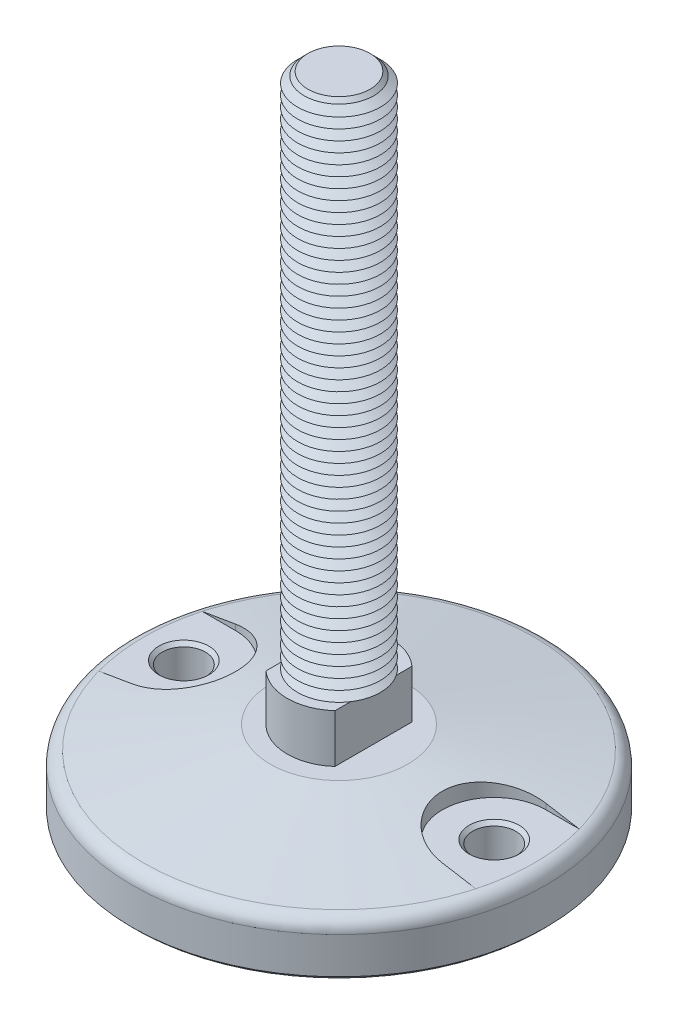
ISO-10303-21;
HEADER;
FILE_DESCRIPTION(('STEP AP214'),'2;1');
FILE_NAME('part.step','',(''),(''),'','','');
FILE_SCHEMA(('AUTOMOTIVE_DESIGN { 1 0 10303 214 1 1 1 1 }'));
ENDSEC;
DATA;
#1=APPLICATION_CONTEXT('core data for automotive mechanical design processes');
#2=APPLICATION_PROTOCOL_DEFINITION('international standard','automotive_design',2000,#1);
#3=PRODUCT_CONTEXT('',#1,'mechanical');
#4=PRODUCT('Part','Part','',(#3));
#5=PRODUCT_RELATED_PRODUCT_CATEGORY('part','',(#4));
#6=PRODUCT_DEFINITION_FORMATION('','',#4);
#7=PRODUCT_DEFINITION_CONTEXT('part definition',#1,'design');
#8=PRODUCT_DEFINITION('design','',#6,#7);
#9=PRODUCT_DEFINITION_SHAPE('','',#8);
#10=(LENGTH_UNIT() NAMED_UNIT(*) SI_UNIT(.MILLI.,.METRE.));
#11=(NAMED_UNIT(*) PLANE_ANGLE_UNIT() SI_UNIT($,.RADIAN.));
#12=(NAMED_UNIT(*) SI_UNIT($,.STERADIAN.) SOLID_ANGLE_UNIT());
#13=UNCERTAINTY_MEASURE_WITH_UNIT(LENGTH_MEASURE(1.E-05),#10,'distance_accuracy_value','');
#14=(GEOMETRIC_REPRESENTATION_CONTEXT(3) GLOBAL_UNCERTAINTY_ASSIGNED_CONTEXT((#13)) GLOBAL_UNIT_ASSIGNED_CONTEXT((#10,
#11,#12)) REPRESENTATION_CONTEXT('',''));
#15=CARTESIAN_POINT('',(0.,0.,0.));
#16=DIRECTION('',(0.,0.,1.));
#17=DIRECTION('',(1.,0.,0.));
#18=AXIS2_PLACEMENT_3D('',#15,#16,#17);
#19=CARTESIAN_POINT('',(0.,0.,0.));
#20=DIRECTION('',(0.,-1.,0.));
#21=DIRECTION('',(0.,0.,-1.));
#22=AXIS2_PLACEMENT_3D('',#19,#20,#21);
#23=CONICAL_SURFACE('',#22,20.,1.39626340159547);
#24=CARTESIAN_POINT('',(-45.0002,-4.83741692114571,14.9999999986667));
#25=CARTESIAN_POINT('',(-44.5716630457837,-4.76573974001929,15.00004953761));
#26=CARTESIAN_POINT('',(-44.1432899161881,-4.69315382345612,14.9816490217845));
#27=CARTESIAN_POINT('',(-43.2899455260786,-4.54659214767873,14.9083446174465));
#28=CARTESIAN_POINT('',(-42.8649740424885,-4.47261648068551,14.8534431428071));
#29=CARTESIAN_POINT('',(-42.0217138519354,-4.32373997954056,14.7075791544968));
#30=CARTESIAN_POINT('',(-41.6034211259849,-4.24883975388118,14.6166392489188));
#31=CARTESIAN_POINT('',(-40.7762181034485,-4.09853953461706,14.3993925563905));
#32=CARTESIAN_POINT('',(-40.367307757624,-4.02313954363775,14.2730859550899));
#33=CARTESIAN_POINT('',(-39.5616137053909,-3.87232244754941,13.9859546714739));
#34=CARTESIAN_POINT('',(-39.1648346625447,-3.79690534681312,13.82511690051));
#35=CARTESIAN_POINT('',(-38.3863815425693,-3.64664451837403,13.4700801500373));
#36=CARTESIAN_POINT('',(-38.0047074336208,-3.57180078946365,13.2758812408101));
#37=CARTESIAN_POINT('',(-37.259234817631,-3.42331263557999,12.8554907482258));
#38=CARTESIAN_POINT('',(-36.8954336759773,-3.3496680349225,12.6293038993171));
#39=CARTESIAN_POINT('',(-36.188253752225,-3.20423999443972,12.1464578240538));
#40=CARTESIAN_POINT('',(-35.8448748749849,-3.13245654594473,11.8897987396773));
#41=CARTESIAN_POINT('',(-35.1811599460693,-2.99151324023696,11.347857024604));
#42=CARTESIAN_POINT('',(-34.8608145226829,-2.92235232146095,11.0625861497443));
#43=CARTESIAN_POINT('',(-34.2453649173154,-2.78741726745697,10.4652623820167));
#44=CARTESIAN_POINT('',(-33.9502608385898,-2.72164314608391,10.1532093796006));
#45=CARTESIAN_POINT('',(-33.3874760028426,-2.59432642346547,9.50440564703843));
#46=CARTESIAN_POINT('',(-33.1197986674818,-2.53278435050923,9.1676518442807));
#47=CARTESIAN_POINT('',(-32.6139762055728,-2.41484175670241,8.47180160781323));
#48=CARTESIAN_POINT('',(-32.3758306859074,-2.35844116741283,8.11270547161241));
#49=CARTESIAN_POINT('',(-31.9339537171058,-2.25242768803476,7.3796428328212));
#50=CARTESIAN_POINT('',(-31.7298031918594,-2.20273384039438,7.00594067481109));
#51=CARTESIAN_POINT('',(-31.3537289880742,-2.11014777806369,6.24184253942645));
#52=CARTESIAN_POINT('',(-31.1818051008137,-2.0672555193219,5.851446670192));
#53=CARTESIAN_POINT('',(-30.8716543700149,-1.98913642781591,5.05684707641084));
#54=CARTESIAN_POINT('',(-30.7334198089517,-1.95390783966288,4.65264653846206));
#55=CARTESIAN_POINT('',(-30.4917961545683,-1.89187314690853,3.8333303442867));
#56=CARTESIAN_POINT('',(-30.3884062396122,-1.86506684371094,3.41821494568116));
#57=CARTESIAN_POINT('',(-30.2197121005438,-1.82110989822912,2.59156261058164));
#58=CARTESIAN_POINT('',(-30.1534519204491,-1.80371733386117,2.18023342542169));
#59=CARTESIAN_POINT('',(-30.0553621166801,-1.77790819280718,1.35321233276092));
#60=CARTESIAN_POINT('',(-30.0235318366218,-1.76949144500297,0.937520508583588));
#61=CARTESIAN_POINT('',(-29.9945838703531,-1.76183851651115,0.104887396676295));
#62=CARTESIAN_POINT('',(-29.9974627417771,-1.76260142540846,-0.31205376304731));
#63=CARTESIAN_POINT('',(-30.0378993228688,-1.7732869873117,-1.14413077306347));
#64=CARTESIAN_POINT('',(-30.0754567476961,-1.7832095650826,-1.55926663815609));
#65=CARTESIAN_POINT('',(-30.1838290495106,-1.81168784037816,-2.37646539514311));
#66=CARTESIAN_POINT('',(-30.253968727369,-1.83006819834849,-2.77862418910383));
#67=CARTESIAN_POINT('',(-30.4266561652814,-1.87498416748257,-3.57544878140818));
#68=CARTESIAN_POINT('',(-30.5292034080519,-1.90151964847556,-3.97011469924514));
#69=CARTESIAN_POINT('',(-30.7658801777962,-1.96218463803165,-4.74927597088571));
#70=CARTESIAN_POINT('',(-30.9000112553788,-1.99631451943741,-5.13377082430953));
#71=CARTESIAN_POINT('',(-31.1988010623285,-2.0714948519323,-5.8900091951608));
#72=CARTESIAN_POINT('',(-31.3634602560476,-2.11254540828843,-6.26175251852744));
#73=CARTESIAN_POINT('',(-31.7241833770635,-2.20134838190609,-6.99438182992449));
#74=CARTESIAN_POINT('',(-31.9205960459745,-2.24917439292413,-7.35508715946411));
#75=CARTESIAN_POINT('',(-32.3419301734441,-2.35035157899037,-8.0586224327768));
#76=CARTESIAN_POINT('',(-32.5668517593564,-2.40370277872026,-8.40145229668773));
#77=CARTESIAN_POINT('',(-33.0435892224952,-2.51513098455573,-9.06707399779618));
#78=CARTESIAN_POINT('',(-33.2954062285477,-2.57320818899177,-9.38986499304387));
#79=CARTESIAN_POINT('',(-33.8241636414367,-2.69330733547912,-10.0133800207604));
#80=CARTESIAN_POINT('',(-34.1011044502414,-2.7553293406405,-10.314103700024));
#81=CARTESIAN_POINT('',(-34.6862220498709,-2.88434050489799,-10.8996326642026));
#82=CARTESIAN_POINT('',(-34.9950517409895,-2.95141968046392,-11.1837659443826));
#83=CARTESIAN_POINT('',(-35.6350756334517,-3.08820736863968,-11.7249231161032));
#84=CARTESIAN_POINT('',(-35.9662703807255,-3.15791594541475,-11.981946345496));
#85=CARTESIAN_POINT('',(-36.6488620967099,-3.29929251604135,-12.4673150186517));
#86=CARTESIAN_POINT('',(-37.0002673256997,-3.37096130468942,-12.695648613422));
#87=CARTESIAN_POINT('',(-37.7207317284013,-3.51558573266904,-13.1220222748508));
#88=CARTESIAN_POINT('',(-38.0897905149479,-3.58854134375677,-13.3200630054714));
#89=CARTESIAN_POINT('',(-38.8503500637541,-3.73657205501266,-13.6880864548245));
#90=CARTESIAN_POINT('',(-39.2421468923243,-3.81166085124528,-13.8574521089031));
#91=CARTESIAN_POINT('',(-40.0387180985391,-3.9619955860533,-14.1621864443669));
#92=CARTESIAN_POINT('',(-40.4434925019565,-4.03724152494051,-14.2975550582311));
#93=CARTESIAN_POINT('',(-41.2626403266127,-4.18727395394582,-14.5331883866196));
#94=CARTESIAN_POINT('',(-41.6770011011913,-4.26206090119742,-14.6334968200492));
#95=CARTESIAN_POINT('',(-42.5127363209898,-4.41076799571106,-14.7984730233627));
#96=CARTESIAN_POINT('',(-42.9341072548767,-4.48468854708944,-14.86315811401));
#97=CARTESIAN_POINT('',(-43.6303300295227,-4.60517722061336,-14.9398587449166));
#98=CARTESIAN_POINT('',(-43.9039978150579,-4.65212396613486,-14.9624242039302));
#99=CARTESIAN_POINT('',(-44.4518138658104,-4.74530664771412,-14.992485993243));
#100=CARTESIAN_POINT('',(-44.725960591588,-4.79154362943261,-15.0000071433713));
#101=CARTESIAN_POINT('',(-45.0002,-4.83741692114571,-14.9999999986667));
#102=B_SPLINE_CURVE_WITH_KNOTS('',3,(#24,#25,#26,#27,#28,#29,#30,#31,#32,#33,#34,#35,#36,#37,
#38,#39,#40,#41,#42,#43,#44,#45,#46,#47,#48,#49,#50,#51,#52,#53,#54,#55,#56,#57,#58,#59,#60,#61,
#62,#63,#64,#65,#66,#67,#68,#69,#70,#71,#72,#73,#74,#75,#76,#77,#78,#79,#80,#81,#82,#83,#84,#85,
#86,#87,#88,#89,#90,#91,#92,#93,#94,#95,#96,#97,#98,#99,#100,#101),.UNSPECIFIED.,.F.,.F.,(4,2,2,
2,2,2,2,2,2,2,2,2,2,2,2,2,2,2,2,2,2,2,2,2,2,2,2,2,2,2,2,2,2,2,2,2,2,2,4),(0.,1.30306238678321,
2.60603860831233,3.9081987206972,5.21035199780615,6.51299971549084,7.81564468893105,
9.11809706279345,10.4205433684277,11.7224567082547,13.0243753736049,14.3264562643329,
15.6285198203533,16.9131037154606,18.1976792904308,19.4819603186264,20.7662110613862,
22.0156679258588,23.2651009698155,24.514410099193,25.7637089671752,26.9882006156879,
28.212672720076,29.4372049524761,30.6617558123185,31.9008050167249,33.1398597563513,
34.3789665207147,35.6180931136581,36.8915557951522,38.1650495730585,39.4390675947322,
40.7130576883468,42.0116991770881,43.3103432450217,44.6073621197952,45.9037498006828,
46.7391139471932,47.5730987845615),.UNSPECIFIED.);
#103=CARTESIAN_POINT('',(-45.,-4.8373834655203,15.));
#104=VERTEX_POINT('',#103);
#105=CARTESIAN_POINT('',(-45.,-4.8373834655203,-15.));
#106=VERTEX_POINT('',#105);
#107=EDGE_CURVE('E679',#104,#106,#102,.T.);
#108=ORIENTED_EDGE('',*,*,#107,.F.);
#109=CARTESIAN_POINT('',(-75.3836954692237,-10.0262296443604,15.));
#110=CARTESIAN_POINT('',(-73.5381209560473,-9.70707583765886,15.));
#111=CARTESIAN_POINT('',(-71.6924756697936,-9.3883303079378,15.));
#112=CARTESIAN_POINT('',(-68.000998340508,-8.75192554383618,15.));
#113=CARTESIAN_POINT('',(-66.1551662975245,-8.43426630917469,15.));
#114=CARTESIAN_POINT('',(-62.4632858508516,-7.80030655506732,15.));
#115=CARTESIAN_POINT('',(-60.6172374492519,-7.484006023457,15.));
#116=CARTESIAN_POINT('',(-56.9248399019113,-6.85315810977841,15.));
#117=CARTESIAN_POINT('',(-55.078490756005,-6.53861072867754,15.));
#118=CARTESIAN_POINT('',(-51.3853818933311,-5.91182468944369,15.));
#119=CARTESIAN_POINT('',(-49.538622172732,-5.59958605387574,15.));
#120=CARTESIAN_POINT('',(-45.8445795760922,-4.97822990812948,15.));
#121=CARTESIAN_POINT('',(-43.9972967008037,-4.66911239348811,15.));
#122=CARTESIAN_POINT('',(-41.2258181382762,-4.20871611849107,15.));
#123=CARTESIAN_POINT('',(-40.3018950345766,-4.05579661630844,15.));
#124=CARTESIAN_POINT('',(-38.4538315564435,-3.75127801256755,15.));
#125=CARTESIAN_POINT('',(-37.5296911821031,-3.59967891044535,15.));
#126=CARTESIAN_POINT('',(-35.6811466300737,-3.29806807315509,15.));
#127=CARTESIAN_POINT('',(-34.7567424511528,-3.14805634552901,15.));
#128=CARTESIAN_POINT('',(-32.9076160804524,-2.84999796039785,15.));
#129=CARTESIAN_POINT('',(-31.9828938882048,-2.70195130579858,15.));
#130=CARTESIAN_POINT('',(-31.05798475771,-2.55507589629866,15.));
#131=B_SPLINE_CURVE_WITH_KNOTS('',3,(#109,#110,#111,#112,#113,#114,#115,#116,#117,#118,#119,
#120,#121,#122,#123,#124,#125,#126,#127,#128,#129,#130),.UNSPECIFIED.,.F.,.F.,(4,2,2,2,2,2,2,2,
2,2,4),(0.,5.6189004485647,11.2377994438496,16.8566480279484,22.4754997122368,28.0944062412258,
33.7133047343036,36.5227815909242,39.3322572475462,42.1417462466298,44.9512393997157),.UNSPECIFIED.);
#132=CARTESIAN_POINT('',(-54.6728284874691,-6.47,15.));
#133=VERTEX_POINT('',#132);
#134=EDGE_CURVE('E653',#133,#104,#131,.T.);
#135=ORIENTED_EDGE('',*,*,#134,.F.);
#136=CARTESIAN_POINT('',(0.,-6.47,0.));
#137=DIRECTION('',(0.,1.,0.));
#138=DIRECTION('',(0.,0.,1.));
#139=AXIS2_PLACEMENT_3D('',#136,#137,#138);
#140=CIRCLE('',#139,56.693193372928);
#141=CARTESIAN_POINT('',(-54.6728284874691,-6.47,-15.));
#142=VERTEX_POINT('',#141);
#143=EDGE_CURVE('E637',#133,#142,#140,.F.);
#144=ORIENTED_EDGE('',*,*,#143,.T.);
#145=CARTESIAN_POINT('',(-31.05798475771,-2.55507589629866,-15.));
#146=CARTESIAN_POINT('',(-31.9828938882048,-2.70195130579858,-15.));
#147=CARTESIAN_POINT('',(-32.9076160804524,-2.84999796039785,-15.));
#148=CARTESIAN_POINT('',(-34.7567424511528,-3.14805634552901,-15.));
#149=CARTESIAN_POINT('',(-35.6811466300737,-3.29806807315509,-15.));
#150=CARTESIAN_POINT('',(-37.5296911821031,-3.59967891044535,-15.));
#151=CARTESIAN_POINT('',(-38.4538315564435,-3.75127801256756,-15.));
#152=CARTESIAN_POINT('',(-40.3018950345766,-4.05579661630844,-15.));
#153=CARTESIAN_POINT('',(-41.2258181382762,-4.20871611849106,-15.));
#154=CARTESIAN_POINT('',(-43.9972967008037,-4.66911239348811,-15.));
#155=CARTESIAN_POINT('',(-45.8445795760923,-4.97822990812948,-15.));
#156=CARTESIAN_POINT('',(-49.538622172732,-5.59958605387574,-15.));
#157=CARTESIAN_POINT('',(-51.3853818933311,-5.91182468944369,-15.));
#158=CARTESIAN_POINT('',(-55.078490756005,-6.53861072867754,-15.));
#159=CARTESIAN_POINT('',(-56.9248399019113,-6.85315810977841,-15.));
#160=CARTESIAN_POINT('',(-60.6172374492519,-7.48400602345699,-15.));
#161=CARTESIAN_POINT('',(-62.4632858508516,-7.80030655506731,-15.));
#162=CARTESIAN_POINT('',(-66.1551662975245,-8.43426630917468,-15.));
#163=CARTESIAN_POINT('',(-68.000998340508,-8.75192554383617,-15.));
#164=CARTESIAN_POINT('',(-71.6924756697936,-9.3883303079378,-15.));
#165=CARTESIAN_POINT('',(-73.5381209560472,-9.70707583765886,-15.));
#166=CARTESIAN_POINT('',(-75.3836954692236,-10.0262296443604,-15.));
#167=B_SPLINE_CURVE_WITH_KNOTS('',3,(#145,#146,#147,#148,#149,#150,#151,#152,#153,#154,#155,
#156,#157,#158,#159,#160,#161,#162,#163,#164,#165,#166),.UNSPECIFIED.,.F.,.F.,(4,2,2,2,2,2,2,2,
2,2,4),(0.,2.80949315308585,5.61898215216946,8.42845780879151,11.2379346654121,16.8568331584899,
22.4757396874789,28.0945913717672,33.713439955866,39.3323389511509,44.9512393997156),.UNSPECIFIED.);
#168=EDGE_CURVE('E645',#106,#142,#167,.T.);
#169=ORIENTED_EDGE('',*,*,#168,.F.);
#170=EDGE_LOOP('',(#108,#135,#144,#169));
#171=FACE_BOUND('',#170,.T.);
#172=CARTESIAN_POINT('',(0.,-6.47024674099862,0.));
#173=DIRECTION('',(0.,1.,0.));
#174=DIRECTION('',(0.,0.,1.));
#175=AXIS2_PLACEMENT_3D('',#172,#173,#174);
#176=CIRCLE('',#175,56.6945927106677);
#177=CARTESIAN_POINT('',(0.,-6.47024674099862,56.6945927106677));
#178=VERTEX_POINT('',#177);
#179=EDGE_CURVE('E626',#178,#178,#176,.T.);
#180=ORIENTED_EDGE('',*,*,#179,.T.);
#181=EDGE_LOOP('',(#180));
#182=FACE_BOUND('',#181,.T.);
#183=CARTESIAN_POINT('',(0.,0.,0.));
#184=DIRECTION('',(0.,1.,0.));
#185=DIRECTION('',(0.,0.,1.));
#186=AXIS2_PLACEMENT_3D('',#183,#184,#185);
#187=CIRCLE('',#186,20.);
#188=CARTESIAN_POINT('',(0.,0.,20.));
#189=VERTEX_POINT('',#188);
#190=EDGE_CURVE('E622',#189,#189,#187,.T.);
#191=ORIENTED_EDGE('',*,*,#190,.F.);
#192=EDGE_LOOP('',(#191));
#193=FACE_BOUND('',#192,.T.);
#194=CARTESIAN_POINT('',(68.3349761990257,-8.80963289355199,15.));
#195=CARTESIAN_POINT('',(66.4891647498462,-8.49175738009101,15.));
#196=CARTESIAN_POINT('',(64.6432610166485,-8.17441571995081,15.));
#197=CARTESIAN_POINT('',(60.9512028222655,-7.54120691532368,15.));
#198=CARTESIAN_POINT('',(59.1050483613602,-7.22533976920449,15.));
#199=CARTESIAN_POINT('',(55.4124579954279,-6.59549283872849,15.));
#200=CARTESIAN_POINT('',(53.5660220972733,-6.28151301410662,15.));
#201=CARTESIAN_POINT('',(49.8727228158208,-5.65605601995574,15.));
#202=CARTESIAN_POINT('',(48.0258594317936,-5.34457885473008,15.));
#203=CARTESIAN_POINT('',(44.3315117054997,-4.72503003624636,15.));
#204=CARTESIAN_POINT('',(42.4840273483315,-4.41695847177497,15.));
#205=CARTESIAN_POINT('',(38.7882718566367,-3.80560595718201,15.));
#206=CARTESIAN_POINT('',(36.9400007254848,-3.50232498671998,15.));
#207=CARTESIAN_POINT('',(34.1667136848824,-3.0526868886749,15.));
#208=CARTESIAN_POINT('',(33.2421265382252,-2.90368627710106,15.));
#209=CARTESIAN_POINT('',(31.3926029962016,-2.60787530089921,15.));
#210=CARTESIAN_POINT('',(30.4676666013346,-2.46106493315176,15.));
#211=CARTESIAN_POINT('',(28.617354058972,-2.17014916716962,15.));
#212=CARTESIAN_POINT('',(27.6919779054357,-2.02604380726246,15.));
#213=CARTESIAN_POINT('',(25.8406879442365,-1.74130150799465,15.));
#214=CARTESIAN_POINT('',(24.9147741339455,-1.60066458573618,15.));
#215=CARTESIAN_POINT('',(23.9885405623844,-1.46214325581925,15.));
#216=B_SPLINE_CURVE_WITH_KNOTS('',3,(#194,#195,#196,#197,#198,#199,#200,#201,#202,#203,#204,
#205,#206,#207,#208,#209,#210,#211,#212,#213,#214,#215),.UNSPECIFIED.,.F.,.F.,(4,2,2,2,2,2,2,2,
2,2,4),(0.,5.61894898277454,11.2378917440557,16.856714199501,22.4755463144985,28.0945245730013,
33.7134789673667,36.5230254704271,39.3325679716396,42.1421502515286,44.9517463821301),.UNSPECIFIED.);
#217=CARTESIAN_POINT('',(54.6728284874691,-6.47,15.));
#218=VERTEX_POINT('',#217);
#219=CARTESIAN_POINT('',(45.,-4.8373834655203,15.));
#220=VERTEX_POINT('',#219);
#221=EDGE_CURVE('E133',#218,#220,#216,.T.);
#222=ORIENTED_EDGE('',*,*,#221,.T.);
#223=CARTESIAN_POINT('',(45.0002,-4.83741692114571,14.9999999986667));
#224=CARTESIAN_POINT('',(44.5716630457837,-4.76573974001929,15.00004953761));
#225=CARTESIAN_POINT('',(44.1432899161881,-4.69315382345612,14.9816490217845));
#226=CARTESIAN_POINT('',(43.2899455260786,-4.54659214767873,14.9083446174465));
#227=CARTESIAN_POINT('',(42.8649740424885,-4.47261648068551,14.8534431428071));
#228=CARTESIAN_POINT('',(42.0217138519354,-4.32373997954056,14.7075791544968));
#229=CARTESIAN_POINT('',(41.6034211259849,-4.24883975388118,14.6166392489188));
#230=CARTESIAN_POINT('',(40.7762181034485,-4.09853953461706,14.3993925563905));
#231=CARTESIAN_POINT('',(40.367307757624,-4.02313954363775,14.2730859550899));
#232=CARTESIAN_POINT('',(39.5616137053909,-3.87232244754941,13.9859546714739));
#233=CARTESIAN_POINT('',(39.1648346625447,-3.79690534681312,13.82511690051));
#234=CARTESIAN_POINT('',(38.3863815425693,-3.64664451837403,13.4700801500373));
#235=CARTESIAN_POINT('',(38.0047074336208,-3.57180078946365,13.2758812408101));
#236=CARTESIAN_POINT('',(37.259234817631,-3.42331263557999,12.8554907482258));
#237=CARTESIAN_POINT('',(36.8954336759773,-3.3496680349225,12.6293038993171));
#238=CARTESIAN_POINT('',(36.188253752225,-3.20423999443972,12.1464578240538));
#239=CARTESIAN_POINT('',(35.8448748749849,-3.13245654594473,11.8897987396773));
#240=CARTESIAN_POINT('',(35.1811599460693,-2.99151324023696,11.347857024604));
#241=CARTESIAN_POINT('',(34.8608145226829,-2.92235232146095,11.0625861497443));
#242=CARTESIAN_POINT('',(34.2453649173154,-2.78741726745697,10.4652623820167));
#243=CARTESIAN_POINT('',(33.9502608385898,-2.72164314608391,10.1532093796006));
#244=CARTESIAN_POINT('',(33.3874760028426,-2.59432642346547,9.50440564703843));
#245=CARTESIAN_POINT('',(33.1197986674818,-2.53278435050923,9.1676518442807));
#246=CARTESIAN_POINT('',(32.6139762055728,-2.41484175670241,8.47180160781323));
#247=CARTESIAN_POINT('',(32.3758306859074,-2.35844116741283,8.11270547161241));
#248=CARTESIAN_POINT('',(31.9339537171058,-2.25242768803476,7.3796428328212));
#249=CARTESIAN_POINT('',(31.7298031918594,-2.20273384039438,7.00594067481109));
#250=CARTESIAN_POINT('',(31.3537289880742,-2.11014777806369,6.24184253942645));
#251=CARTESIAN_POINT('',(31.1818051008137,-2.0672555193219,5.851446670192));
#252=CARTESIAN_POINT('',(30.8716543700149,-1.98913642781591,5.05684707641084));
#253=CARTESIAN_POINT('',(30.7334198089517,-1.95390783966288,4.65264653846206));
#254=CARTESIAN_POINT('',(30.4917961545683,-1.89187314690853,3.8333303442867));
#255=CARTESIAN_POINT('',(30.3884062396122,-1.86506684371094,3.41821494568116));
#256=CARTESIAN_POINT('',(30.2197121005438,-1.82110989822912,2.59156261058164));
#257=CARTESIAN_POINT('',(30.1534519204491,-1.80371733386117,2.18023342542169));
#258=CARTESIAN_POINT('',(30.0553621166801,-1.77790819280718,1.35321233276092));
#259=CARTESIAN_POINT('',(30.0235318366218,-1.76949144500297,0.937520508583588));
#260=CARTESIAN_POINT('',(29.9945838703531,-1.76183851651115,0.104887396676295));
#261=CARTESIAN_POINT('',(29.9974627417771,-1.76260142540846,-0.31205376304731));
#262=CARTESIAN_POINT('',(30.0378993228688,-1.7732869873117,-1.14413077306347));
#263=CARTESIAN_POINT('',(30.0754567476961,-1.7832095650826,-1.55926663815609));
#264=CARTESIAN_POINT('',(30.1838290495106,-1.81168784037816,-2.37646539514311));
#265=CARTESIAN_POINT('',(30.253968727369,-1.83006819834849,-2.77862418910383));
#266=CARTESIAN_POINT('',(30.4266561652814,-1.87498416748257,-3.57544878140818));
#267=CARTESIAN_POINT('',(30.5292034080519,-1.90151964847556,-3.97011469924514));
#268=CARTESIAN_POINT('',(30.7658801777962,-1.96218463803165,-4.74927597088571));
#269=CARTESIAN_POINT('',(30.9000112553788,-1.99631451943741,-5.13377082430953));
#270=CARTESIAN_POINT('',(31.1988010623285,-2.0714948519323,-5.8900091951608));
#271=CARTESIAN_POINT('',(31.3634602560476,-2.11254540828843,-6.26175251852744));
#272=CARTESIAN_POINT('',(31.7241833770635,-2.20134838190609,-6.99438182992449));
#273=CARTESIAN_POINT('',(31.9205960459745,-2.24917439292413,-7.35508715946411));
#274=CARTESIAN_POINT('',(32.3419301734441,-2.35035157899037,-8.0586224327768));
#275=CARTESIAN_POINT('',(32.5668517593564,-2.40370277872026,-8.40145229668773));
#276=CARTESIAN_POINT('',(33.0435892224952,-2.51513098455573,-9.06707399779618));
#277=CARTESIAN_POINT('',(33.2954062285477,-2.57320818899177,-9.38986499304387));
#278=CARTESIAN_POINT('',(33.8241636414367,-2.69330733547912,-10.0133800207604));
#279=CARTESIAN_POINT('',(34.1011044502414,-2.7553293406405,-10.314103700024));
#280=CARTESIAN_POINT('',(34.6862220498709,-2.88434050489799,-10.8996326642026));
#281=CARTESIAN_POINT('',(34.9950517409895,-2.95141968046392,-11.1837659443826));
#282=CARTESIAN_POINT('',(35.6350756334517,-3.08820736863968,-11.7249231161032));
#283=CARTESIAN_POINT('',(35.9662703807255,-3.15791594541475,-11.981946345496));
#284=CARTESIAN_POINT('',(36.6488620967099,-3.29929251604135,-12.4673150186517));
#285=CARTESIAN_POINT('',(37.0002673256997,-3.37096130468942,-12.695648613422));
#286=CARTESIAN_POINT('',(37.7207317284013,-3.51558573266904,-13.1220222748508));
#287=CARTESIAN_POINT('',(38.0897905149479,-3.58854134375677,-13.3200630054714));
#288=CARTESIAN_POINT('',(38.8503500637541,-3.73657205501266,-13.6880864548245));
#289=CARTESIAN_POINT('',(39.2421468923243,-3.81166085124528,-13.8574521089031));
#290=CARTESIAN_POINT('',(40.0387180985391,-3.9619955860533,-14.1621864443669));
#291=CARTESIAN_POINT('',(40.4434925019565,-4.03724152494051,-14.2975550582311));
#292=CARTESIAN_POINT('',(41.2626403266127,-4.18727395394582,-14.5331883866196));
#293=CARTESIAN_POINT('',(41.6770011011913,-4.26206090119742,-14.6334968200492));
#294=CARTESIAN_POINT('',(42.5127363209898,-4.41076799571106,-14.7984730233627));
#295=CARTESIAN_POINT('',(42.9341072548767,-4.48468854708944,-14.86315811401));
#296=CARTESIAN_POINT('',(43.6303300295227,-4.60517722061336,-14.9398587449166));
#297=CARTESIAN_POINT('',(43.9039978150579,-4.65212396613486,-14.9624242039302));
#298=CARTESIAN_POINT('',(44.4518138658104,-4.74530664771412,-14.992485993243));
#299=CARTESIAN_POINT('',(44.725960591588,-4.79154362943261,-15.0000071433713));
#300=CARTESIAN_POINT('',(45.0002,-4.83741692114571,-14.9999999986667));
#301=B_SPLINE_CURVE_WITH_KNOTS('',3,(#223,#224,#225,#226,#227,#228,#229,#230,#231,#232,#233,
#234,#235,#236,#237,#238,#239,#240,#241,#242,#243,#244,#245,#246,#247,#248,#249,#250,#251,#252,
#253,#254,#255,#256,#257,#258,#259,#260,#261,#262,#263,#264,#265,#266,#267,#268,#269,#270,#271,
#272,#273,#274,#275,#276,#277,#278,#279,#280,#281,#282,#283,#284,#285,#286,#287,#288,#289,#290,
#291,#292,#293,#294,#295,#296,#297,#298,#299,#300),.UNSPECIFIED.,.F.,.F.,(4,2,2,2,2,2,2,2,2,2,2,
2,2,2,2,2,2,2,2,2,2,2,2,2,2,2,2,2,2,2,2,2,2,2,2,2,2,2,4),(0.,1.30306238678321,2.60603860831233,
3.9081987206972,5.21035199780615,6.51299971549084,7.81564468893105,9.11809706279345,
10.4205433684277,11.7224567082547,13.0243753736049,14.3264562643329,15.6285198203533,
16.9131037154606,18.1976792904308,19.4819603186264,20.7662110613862,22.0156679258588,
23.2651009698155,24.514410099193,25.7637089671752,26.9882006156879,28.212672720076,
29.4372049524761,30.6617558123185,31.9008050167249,33.1398597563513,34.3789665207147,
35.6180931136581,36.8915557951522,38.1650495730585,39.4390675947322,40.7130576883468,
42.0116991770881,43.3103432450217,44.6073621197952,45.9037498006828,46.7391139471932,
47.5730987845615),.UNSPECIFIED.);
#302=CARTESIAN_POINT('',(45.,-4.8373834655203,-15.));
#303=VERTEX_POINT('',#302);
#304=EDGE_CURVE('E145',#220,#303,#301,.T.);
#305=ORIENTED_EDGE('',*,*,#304,.T.);
#306=CARTESIAN_POINT('',(23.9885405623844,-1.46214325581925,-15.));
#307=CARTESIAN_POINT('',(24.9147741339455,-1.60066458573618,-15.));
#308=CARTESIAN_POINT('',(25.8406879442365,-1.74130150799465,-15.));
#309=CARTESIAN_POINT('',(27.6919779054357,-2.02604380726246,-15.));
#310=CARTESIAN_POINT('',(28.617354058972,-2.17014916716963,-15.));
#311=CARTESIAN_POINT('',(30.4676666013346,-2.46106493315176,-15.));
#312=CARTESIAN_POINT('',(31.3926029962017,-2.60787530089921,-15.));
#313=CARTESIAN_POINT('',(33.2421265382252,-2.90368627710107,-15.));
#314=CARTESIAN_POINT('',(34.1667136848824,-3.0526868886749,-15.));
#315=CARTESIAN_POINT('',(36.9400007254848,-3.50232498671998,-15.));
#316=CARTESIAN_POINT('',(38.7882718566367,-3.80560595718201,-15.));
#317=CARTESIAN_POINT('',(42.4840273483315,-4.41695847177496,-15.));
#318=CARTESIAN_POINT('',(44.3315117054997,-4.72503003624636,-15.));
#319=CARTESIAN_POINT('',(48.0258594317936,-5.34457885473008,-15.));
#320=CARTESIAN_POINT('',(49.8727228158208,-5.65605601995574,-15.));
#321=CARTESIAN_POINT('',(53.5660220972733,-6.28151301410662,-15.));
#322=CARTESIAN_POINT('',(55.4124579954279,-6.59549283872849,-15.));
#323=CARTESIAN_POINT('',(59.1050483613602,-7.22533976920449,-15.));
#324=CARTESIAN_POINT('',(60.9512028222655,-7.54120691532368,-15.));
#325=CARTESIAN_POINT('',(64.6432610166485,-8.17441571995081,-15.));
#326=CARTESIAN_POINT('',(66.4891647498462,-8.49175738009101,-15.));
#327=CARTESIAN_POINT('',(68.3349761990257,-8.80963289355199,-15.));
#328=B_SPLINE_CURVE_WITH_KNOTS('',3,(#306,#307,#308,#309,#310,#311,#312,#313,#314,#315,#316,
#317,#318,#319,#320,#321,#322,#323,#324,#325,#326,#327),.UNSPECIFIED.,.F.,.F.,(4,2,2,2,2,2,2,2,
2,2,4),(0.,2.80959613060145,5.61917841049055,8.42872091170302,11.2382674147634,16.8572218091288,
22.4762000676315,28.0950321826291,33.7138546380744,39.3327973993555,44.9517463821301),.UNSPECIFIED.);
#329=CARTESIAN_POINT('',(54.6728284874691,-6.47,-15.));
#330=VERTEX_POINT('',#329);
#331=EDGE_CURVE('E709',#303,#330,#328,.T.);
#332=ORIENTED_EDGE('',*,*,#331,.T.);
#333=CARTESIAN_POINT('',(0.,-6.47,0.));
#334=DIRECTION('',(0.,1.,0.));
#335=DIRECTION('',(0.,0.,1.));
#336=AXIS2_PLACEMENT_3D('',#333,#334,#335);
#337=CIRCLE('',#336,56.693193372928);
#338=EDGE_CURVE('E700',#330,#218,#337,.F.);
#339=ORIENTED_EDGE('',*,*,#338,.T.);
#340=EDGE_LOOP('',(#222,#305,#332,#339));
#341=FACE_BOUND('',#340,.T.);
#342=ADVANCED_FACE('F39',(#171,#182,#193,#341),#23,.T.);
#343=CARTESIAN_POINT('',(0.,14.,0.));
#344=DIRECTION('',(0.,1.,0.));
#345=DIRECTION('',(0.,0.,1.));
#346=AXIS2_PLACEMENT_3D('',#343,#344,#345);
#347=PLANE('',#346);
#348=CARTESIAN_POINT('',(0.,14.,0.));
#349=DIRECTION('',(0.,1.,0.));
#350=DIRECTION('',(0.,0.,1.));
#351=AXIS2_PLACEMENT_3D('',#348,#349,#350);
#352=CIRCLE('',#351,12.);
#353=CARTESIAN_POINT('',(10.,14.,-6.6332495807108));
#354=VERTEX_POINT('',#353);
#355=CARTESIAN_POINT('',(-10.,14.,-6.6332495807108));
#356=VERTEX_POINT('',#355);
#357=EDGE_CURVE('E638',#354,#356,#352,.T.);
#358=ORIENTED_EDGE('',*,*,#357,.F.);
#359=DIRECTION('',(0.,0.,1.));
#360=VECTOR('',#359,1.);
#361=CARTESIAN_POINT('',(10.,14.,11.180339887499));
#362=LINE('',#361,#360);
#363=CARTESIAN_POINT('',(10.,14.,-11.1803398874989));
#364=VERTEX_POINT('',#363);
#365=EDGE_CURVE('E601',#364,#354,#362,.T.);
#366=ORIENTED_EDGE('',*,*,#365,.F.);
#367=CARTESIAN_POINT('',(0.,14.,0.));
#368=DIRECTION('',(0.,1.,0.));
#369=DIRECTION('',(0.,0.,1.));
#370=AXIS2_PLACEMENT_3D('',#367,#368,#369);
#371=CIRCLE('',#370,15.);
#372=CARTESIAN_POINT('',(-10.,14.,-11.180339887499));
#373=VERTEX_POINT('',#372);
#374=EDGE_CURVE('E615',#364,#373,#371,.T.);
#375=ORIENTED_EDGE('',*,*,#374,.T.);
#376=DIRECTION('',(0.,0.,-1.));
#377=VECTOR('',#376,1.);
#378=CARTESIAN_POINT('',(-10.,14.,-11.180339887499));
#379=LINE('',#378,#377);
#380=EDGE_CURVE('E589',#356,#373,#379,.T.);
#381=ORIENTED_EDGE('',*,*,#380,.F.);
#382=EDGE_LOOP('',(#358,#366,#375,#381));
#383=FACE_BOUND('',#382,.T.);
#384=ADVANCED_FACE('F763',(#383),#347,.T.);
#385=CARTESIAN_POINT('',(0.,14.,0.));
#386=DIRECTION('',(0.,-1.,0.));
#387=DIRECTION('',(0.,0.,-1.));
#388=AXIS2_PLACEMENT_3D('',#385,#386,#387);
#389=CYLINDRICAL_SURFACE('',#388,15.);
#390=CARTESIAN_POINT('',(-10.,14.,11.1803398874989));
#391=VERTEX_POINT('',#390);
#392=CARTESIAN_POINT('',(10.,14.,11.180339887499));
#393=VERTEX_POINT('',#392);
#394=EDGE_CURVE('E594',#391,#393,#371,.T.);
#395=ORIENTED_EDGE('',*,*,#394,.F.);
#396=DIRECTION('',(0.,1.,0.));
#397=VECTOR('',#396,1.);
#398=CARTESIAN_POINT('',(-10.,0.,11.180339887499));
#399=LINE('',#398,#397);
#400=CARTESIAN_POINT('',(-10.,0.,11.180339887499));
#401=VERTEX_POINT('',#400);
#402=EDGE_CURVE('E583',#401,#391,#399,.T.);
#403=ORIENTED_EDGE('',*,*,#402,.F.);
#404=CARTESIAN_POINT('',(0.,0.,0.));
#405=DIRECTION('',(0.,1.,0.));
#406=DIRECTION('',(0.,0.,1.));
#407=AXIS2_PLACEMENT_3D('',#404,#405,#406);
#408=CIRCLE('',#407,15.);
#409=CARTESIAN_POINT('',(10.,0.,11.180339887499));
#410=VERTEX_POINT('',#409);
#411=EDGE_CURVE('E616',#401,#410,#408,.T.);
#412=ORIENTED_EDGE('',*,*,#411,.T.);
#413=DIRECTION('',(0.,1.,0.));
#414=VECTOR('',#413,1.);
#415=CARTESIAN_POINT('',(10.,0.,11.180339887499));
#416=LINE('',#415,#414);
#417=EDGE_CURVE('E606',#410,#393,#416,.T.);
#418=ORIENTED_EDGE('',*,*,#417,.T.);
#419=EDGE_LOOP('',(#395,#403,#412,#418));
#420=FACE_BOUND('',#419,.T.);
#421=ADVANCED_FACE('F768',(#420),#389,.T.);
#422=CARTESIAN_POINT('',(0.,0.,0.));
#423=DIRECTION('',(0.,1.,0.));
#424=DIRECTION('',(0.,0.,1.));
#425=AXIS2_PLACEMENT_3D('',#422,#423,#424);
#426=PLANE('',#425);
#427=CARTESIAN_POINT('',(10.,0.,-11.180339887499));
#428=VERTEX_POINT('',#427);
#429=CARTESIAN_POINT('',(-10.,0.,-11.180339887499));
#430=VERTEX_POINT('',#429);
#431=EDGE_CURVE('E620',#428,#430,#408,.T.);
#432=ORIENTED_EDGE('',*,*,#431,.F.);
#433=DIRECTION('',(0.,0.,1.));
#434=VECTOR('',#433,1.);
#435=CARTESIAN_POINT('',(10.,0.,11.180339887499));
#436=LINE('',#435,#434);
#437=EDGE_CURVE('E597',#428,#410,#436,.T.);
#438=ORIENTED_EDGE('',*,*,#437,.T.);
#439=ORIENTED_EDGE('',*,*,#411,.F.);
#440=DIRECTION('',(0.,0.,-1.));
#441=VECTOR('',#440,1.);
#442=CARTESIAN_POINT('',(-10.,0.,-11.180339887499));
#443=LINE('',#442,#441);
#444=EDGE_CURVE('E579',#401,#430,#443,.T.);
#445=ORIENTED_EDGE('',*,*,#444,.T.);
#446=EDGE_LOOP('',(#432,#438,#439,#445));
#447=FACE_BOUND('',#446,.T.);
#448=ORIENTED_EDGE('',*,*,#190,.T.);
#449=EDGE_LOOP('',(#448));
#450=FACE_BOUND('',#449,.T.);
#451=ADVANCED_FACE('F904',(#447,#450),#426,.T.);
#452=CARTESIAN_POINT('',(0.,61.3388655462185,0.));
#453=DIRECTION('',(0.,1.,0.));
#454=DIRECTION('',(0.,0.,1.));
#455=AXIS2_PLACEMENT_3D('',#452,#453,#454);
#456=CYLINDRICAL_SURFACE('',#455,60.);
#457=CARTESIAN_POINT('',(0.,-21.,0.));
#458=DIRECTION('',(0.,-1.,0.));
#459=DIRECTION('',(0.,0.,-1.));
#460=AXIS2_PLACEMENT_3D('',#457,#458,#459);
#461=CIRCLE('',#460,60.);
#462=CARTESIAN_POINT('',(0.,-21.,-60.));
#463=VERTEX_POINT('',#462);
#464=EDGE_CURVE('E48',#463,#463,#461,.F.);
#465=ORIENTED_EDGE('',*,*,#464,.T.);
#466=EDGE_LOOP('',(#465));
#467=FACE_BOUND('',#466,.T.);
#468=CARTESIAN_POINT('',(0.,-10.4094777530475,0.));
#469=DIRECTION('',(0.,-1.,0.));
#470=DIRECTION('',(0.,0.,-1.));
#471=AXIS2_PLACEMENT_3D('',#468,#469,#470);
#472=CIRCLE('',#471,60.);
#473=CARTESIAN_POINT('',(0.,-10.4094777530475,-60.));
#474=VERTEX_POINT('',#473);
#475=EDGE_CURVE('E621',#474,#474,#472,.T.);
#476=ORIENTED_EDGE('',*,*,#475,.T.);
#477=EDGE_LOOP('',(#476));
#478=FACE_BOUND('',#477,.T.);
#479=ADVANCED_FACE('F750',(#467,#478),#456,.T.);
#480=CARTESIAN_POINT('',(0.,-22.,60.));
#481=DIRECTION('',(0.,-1.,0.));
#482=DIRECTION('',(0.,0.,-1.));
#483=AXIS2_PLACEMENT_3D('',#480,#481,#482);
#484=PLANE('',#483);
#485=CARTESIAN_POINT('',(0.,-22.,0.));
#486=DIRECTION('',(0.,-1.,0.));
#487=DIRECTION('',(0.,0.,-1.));
#488=AXIS2_PLACEMENT_3D('',#485,#486,#487);
#489=CIRCLE('',#488,59.);
#490=CARTESIAN_POINT('',(0.,-22.,-59.));
#491=VERTEX_POINT('',#490);
#492=EDGE_CURVE('E11',#491,#491,#489,.T.);
#493=ORIENTED_EDGE('',*,*,#492,.T.);
#494=EDGE_LOOP('',(#493));
#495=FACE_BOUND('',#494,.T.);
#496=CARTESIAN_POINT('',(45.,-22.,0.));
#497=DIRECTION('',(0.,-1.,0.));
#498=DIRECTION('',(0.,0.,-1.));
#499=AXIS2_PLACEMENT_3D('',#496,#497,#498);
#500=CIRCLE('',#499,7.25000000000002);
#501=CARTESIAN_POINT('',(45.,-22.,-7.25000000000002));
#502=VERTEX_POINT('',#501);
#503=EDGE_CURVE('E739',#502,#502,#500,.F.);
#504=ORIENTED_EDGE('',*,*,#503,.T.);
#505=EDGE_LOOP('',(#504));
#506=FACE_BOUND('',#505,.T.);
#507=CARTESIAN_POINT('',(-45.,-22.,0.));
#508=DIRECTION('',(0.,-1.,0.));
#509=DIRECTION('',(0.,0.,-1.));
#510=AXIS2_PLACEMENT_3D('',#507,#508,#509);
#511=CIRCLE('',#510,7.24999999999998);
#512=CARTESIAN_POINT('',(-45.,-22.,-7.24999999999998));
#513=VERTEX_POINT('',#512);
#514=EDGE_CURVE('E685',#513,#513,#511,.F.);
#515=ORIENTED_EDGE('',*,*,#514,.T.);
#516=EDGE_LOOP('',(#515));
#517=FACE_BOUND('',#516,.T.);
#518=ADVANCED_FACE('F888',(#495,#506,#517),#484,.T.);
#519=CARTESIAN_POINT('',(0.,-10.4094777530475,0.));
#520=DIRECTION('',(0.,-1.,0.));
#521=DIRECTION('',(0.,0.,-1.));
#522=AXIS2_PLACEMENT_3D('',#519,#520,#521);
#523=TOROIDAL_SURFACE('',#522,56.,4.);
#524=ORIENTED_EDGE('',*,*,#475,.F.);
#525=EDGE_LOOP('',(#524));
#526=FACE_BOUND('',#525,.T.);
#527=ORIENTED_EDGE('',*,*,#179,.F.);
#528=EDGE_LOOP('',(#527));
#529=FACE_BOUND('',#528,.T.);
#530=ADVANCED_FACE('F893',(#526,#529),#523,.T.);
#531=ORIENTED_EDGE('',*,*,#431,.T.);
#532=DIRECTION('',(0.,1.,0.));
#533=VECTOR('',#532,1.);
#534=CARTESIAN_POINT('',(-10.,0.,-11.180339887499));
#535=LINE('',#534,#533);
#536=EDGE_CURVE('E590',#430,#373,#535,.T.);
#537=ORIENTED_EDGE('',*,*,#536,.T.);
#538=ORIENTED_EDGE('',*,*,#374,.F.);
#539=DIRECTION('',(0.,1.,0.));
#540=VECTOR('',#539,1.);
#541=CARTESIAN_POINT('',(10.,0.,-11.180339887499));
#542=LINE('',#541,#540);
#543=EDGE_CURVE('E600',#428,#364,#542,.T.);
#544=ORIENTED_EDGE('',*,*,#543,.F.);
#545=EDGE_LOOP('',(#531,#537,#538,#544));
#546=FACE_BOUND('',#545,.T.);
#547=ADVANCED_FACE('F815',(#546),#389,.T.);
#548=CARTESIAN_POINT('',(-10.,14.,6.6332495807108));
#549=VERTEX_POINT('',#548);
#550=CARTESIAN_POINT('',(10.,14.,6.6332495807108));
#551=VERTEX_POINT('',#550);
#552=EDGE_CURVE('E578',#549,#551,#352,.T.);
#553=ORIENTED_EDGE('',*,*,#552,.F.);
#554=EDGE_CURVE('E584',#391,#549,#379,.T.);
#555=ORIENTED_EDGE('',*,*,#554,.F.);
#556=ORIENTED_EDGE('',*,*,#394,.T.);
#557=EDGE_CURVE('E577',#551,#393,#362,.T.);
#558=ORIENTED_EDGE('',*,*,#557,.F.);
#559=EDGE_LOOP('',(#553,#555,#556,#558));
#560=FACE_BOUND('',#559,.T.);
#561=ADVANCED_FACE('F771',(#560),#347,.T.);
#562=CARTESIAN_POINT('',(10.,0.,11.180339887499));
#563=DIRECTION('',(-1.,0.,0.));
#564=DIRECTION('',(0.,0.,1.));
#565=AXIS2_PLACEMENT_3D('',#562,#563,#564);
#566=PLANE('',#565);
#567=ORIENTED_EDGE('',*,*,#365,.T.);
#568=EDGE_CURVE('E605',#354,#551,#362,.T.);
#569=ORIENTED_EDGE('',*,*,#568,.T.);
#570=ORIENTED_EDGE('',*,*,#557,.T.);
#571=ORIENTED_EDGE('',*,*,#417,.F.);
#572=ORIENTED_EDGE('',*,*,#437,.F.);
#573=ORIENTED_EDGE('',*,*,#543,.T.);
#574=EDGE_LOOP('',(#567,#569,#570,#571,#572,#573));
#575=FACE_BOUND('',#574,.T.);
#576=ADVANCED_FACE('F1932',(#575),#566,.F.);
#577=CARTESIAN_POINT('',(-10.,0.,-11.180339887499));
#578=DIRECTION('',(1.,0.,0.));
#579=DIRECTION('',(0.,0.,-1.));
#580=AXIS2_PLACEMENT_3D('',#577,#578,#579);
#581=PLANE('',#580);
#582=ORIENTED_EDGE('',*,*,#554,.T.);
#583=EDGE_CURVE('E588',#549,#356,#379,.T.);
#584=ORIENTED_EDGE('',*,*,#583,.T.);
#585=ORIENTED_EDGE('',*,*,#380,.T.);
#586=ORIENTED_EDGE('',*,*,#536,.F.);
#587=ORIENTED_EDGE('',*,*,#444,.F.);
#588=ORIENTED_EDGE('',*,*,#402,.T.);
#589=EDGE_LOOP('',(#582,#584,#585,#586,#587,#588));
#590=FACE_BOUND('',#589,.T.);
#591=ADVANCED_FACE('F809',(#590),#581,.F.);
#592=CARTESIAN_POINT('',(0.,14.,0.));
#593=DIRECTION('',(0.,1.,0.));
#594=DIRECTION('',(0.,0.,1.));
#595=AXIS2_PLACEMENT_3D('',#592,#593,#594);
#596=PLANE('',#595);
#597=ORIENTED_EDGE('',*,*,#583,.F.);
#598=EDGE_CURVE('E573',#356,#549,#352,.T.);
#599=ORIENTED_EDGE('',*,*,#598,.F.);
#600=EDGE_LOOP('',(#597,#599));
#601=FACE_BOUND('',#600,.T.);
#602=ADVANCED_FACE('F811',(#601),#596,.F.);
#603=ORIENTED_EDGE('',*,*,#568,.F.);
#604=EDGE_CURVE('E574',#551,#354,#352,.T.);
#605=ORIENTED_EDGE('',*,*,#604,.F.);
#606=EDGE_LOOP('',(#603,#605));
#607=FACE_BOUND('',#606,.T.);
#608=ADVANCED_FACE('F1909',(#607),#596,.F.);
#609=CARTESIAN_POINT('',(0.,14.,0.));
#610=DIRECTION('',(0.,-1.,0.));
#611=DIRECTION('',(0.,0.,-1.));
#612=AXIS2_PLACEMENT_3D('',#609,#610,#611);
#613=CONICAL_SURFACE('',#612,12.,1.0471975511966);
#614=CARTESIAN_POINT('',(0.,15.5,0.));
#615=DIRECTION('',(0.,1.,0.));
#616=DIRECTION('',(0.,0.,1.));
#617=AXIS2_PLACEMENT_3D('',#614,#615,#616);
#618=CIRCLE('',#617,9.40192378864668);
#619=CARTESIAN_POINT('',(0.,15.5,9.40192378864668));
#620=VERTEX_POINT('',#619);
#621=EDGE_CURVE('E569',#620,#620,#618,.T.);
#622=ORIENTED_EDGE('',*,*,#621,.F.);
#623=EDGE_LOOP('',(#622));
#624=FACE_BOUND('',#623,.T.);
#625=ORIENTED_EDGE('',*,*,#604,.T.);
#626=ORIENTED_EDGE('',*,*,#357,.T.);
#627=ORIENTED_EDGE('',*,*,#598,.T.);
#628=ORIENTED_EDGE('',*,*,#552,.T.);
#629=EDGE_LOOP('',(#625,#626,#627,#628));
#630=FACE_BOUND('',#629,.T.);
#631=ADVANCED_FACE('F799',(#624,#630),#613,.T.);
#632=CARTESIAN_POINT('',(0.,15.5,0.));
#633=DIRECTION('',(0.,1.,0.));
#634=DIRECTION('',(0.,0.,1.));
#635=AXIS2_PLACEMENT_3D('',#632,#633,#634);
#636=CONICAL_SURFACE('',#635,9.40192378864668,1.0471975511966);
#637=CARTESIAN_POINT('',(0.,17.,0.));
#638=DIRECTION('',(0.,1.,0.));
#639=DIRECTION('',(0.,0.,1.));
#640=AXIS2_PLACEMENT_3D('',#637,#638,#639);
#641=CIRCLE('',#640,12.);
#642=CARTESIAN_POINT('',(0.,17.,12.));
#643=VERTEX_POINT('',#642);
#644=EDGE_CURVE('E565',#643,#643,#641,.T.);
#645=ORIENTED_EDGE('',*,*,#644,.F.);
#646=EDGE_LOOP('',(#645));
#647=FACE_BOUND('',#646,.T.);
#648=ORIENTED_EDGE('',*,*,#621,.T.);
#649=EDGE_LOOP('',(#648));
#650=FACE_BOUND('',#649,.T.);
#651=ADVANCED_FACE('F1892',(#647,#650),#636,.T.);
#652=CARTESIAN_POINT('',(0.,17.,0.));
#653=DIRECTION('',(0.,-1.,0.));
#654=DIRECTION('',(0.,0.,-1.));
#655=AXIS2_PLACEMENT_3D('',#652,#653,#654);
#656=CONICAL_SURFACE('',#655,12.,1.0471975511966);
#657=CARTESIAN_POINT('',(0.,18.5,0.));
#658=DIRECTION('',(0.,1.,0.));
#659=DIRECTION('',(0.,0.,1.));
#660=AXIS2_PLACEMENT_3D('',#657,#658,#659);
#661=CIRCLE('',#660,9.40192378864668);
#662=CARTESIAN_POINT('',(0.,18.5,9.40192378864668));
#663=VERTEX_POINT('',#662);
#664=EDGE_CURVE('E561',#663,#663,#661,.T.);
#665=ORIENTED_EDGE('',*,*,#664,.F.);
#666=EDGE_LOOP('',(#665));
#667=FACE_BOUND('',#666,.T.);
#668=ORIENTED_EDGE('',*,*,#644,.T.);
#669=EDGE_LOOP('',(#668));
#670=FACE_BOUND('',#669,.T.);
#671=ADVANCED_FACE('F1883',(#667,#670),#656,.T.);
#672=CARTESIAN_POINT('',(0.,18.5,0.));
#673=DIRECTION('',(0.,1.,0.));
#674=DIRECTION('',(0.,0.,1.));
#675=AXIS2_PLACEMENT_3D('',#672,#673,#674);
#676=CONICAL_SURFACE('',#675,9.40192378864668,1.0471975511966);
#677=CARTESIAN_POINT('',(0.,20.,0.));
#678=DIRECTION('',(0.,1.,0.));
#679=DIRECTION('',(0.,0.,1.));
#680=AXIS2_PLACEMENT_3D('',#677,#678,#679);
#681=CIRCLE('',#680,12.);
#682=CARTESIAN_POINT('',(0.,20.,12.));
#683=VERTEX_POINT('',#682);
#684=EDGE_CURVE('E557',#683,#683,#681,.T.);
#685=ORIENTED_EDGE('',*,*,#684,.F.);
#686=EDGE_LOOP('',(#685));
#687=FACE_BOUND('',#686,.T.);
#688=ORIENTED_EDGE('',*,*,#664,.T.);
#689=EDGE_LOOP('',(#688));
#690=FACE_BOUND('',#689,.T.);
#691=ADVANCED_FACE('F1874',(#687,#690),#676,.T.);
#692=CARTESIAN_POINT('',(0.,20.,0.));
#693=DIRECTION('',(0.,-1.,0.));
#694=DIRECTION('',(0.,0.,-1.));
#695=AXIS2_PLACEMENT_3D('',#692,#693,#694);
#696=CONICAL_SURFACE('',#695,12.,1.0471975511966);
#697=CARTESIAN_POINT('',(0.,21.5,0.));
#698=DIRECTION('',(0.,1.,0.));
#699=DIRECTION('',(0.,0.,1.));
#700=AXIS2_PLACEMENT_3D('',#697,#698,#699);
#701=CIRCLE('',#700,9.40192378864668);
#702=CARTESIAN_POINT('',(0.,21.5,9.40192378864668));
#703=VERTEX_POINT('',#702);
#704=EDGE_CURVE('E553',#703,#703,#701,.T.);
#705=ORIENTED_EDGE('',*,*,#704,.F.);
#706=EDGE_LOOP('',(#705));
#707=FACE_BOUND('',#706,.T.);
#708=ORIENTED_EDGE('',*,*,#684,.T.);
#709=EDGE_LOOP('',(#708));
#710=FACE_BOUND('',#709,.T.);
#711=ADVANCED_FACE('F1865',(#707,#710),#696,.T.);
#712=CARTESIAN_POINT('',(0.,21.5,0.));
#713=DIRECTION('',(0.,1.,0.));
#714=DIRECTION('',(0.,0.,1.));
#715=AXIS2_PLACEMENT_3D('',#712,#713,#714);
#716=CONICAL_SURFACE('',#715,9.40192378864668,1.0471975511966);
#717=CARTESIAN_POINT('',(0.,23.,0.));
#718=DIRECTION('',(0.,1.,0.));
#719=DIRECTION('',(0.,0.,1.));
#720=AXIS2_PLACEMENT_3D('',#717,#718,#719);
#721=CIRCLE('',#720,12.);
#722=CARTESIAN_POINT('',(0.,23.,12.));
#723=VERTEX_POINT('',#722);
#724=EDGE_CURVE('E549',#723,#723,#721,.T.);
#725=ORIENTED_EDGE('',*,*,#724,.F.);
#726=EDGE_LOOP('',(#725));
#727=FACE_BOUND('',#726,.T.);
#728=ORIENTED_EDGE('',*,*,#704,.T.);
#729=EDGE_LOOP('',(#728));
#730=FACE_BOUND('',#729,.T.);
#731=ADVANCED_FACE('F1856',(#727,#730),#716,.T.);
#732=CARTESIAN_POINT('',(0.,23.,0.));
#733=DIRECTION('',(0.,-1.,0.));
#734=DIRECTION('',(0.,0.,-1.));
#735=AXIS2_PLACEMENT_3D('',#732,#733,#734);
#736=CONICAL_SURFACE('',#735,12.,1.0471975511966);
#737=CARTESIAN_POINT('',(0.,24.5,0.));
#738=DIRECTION('',(0.,1.,0.));
#739=DIRECTION('',(0.,0.,1.));
#740=AXIS2_PLACEMENT_3D('',#737,#738,#739);
#741=CIRCLE('',#740,9.40192378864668);
#742=CARTESIAN_POINT('',(0.,24.5,9.40192378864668));
#743=VERTEX_POINT('',#742);
#744=EDGE_CURVE('E545',#743,#743,#741,.T.);
#745=ORIENTED_EDGE('',*,*,#744,.F.);
#746=EDGE_LOOP('',(#745));
#747=FACE_BOUND('',#746,.T.);
#748=ORIENTED_EDGE('',*,*,#724,.T.);
#749=EDGE_LOOP('',(#748));
#750=FACE_BOUND('',#749,.T.);
#751=ADVANCED_FACE('F1847',(#747,#750),#736,.T.);
#752=CARTESIAN_POINT('',(0.,24.5,0.));
#753=DIRECTION('',(0.,1.,0.));
#754=DIRECTION('',(0.,0.,1.));
#755=AXIS2_PLACEMENT_3D('',#752,#753,#754);
#756=CONICAL_SURFACE('',#755,9.40192378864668,1.0471975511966);
#757=CARTESIAN_POINT('',(0.,26.,0.));
#758=DIRECTION('',(0.,1.,0.));
#759=DIRECTION('',(0.,0.,1.));
#760=AXIS2_PLACEMENT_3D('',#757,#758,#759);
#761=CIRCLE('',#760,12.);
#762=CARTESIAN_POINT('',(0.,26.,12.));
#763=VERTEX_POINT('',#762);
#764=EDGE_CURVE('E541',#763,#763,#761,.T.);
#765=ORIENTED_EDGE('',*,*,#764,.F.);
#766=EDGE_LOOP('',(#765));
#767=FACE_BOUND('',#766,.T.);
#768=ORIENTED_EDGE('',*,*,#744,.T.);
#769=EDGE_LOOP('',(#768));
#770=FACE_BOUND('',#769,.T.);
#771=ADVANCED_FACE('F1838',(#767,#770),#756,.T.);
#772=CARTESIAN_POINT('',(0.,26.,0.));
#773=DIRECTION('',(0.,-1.,0.));
#774=DIRECTION('',(0.,0.,-1.));
#775=AXIS2_PLACEMENT_3D('',#772,#773,#774);
#776=CONICAL_SURFACE('',#775,12.,1.0471975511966);
#777=CARTESIAN_POINT('',(0.,27.5,0.));
#778=DIRECTION('',(0.,1.,0.));
#779=DIRECTION('',(0.,0.,1.));
#780=AXIS2_PLACEMENT_3D('',#777,#778,#779);
#781=CIRCLE('',#780,9.40192378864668);
#782=CARTESIAN_POINT('',(0.,27.5,9.40192378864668));
#783=VERTEX_POINT('',#782);
#784=EDGE_CURVE('E537',#783,#783,#781,.T.);
#785=ORIENTED_EDGE('',*,*,#784,.F.);
#786=EDGE_LOOP('',(#785));
#787=FACE_BOUND('',#786,.T.);
#788=ORIENTED_EDGE('',*,*,#764,.T.);
#789=EDGE_LOOP('',(#788));
#790=FACE_BOUND('',#789,.T.);
#791=ADVANCED_FACE('F1829',(#787,#790),#776,.T.);
#792=CARTESIAN_POINT('',(0.,27.5,0.));
#793=DIRECTION('',(0.,1.,0.));
#794=DIRECTION('',(0.,0.,1.));
#795=AXIS2_PLACEMENT_3D('',#792,#793,#794);
#796=CONICAL_SURFACE('',#795,9.40192378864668,1.0471975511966);
#797=CARTESIAN_POINT('',(0.,29.,0.));
#798=DIRECTION('',(0.,1.,0.));
#799=DIRECTION('',(0.,0.,1.));
#800=AXIS2_PLACEMENT_3D('',#797,#798,#799);
#801=CIRCLE('',#800,12.);
#802=CARTESIAN_POINT('',(0.,29.,12.));
#803=VERTEX_POINT('',#802);
#804=EDGE_CURVE('E533',#803,#803,#801,.T.);
#805=ORIENTED_EDGE('',*,*,#804,.F.);
#806=EDGE_LOOP('',(#805));
#807=FACE_BOUND('',#806,.T.);
#808=ORIENTED_EDGE('',*,*,#784,.T.);
#809=EDGE_LOOP('',(#808));
#810=FACE_BOUND('',#809,.T.);
#811=ADVANCED_FACE('F1820',(#807,#810),#796,.T.);
#812=CARTESIAN_POINT('',(0.,29.,0.));
#813=DIRECTION('',(0.,-1.,0.));
#814=DIRECTION('',(0.,0.,-1.));
#815=AXIS2_PLACEMENT_3D('',#812,#813,#814);
#816=CONICAL_SURFACE('',#815,12.,1.0471975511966);
#817=CARTESIAN_POINT('',(0.,30.5,0.));
#818=DIRECTION('',(0.,1.,0.));
#819=DIRECTION('',(0.,0.,1.));
#820=AXIS2_PLACEMENT_3D('',#817,#818,#819);
#821=CIRCLE('',#820,9.40192378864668);
#822=CARTESIAN_POINT('',(0.,30.5,9.40192378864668));
#823=VERTEX_POINT('',#822);
#824=EDGE_CURVE('E529',#823,#823,#821,.T.);
#825=ORIENTED_EDGE('',*,*,#824,.F.);
#826=EDGE_LOOP('',(#825));
#827=FACE_BOUND('',#826,.T.);
#828=ORIENTED_EDGE('',*,*,#804,.T.);
#829=EDGE_LOOP('',(#828));
#830=FACE_BOUND('',#829,.T.);
#831=ADVANCED_FACE('F1811',(#827,#830),#816,.T.);
#832=CARTESIAN_POINT('',(0.,30.5,0.));
#833=DIRECTION('',(0.,1.,0.));
#834=DIRECTION('',(0.,0.,1.));
#835=AXIS2_PLACEMENT_3D('',#832,#833,#834);
#836=CONICAL_SURFACE('',#835,9.40192378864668,1.0471975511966);
#837=CARTESIAN_POINT('',(0.,32.,0.));
#838=DIRECTION('',(0.,1.,0.));
#839=DIRECTION('',(0.,0.,1.));
#840=AXIS2_PLACEMENT_3D('',#837,#838,#839);
#841=CIRCLE('',#840,12.);
#842=CARTESIAN_POINT('',(0.,32.,12.));
#843=VERTEX_POINT('',#842);
#844=EDGE_CURVE('E525',#843,#843,#841,.T.);
#845=ORIENTED_EDGE('',*,*,#844,.F.);
#846=EDGE_LOOP('',(#845));
#847=FACE_BOUND('',#846,.T.);
#848=ORIENTED_EDGE('',*,*,#824,.T.);
#849=EDGE_LOOP('',(#848));
#850=FACE_BOUND('',#849,.T.);
#851=ADVANCED_FACE('F1802',(#847,#850),#836,.T.);
#852=CARTESIAN_POINT('',(0.,32.,0.));
#853=DIRECTION('',(0.,-1.,0.));
#854=DIRECTION('',(0.,0.,-1.));
#855=AXIS2_PLACEMENT_3D('',#852,#853,#854);
#856=CONICAL_SURFACE('',#855,12.,1.0471975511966);
#857=CARTESIAN_POINT('',(0.,33.5,0.));
#858=DIRECTION('',(0.,1.,0.));
#859=DIRECTION('',(0.,0.,1.));
#860=AXIS2_PLACEMENT_3D('',#857,#858,#859);
#861=CIRCLE('',#860,9.40192378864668);
#862=CARTESIAN_POINT('',(0.,33.5,9.40192378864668));
#863=VERTEX_POINT('',#862);
#864=EDGE_CURVE('E521',#863,#863,#861,.T.);
#865=ORIENTED_EDGE('',*,*,#864,.F.);
#866=EDGE_LOOP('',(#865));
#867=FACE_BOUND('',#866,.T.);
#868=ORIENTED_EDGE('',*,*,#844,.T.);
#869=EDGE_LOOP('',(#868));
#870=FACE_BOUND('',#869,.T.);
#871=ADVANCED_FACE('F1793',(#867,#870),#856,.T.);
#872=CARTESIAN_POINT('',(0.,33.5,0.));
#873=DIRECTION('',(0.,1.,0.));
#874=DIRECTION('',(0.,0.,1.));
#875=AXIS2_PLACEMENT_3D('',#872,#873,#874);
#876=CONICAL_SURFACE('',#875,9.40192378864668,1.0471975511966);
#877=CARTESIAN_POINT('',(0.,35.,0.));
#878=DIRECTION('',(0.,1.,0.));
#879=DIRECTION('',(0.,0.,1.));
#880=AXIS2_PLACEMENT_3D('',#877,#878,#879);
#881=CIRCLE('',#880,12.);
#882=CARTESIAN_POINT('',(0.,35.,12.));
#883=VERTEX_POINT('',#882);
#884=EDGE_CURVE('E517',#883,#883,#881,.T.);
#885=ORIENTED_EDGE('',*,*,#884,.F.);
#886=EDGE_LOOP('',(#885));
#887=FACE_BOUND('',#886,.T.);
#888=ORIENTED_EDGE('',*,*,#864,.T.);
#889=EDGE_LOOP('',(#888));
#890=FACE_BOUND('',#889,.T.);
#891=ADVANCED_FACE('F1784',(#887,#890),#876,.T.);
#892=CARTESIAN_POINT('',(0.,35.,0.));
#893=DIRECTION('',(0.,-1.,0.));
#894=DIRECTION('',(0.,0.,-1.));
#895=AXIS2_PLACEMENT_3D('',#892,#893,#894);
#896=CONICAL_SURFACE('',#895,12.,1.0471975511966);
#897=CARTESIAN_POINT('',(0.,36.5,0.));
#898=DIRECTION('',(0.,1.,0.));
#899=DIRECTION('',(0.,0.,1.));
#900=AXIS2_PLACEMENT_3D('',#897,#898,#899);
#901=CIRCLE('',#900,9.40192378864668);
#902=CARTESIAN_POINT('',(0.,36.5,9.40192378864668));
#903=VERTEX_POINT('',#902);
#904=EDGE_CURVE('E513',#903,#903,#901,.T.);
#905=ORIENTED_EDGE('',*,*,#904,.F.);
#906=EDGE_LOOP('',(#905));
#907=FACE_BOUND('',#906,.T.);
#908=ORIENTED_EDGE('',*,*,#884,.T.);
#909=EDGE_LOOP('',(#908));
#910=FACE_BOUND('',#909,.T.);
#911=ADVANCED_FACE('F1775',(#907,#910),#896,.T.);
#912=CARTESIAN_POINT('',(0.,36.5,0.));
#913=DIRECTION('',(0.,1.,0.));
#914=DIRECTION('',(0.,0.,1.));
#915=AXIS2_PLACEMENT_3D('',#912,#913,#914);
#916=CONICAL_SURFACE('',#915,9.40192378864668,1.0471975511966);
#917=CARTESIAN_POINT('',(0.,38.,0.));
#918=DIRECTION('',(0.,1.,0.));
#919=DIRECTION('',(0.,0.,1.));
#920=AXIS2_PLACEMENT_3D('',#917,#918,#919);
#921=CIRCLE('',#920,12.);
#922=CARTESIAN_POINT('',(0.,38.,12.));
#923=VERTEX_POINT('',#922);
#924=EDGE_CURVE('E509',#923,#923,#921,.T.);
#925=ORIENTED_EDGE('',*,*,#924,.F.);
#926=EDGE_LOOP('',(#925));
#927=FACE_BOUND('',#926,.T.);
#928=ORIENTED_EDGE('',*,*,#904,.T.);
#929=EDGE_LOOP('',(#928));
#930=FACE_BOUND('',#929,.T.);
#931=ADVANCED_FACE('F1766',(#927,#930),#916,.T.);
#932=CARTESIAN_POINT('',(0.,38.,0.));
#933=DIRECTION('',(0.,-1.,0.));
#934=DIRECTION('',(0.,0.,-1.));
#935=AXIS2_PLACEMENT_3D('',#932,#933,#934);
#936=CONICAL_SURFACE('',#935,12.,1.0471975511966);
#937=CARTESIAN_POINT('',(0.,39.5,0.));
#938=DIRECTION('',(0.,1.,0.));
#939=DIRECTION('',(0.,0.,1.));
#940=AXIS2_PLACEMENT_3D('',#937,#938,#939);
#941=CIRCLE('',#940,9.40192378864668);
#942=CARTESIAN_POINT('',(0.,39.5,9.40192378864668));
#943=VERTEX_POINT('',#942);
#944=EDGE_CURVE('E505',#943,#943,#941,.T.);
#945=ORIENTED_EDGE('',*,*,#944,.F.);
#946=EDGE_LOOP('',(#945));
#947=FACE_BOUND('',#946,.T.);
#948=ORIENTED_EDGE('',*,*,#924,.T.);
#949=EDGE_LOOP('',(#948));
#950=FACE_BOUND('',#949,.T.);
#951=ADVANCED_FACE('F1757',(#947,#950),#936,.T.);
#952=CARTESIAN_POINT('',(0.,39.5,0.));
#953=DIRECTION('',(0.,1.,0.));
#954=DIRECTION('',(0.,0.,1.));
#955=AXIS2_PLACEMENT_3D('',#952,#953,#954);
#956=CONICAL_SURFACE('',#955,9.40192378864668,1.0471975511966);
#957=CARTESIAN_POINT('',(0.,41.,0.));
#958=DIRECTION('',(0.,1.,0.));
#959=DIRECTION('',(0.,0.,1.));
#960=AXIS2_PLACEMENT_3D('',#957,#958,#959);
#961=CIRCLE('',#960,12.);
#962=CARTESIAN_POINT('',(0.,41.,12.));
#963=VERTEX_POINT('',#962);
#964=EDGE_CURVE('E501',#963,#963,#961,.T.);
#965=ORIENTED_EDGE('',*,*,#964,.F.);
#966=EDGE_LOOP('',(#965));
#967=FACE_BOUND('',#966,.T.);
#968=ORIENTED_EDGE('',*,*,#944,.T.);
#969=EDGE_LOOP('',(#968));
#970=FACE_BOUND('',#969,.T.);
#971=ADVANCED_FACE('F1748',(#967,#970),#956,.T.);
#972=CARTESIAN_POINT('',(0.,41.,0.));
#973=DIRECTION('',(0.,-1.,0.));
#974=DIRECTION('',(0.,0.,-1.));
#975=AXIS2_PLACEMENT_3D('',#972,#973,#974);
#976=CONICAL_SURFACE('',#975,12.,1.0471975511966);
#977=CARTESIAN_POINT('',(0.,42.5,0.));
#978=DIRECTION('',(0.,1.,0.));
#979=DIRECTION('',(0.,0.,1.));
#980=AXIS2_PLACEMENT_3D('',#977,#978,#979);
#981=CIRCLE('',#980,9.40192378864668);
#982=CARTESIAN_POINT('',(0.,42.5,9.40192378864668));
#983=VERTEX_POINT('',#982);
#984=EDGE_CURVE('E497',#983,#983,#981,.T.);
#985=ORIENTED_EDGE('',*,*,#984,.F.);
#986=EDGE_LOOP('',(#985));
#987=FACE_BOUND('',#986,.T.);
#988=ORIENTED_EDGE('',*,*,#964,.T.);
#989=EDGE_LOOP('',(#988));
#990=FACE_BOUND('',#989,.T.);
#991=ADVANCED_FACE('F1739',(#987,#990),#976,.T.);
#992=CARTESIAN_POINT('',(0.,42.5,0.));
#993=DIRECTION('',(0.,1.,0.));
#994=DIRECTION('',(0.,0.,1.));
#995=AXIS2_PLACEMENT_3D('',#992,#993,#994);
#996=CONICAL_SURFACE('',#995,9.40192378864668,1.0471975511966);
#997=CARTESIAN_POINT('',(0.,44.,0.));
#998=DIRECTION('',(0.,1.,0.));
#999=DIRECTION('',(0.,0.,1.));
#1000=AXIS2_PLACEMENT_3D('',#997,#998,#999);
#1001=CIRCLE('',#1000,12.);
#1002=CARTESIAN_POINT('',(0.,44.,12.));
#1003=VERTEX_POINT('',#1002);
#1004=EDGE_CURVE('E493',#1003,#1003,#1001,.T.);
#1005=ORIENTED_EDGE('',*,*,#1004,.F.);
#1006=EDGE_LOOP('',(#1005));
#1007=FACE_BOUND('',#1006,.T.);
#1008=ORIENTED_EDGE('',*,*,#984,.T.);
#1009=EDGE_LOOP('',(#1008));
#1010=FACE_BOUND('',#1009,.T.);
#1011=ADVANCED_FACE('F1730',(#1007,#1010),#996,.T.);
#1012=CARTESIAN_POINT('',(0.,44.,0.));
#1013=DIRECTION('',(0.,-1.,0.));
#1014=DIRECTION('',(0.,0.,-1.));
#1015=AXIS2_PLACEMENT_3D('',#1012,#1013,#1014);
#1016=CONICAL_SURFACE('',#1015,12.,1.0471975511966);
#1017=CARTESIAN_POINT('',(0.,45.5,0.));
#1018=DIRECTION('',(0.,1.,0.));
#1019=DIRECTION('',(0.,0.,1.));
#1020=AXIS2_PLACEMENT_3D('',#1017,#1018,#1019);
#1021=CIRCLE('',#1020,9.40192378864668);
#1022=CARTESIAN_POINT('',(0.,45.5,9.40192378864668));
#1023=VERTEX_POINT('',#1022);
#1024=EDGE_CURVE('E489',#1023,#1023,#1021,.T.);
#1025=ORIENTED_EDGE('',*,*,#1024,.F.);
#1026=EDGE_LOOP('',(#1025));
#1027=FACE_BOUND('',#1026,.T.);
#1028=ORIENTED_EDGE('',*,*,#1004,.T.);
#1029=EDGE_LOOP('',(#1028));
#1030=FACE_BOUND('',#1029,.T.);
#1031=ADVANCED_FACE('F1721',(#1027,#1030),#1016,.T.);
#1032=CARTESIAN_POINT('',(0.,45.5,0.));
#1033=DIRECTION('',(0.,1.,0.));
#1034=DIRECTION('',(0.,0.,1.));
#1035=AXIS2_PLACEMENT_3D('',#1032,#1033,#1034);
#1036=CONICAL_SURFACE('',#1035,9.40192378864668,1.0471975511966);
#1037=CARTESIAN_POINT('',(0.,47.,0.));
#1038=DIRECTION('',(0.,1.,0.));
#1039=DIRECTION('',(0.,0.,1.));
#1040=AXIS2_PLACEMENT_3D('',#1037,#1038,#1039);
#1041=CIRCLE('',#1040,12.);
#1042=CARTESIAN_POINT('',(0.,47.,12.));
#1043=VERTEX_POINT('',#1042);
#1044=EDGE_CURVE('E485',#1043,#1043,#1041,.T.);
#1045=ORIENTED_EDGE('',*,*,#1044,.F.);
#1046=EDGE_LOOP('',(#1045));
#1047=FACE_BOUND('',#1046,.T.);
#1048=ORIENTED_EDGE('',*,*,#1024,.T.);
#1049=EDGE_LOOP('',(#1048));
#1050=FACE_BOUND('',#1049,.T.);
#1051=ADVANCED_FACE('F1712',(#1047,#1050),#1036,.T.);
#1052=CARTESIAN_POINT('',(0.,47.,0.));
#1053=DIRECTION('',(0.,-1.,0.));
#1054=DIRECTION('',(0.,0.,-1.));
#1055=AXIS2_PLACEMENT_3D('',#1052,#1053,#1054);
#1056=CONICAL_SURFACE('',#1055,12.,1.0471975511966);
#1057=CARTESIAN_POINT('',(0.,48.5,0.));
#1058=DIRECTION('',(0.,1.,0.));
#1059=DIRECTION('',(0.,0.,1.));
#1060=AXIS2_PLACEMENT_3D('',#1057,#1058,#1059);
#1061=CIRCLE('',#1060,9.40192378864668);
#1062=CARTESIAN_POINT('',(0.,48.5,9.40192378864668));
#1063=VERTEX_POINT('',#1062);
#1064=EDGE_CURVE('E481',#1063,#1063,#1061,.T.);
#1065=ORIENTED_EDGE('',*,*,#1064,.F.);
#1066=EDGE_LOOP('',(#1065));
#1067=FACE_BOUND('',#1066,.T.);
#1068=ORIENTED_EDGE('',*,*,#1044,.T.);
#1069=EDGE_LOOP('',(#1068));
#1070=FACE_BOUND('',#1069,.T.);
#1071=ADVANCED_FACE('F1703',(#1067,#1070),#1056,.T.);
#1072=CARTESIAN_POINT('',(0.,48.5,0.));
#1073=DIRECTION('',(0.,1.,0.));
#1074=DIRECTION('',(0.,0.,1.));
#1075=AXIS2_PLACEMENT_3D('',#1072,#1073,#1074);
#1076=CONICAL_SURFACE('',#1075,9.40192378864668,1.0471975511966);
#1077=CARTESIAN_POINT('',(0.,50.,0.));
#1078=DIRECTION('',(0.,1.,0.));
#1079=DIRECTION('',(0.,0.,1.));
#1080=AXIS2_PLACEMENT_3D('',#1077,#1078,#1079);
#1081=CIRCLE('',#1080,12.);
#1082=CARTESIAN_POINT('',(0.,50.,12.));
#1083=VERTEX_POINT('',#1082);
#1084=EDGE_CURVE('E477',#1083,#1083,#1081,.T.);
#1085=ORIENTED_EDGE('',*,*,#1084,.F.);
#1086=EDGE_LOOP('',(#1085));
#1087=FACE_BOUND('',#1086,.T.);
#1088=ORIENTED_EDGE('',*,*,#1064,.T.);
#1089=EDGE_LOOP('',(#1088));
#1090=FACE_BOUND('',#1089,.T.);
#1091=ADVANCED_FACE('F1694',(#1087,#1090),#1076,.T.);
#1092=CARTESIAN_POINT('',(0.,50.,0.));
#1093=DIRECTION('',(0.,-1.,0.));
#1094=DIRECTION('',(0.,0.,-1.));
#1095=AXIS2_PLACEMENT_3D('',#1092,#1093,#1094);
#1096=CONICAL_SURFACE('',#1095,12.,1.0471975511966);
#1097=CARTESIAN_POINT('',(0.,51.5,0.));
#1098=DIRECTION('',(0.,1.,0.));
#1099=DIRECTION('',(0.,0.,1.));
#1100=AXIS2_PLACEMENT_3D('',#1097,#1098,#1099);
#1101=CIRCLE('',#1100,9.40192378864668);
#1102=CARTESIAN_POINT('',(0.,51.5,9.40192378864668));
#1103=VERTEX_POINT('',#1102);
#1104=EDGE_CURVE('E473',#1103,#1103,#1101,.T.);
#1105=ORIENTED_EDGE('',*,*,#1104,.F.);
#1106=EDGE_LOOP('',(#1105));
#1107=FACE_BOUND('',#1106,.T.);
#1108=ORIENTED_EDGE('',*,*,#1084,.T.);
#1109=EDGE_LOOP('',(#1108));
#1110=FACE_BOUND('',#1109,.T.);
#1111=ADVANCED_FACE('F1685',(#1107,#1110),#1096,.T.);
#1112=CARTESIAN_POINT('',(0.,51.5,0.));
#1113=DIRECTION('',(0.,1.,0.));
#1114=DIRECTION('',(0.,0.,1.));
#1115=AXIS2_PLACEMENT_3D('',#1112,#1113,#1114);
#1116=CONICAL_SURFACE('',#1115,9.40192378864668,1.0471975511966);
#1117=CARTESIAN_POINT('',(0.,53.,0.));
#1118=DIRECTION('',(0.,1.,0.));
#1119=DIRECTION('',(0.,0.,1.));
#1120=AXIS2_PLACEMENT_3D('',#1117,#1118,#1119);
#1121=CIRCLE('',#1120,12.);
#1122=CARTESIAN_POINT('',(0.,53.,12.));
#1123=VERTEX_POINT('',#1122);
#1124=EDGE_CURVE('E469',#1123,#1123,#1121,.T.);
#1125=ORIENTED_EDGE('',*,*,#1124,.F.);
#1126=EDGE_LOOP('',(#1125));
#1127=FACE_BOUND('',#1126,.T.);
#1128=ORIENTED_EDGE('',*,*,#1104,.T.);
#1129=EDGE_LOOP('',(#1128));
#1130=FACE_BOUND('',#1129,.T.);
#1131=ADVANCED_FACE('F1676',(#1127,#1130),#1116,.T.);
#1132=CARTESIAN_POINT('',(0.,53.,0.));
#1133=DIRECTION('',(0.,-1.,0.));
#1134=DIRECTION('',(0.,0.,-1.));
#1135=AXIS2_PLACEMENT_3D('',#1132,#1133,#1134);
#1136=CONICAL_SURFACE('',#1135,12.,1.0471975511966);
#1137=CARTESIAN_POINT('',(0.,54.5,0.));
#1138=DIRECTION('',(0.,1.,0.));
#1139=DIRECTION('',(0.,0.,1.));
#1140=AXIS2_PLACEMENT_3D('',#1137,#1138,#1139);
#1141=CIRCLE('',#1140,9.40192378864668);
#1142=CARTESIAN_POINT('',(0.,54.5,9.40192378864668));
#1143=VERTEX_POINT('',#1142);
#1144=EDGE_CURVE('E465',#1143,#1143,#1141,.T.);
#1145=ORIENTED_EDGE('',*,*,#1144,.F.);
#1146=EDGE_LOOP('',(#1145));
#1147=FACE_BOUND('',#1146,.T.);
#1148=ORIENTED_EDGE('',*,*,#1124,.T.);
#1149=EDGE_LOOP('',(#1148));
#1150=FACE_BOUND('',#1149,.T.);
#1151=ADVANCED_FACE('F1667',(#1147,#1150),#1136,.T.);
#1152=CARTESIAN_POINT('',(0.,54.5,0.));
#1153=DIRECTION('',(0.,1.,0.));
#1154=DIRECTION('',(0.,0.,1.));
#1155=AXIS2_PLACEMENT_3D('',#1152,#1153,#1154);
#1156=CONICAL_SURFACE('',#1155,9.40192378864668,1.0471975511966);
#1157=CARTESIAN_POINT('',(0.,56.,0.));
#1158=DIRECTION('',(0.,1.,0.));
#1159=DIRECTION('',(0.,0.,1.));
#1160=AXIS2_PLACEMENT_3D('',#1157,#1158,#1159);
#1161=CIRCLE('',#1160,12.);
#1162=CARTESIAN_POINT('',(0.,56.,12.));
#1163=VERTEX_POINT('',#1162);
#1164=EDGE_CURVE('E461',#1163,#1163,#1161,.T.);
#1165=ORIENTED_EDGE('',*,*,#1164,.F.);
#1166=EDGE_LOOP('',(#1165));
#1167=FACE_BOUND('',#1166,.T.);
#1168=ORIENTED_EDGE('',*,*,#1144,.T.);
#1169=EDGE_LOOP('',(#1168));
#1170=FACE_BOUND('',#1169,.T.);
#1171=ADVANCED_FACE('F1658',(#1167,#1170),#1156,.T.);
#1172=CARTESIAN_POINT('',(0.,56.,0.));
#1173=DIRECTION('',(0.,-1.,0.));
#1174=DIRECTION('',(0.,0.,-1.));
#1175=AXIS2_PLACEMENT_3D('',#1172,#1173,#1174);
#1176=CONICAL_SURFACE('',#1175,12.,1.0471975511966);
#1177=CARTESIAN_POINT('',(0.,57.5,0.));
#1178=DIRECTION('',(0.,1.,0.));
#1179=DIRECTION('',(0.,0.,1.));
#1180=AXIS2_PLACEMENT_3D('',#1177,#1178,#1179);
#1181=CIRCLE('',#1180,9.40192378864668);
#1182=CARTESIAN_POINT('',(0.,57.5,9.40192378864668));
#1183=VERTEX_POINT('',#1182);
#1184=EDGE_CURVE('E457',#1183,#1183,#1181,.T.);
#1185=ORIENTED_EDGE('',*,*,#1184,.F.);
#1186=EDGE_LOOP('',(#1185));
#1187=FACE_BOUND('',#1186,.T.);
#1188=ORIENTED_EDGE('',*,*,#1164,.T.);
#1189=EDGE_LOOP('',(#1188));
#1190=FACE_BOUND('',#1189,.T.);
#1191=ADVANCED_FACE('F1649',(#1187,#1190),#1176,.T.);
#1192=CARTESIAN_POINT('',(0.,57.5,0.));
#1193=DIRECTION('',(0.,1.,0.));
#1194=DIRECTION('',(0.,0.,1.));
#1195=AXIS2_PLACEMENT_3D('',#1192,#1193,#1194);
#1196=CONICAL_SURFACE('',#1195,9.40192378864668,1.0471975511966);
#1197=CARTESIAN_POINT('',(0.,59.,0.));
#1198=DIRECTION('',(0.,1.,0.));
#1199=DIRECTION('',(0.,0.,1.));
#1200=AXIS2_PLACEMENT_3D('',#1197,#1198,#1199);
#1201=CIRCLE('',#1200,12.);
#1202=CARTESIAN_POINT('',(0.,59.,12.));
#1203=VERTEX_POINT('',#1202);
#1204=EDGE_CURVE('E453',#1203,#1203,#1201,.T.);
#1205=ORIENTED_EDGE('',*,*,#1204,.F.);
#1206=EDGE_LOOP('',(#1205));
#1207=FACE_BOUND('',#1206,.T.);
#1208=ORIENTED_EDGE('',*,*,#1184,.T.);
#1209=EDGE_LOOP('',(#1208));
#1210=FACE_BOUND('',#1209,.T.);
#1211=ADVANCED_FACE('F1640',(#1207,#1210),#1196,.T.);
#1212=CARTESIAN_POINT('',(0.,59.,0.));
#1213=DIRECTION('',(0.,-1.,0.));
#1214=DIRECTION('',(0.,0.,-1.));
#1215=AXIS2_PLACEMENT_3D('',#1212,#1213,#1214);
#1216=CONICAL_SURFACE('',#1215,12.,1.0471975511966);
#1217=CARTESIAN_POINT('',(0.,60.5,0.));
#1218=DIRECTION('',(0.,1.,0.));
#1219=DIRECTION('',(0.,0.,1.));
#1220=AXIS2_PLACEMENT_3D('',#1217,#1218,#1219);
#1221=CIRCLE('',#1220,9.40192378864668);
#1222=CARTESIAN_POINT('',(0.,60.5,9.40192378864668));
#1223=VERTEX_POINT('',#1222);
#1224=EDGE_CURVE('E449',#1223,#1223,#1221,.T.);
#1225=ORIENTED_EDGE('',*,*,#1224,.F.);
#1226=EDGE_LOOP('',(#1225));
#1227=FACE_BOUND('',#1226,.T.);
#1228=ORIENTED_EDGE('',*,*,#1204,.T.);
#1229=EDGE_LOOP('',(#1228));
#1230=FACE_BOUND('',#1229,.T.);
#1231=ADVANCED_FACE('F1631',(#1227,#1230),#1216,.T.);
#1232=CARTESIAN_POINT('',(0.,60.5,0.));
#1233=DIRECTION('',(0.,1.,0.));
#1234=DIRECTION('',(0.,0.,1.));
#1235=AXIS2_PLACEMENT_3D('',#1232,#1233,#1234);
#1236=CONICAL_SURFACE('',#1235,9.40192378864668,1.0471975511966);
#1237=CARTESIAN_POINT('',(0.,62.,0.));
#1238=DIRECTION('',(0.,1.,0.));
#1239=DIRECTION('',(0.,0.,1.));
#1240=AXIS2_PLACEMENT_3D('',#1237,#1238,#1239);
#1241=CIRCLE('',#1240,12.);
#1242=CARTESIAN_POINT('',(0.,62.,12.));
#1243=VERTEX_POINT('',#1242);
#1244=EDGE_CURVE('E445',#1243,#1243,#1241,.T.);
#1245=ORIENTED_EDGE('',*,*,#1244,.F.);
#1246=EDGE_LOOP('',(#1245));
#1247=FACE_BOUND('',#1246,.T.);
#1248=ORIENTED_EDGE('',*,*,#1224,.T.);
#1249=EDGE_LOOP('',(#1248));
#1250=FACE_BOUND('',#1249,.T.);
#1251=ADVANCED_FACE('F1622',(#1247,#1250),#1236,.T.);
#1252=CARTESIAN_POINT('',(0.,62.,0.));
#1253=DIRECTION('',(0.,-1.,0.));
#1254=DIRECTION('',(0.,0.,-1.));
#1255=AXIS2_PLACEMENT_3D('',#1252,#1253,#1254);
#1256=CONICAL_SURFACE('',#1255,12.,1.0471975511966);
#1257=CARTESIAN_POINT('',(0.,63.5,0.));
#1258=DIRECTION('',(0.,1.,0.));
#1259=DIRECTION('',(0.,0.,1.));
#1260=AXIS2_PLACEMENT_3D('',#1257,#1258,#1259);
#1261=CIRCLE('',#1260,9.40192378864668);
#1262=CARTESIAN_POINT('',(0.,63.5,9.40192378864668));
#1263=VERTEX_POINT('',#1262);
#1264=EDGE_CURVE('E441',#1263,#1263,#1261,.T.);
#1265=ORIENTED_EDGE('',*,*,#1264,.F.);
#1266=EDGE_LOOP('',(#1265));
#1267=FACE_BOUND('',#1266,.T.);
#1268=ORIENTED_EDGE('',*,*,#1244,.T.);
#1269=EDGE_LOOP('',(#1268));
#1270=FACE_BOUND('',#1269,.T.);
#1271=ADVANCED_FACE('F1613',(#1267,#1270),#1256,.T.);
#1272=CARTESIAN_POINT('',(0.,63.5,0.));
#1273=DIRECTION('',(0.,1.,0.));
#1274=DIRECTION('',(0.,0.,1.));
#1275=AXIS2_PLACEMENT_3D('',#1272,#1273,#1274);
#1276=CONICAL_SURFACE('',#1275,9.40192378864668,1.0471975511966);
#1277=CARTESIAN_POINT('',(0.,65.,0.));
#1278=DIRECTION('',(0.,1.,0.));
#1279=DIRECTION('',(0.,0.,1.));
#1280=AXIS2_PLACEMENT_3D('',#1277,#1278,#1279);
#1281=CIRCLE('',#1280,12.);
#1282=CARTESIAN_POINT('',(0.,65.,12.));
#1283=VERTEX_POINT('',#1282);
#1284=EDGE_CURVE('E437',#1283,#1283,#1281,.T.);
#1285=ORIENTED_EDGE('',*,*,#1284,.F.);
#1286=EDGE_LOOP('',(#1285));
#1287=FACE_BOUND('',#1286,.T.);
#1288=ORIENTED_EDGE('',*,*,#1264,.T.);
#1289=EDGE_LOOP('',(#1288));
#1290=FACE_BOUND('',#1289,.T.);
#1291=ADVANCED_FACE('F1604',(#1287,#1290),#1276,.T.);
#1292=CARTESIAN_POINT('',(0.,65.,0.));
#1293=DIRECTION('',(0.,-1.,0.));
#1294=DIRECTION('',(0.,0.,-1.));
#1295=AXIS2_PLACEMENT_3D('',#1292,#1293,#1294);
#1296=CONICAL_SURFACE('',#1295,12.,1.0471975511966);
#1297=CARTESIAN_POINT('',(0.,66.5,0.));
#1298=DIRECTION('',(0.,1.,0.));
#1299=DIRECTION('',(0.,0.,1.));
#1300=AXIS2_PLACEMENT_3D('',#1297,#1298,#1299);
#1301=CIRCLE('',#1300,9.40192378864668);
#1302=CARTESIAN_POINT('',(0.,66.5,9.40192378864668));
#1303=VERTEX_POINT('',#1302);
#1304=EDGE_CURVE('E433',#1303,#1303,#1301,.T.);
#1305=ORIENTED_EDGE('',*,*,#1304,.F.);
#1306=EDGE_LOOP('',(#1305));
#1307=FACE_BOUND('',#1306,.T.);
#1308=ORIENTED_EDGE('',*,*,#1284,.T.);
#1309=EDGE_LOOP('',(#1308));
#1310=FACE_BOUND('',#1309,.T.);
#1311=ADVANCED_FACE('F1595',(#1307,#1310),#1296,.T.);
#1312=CARTESIAN_POINT('',(0.,66.5,0.));
#1313=DIRECTION('',(0.,1.,0.));
#1314=DIRECTION('',(0.,0.,1.));
#1315=AXIS2_PLACEMENT_3D('',#1312,#1313,#1314);
#1316=CONICAL_SURFACE('',#1315,9.40192378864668,1.0471975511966);
#1317=CARTESIAN_POINT('',(0.,68.,0.));
#1318=DIRECTION('',(0.,1.,0.));
#1319=DIRECTION('',(0.,0.,1.));
#1320=AXIS2_PLACEMENT_3D('',#1317,#1318,#1319);
#1321=CIRCLE('',#1320,12.);
#1322=CARTESIAN_POINT('',(0.,68.,12.));
#1323=VERTEX_POINT('',#1322);
#1324=EDGE_CURVE('E429',#1323,#1323,#1321,.T.);
#1325=ORIENTED_EDGE('',*,*,#1324,.F.);
#1326=EDGE_LOOP('',(#1325));
#1327=FACE_BOUND('',#1326,.T.);
#1328=ORIENTED_EDGE('',*,*,#1304,.T.);
#1329=EDGE_LOOP('',(#1328));
#1330=FACE_BOUND('',#1329,.T.);
#1331=ADVANCED_FACE('F1586',(#1327,#1330),#1316,.T.);
#1332=CARTESIAN_POINT('',(0.,68.,0.));
#1333=DIRECTION('',(0.,-1.,0.));
#1334=DIRECTION('',(0.,0.,-1.));
#1335=AXIS2_PLACEMENT_3D('',#1332,#1333,#1334);
#1336=CONICAL_SURFACE('',#1335,12.,1.0471975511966);
#1337=CARTESIAN_POINT('',(0.,69.5,0.));
#1338=DIRECTION('',(0.,1.,0.));
#1339=DIRECTION('',(0.,0.,1.));
#1340=AXIS2_PLACEMENT_3D('',#1337,#1338,#1339);
#1341=CIRCLE('',#1340,9.40192378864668);
#1342=CARTESIAN_POINT('',(0.,69.5,9.40192378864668));
#1343=VERTEX_POINT('',#1342);
#1344=EDGE_CURVE('E425',#1343,#1343,#1341,.T.);
#1345=ORIENTED_EDGE('',*,*,#1344,.F.);
#1346=EDGE_LOOP('',(#1345));
#1347=FACE_BOUND('',#1346,.T.);
#1348=ORIENTED_EDGE('',*,*,#1324,.T.);
#1349=EDGE_LOOP('',(#1348));
#1350=FACE_BOUND('',#1349,.T.);
#1351=ADVANCED_FACE('F1577',(#1347,#1350),#1336,.T.);
#1352=CARTESIAN_POINT('',(0.,69.5,0.));
#1353=DIRECTION('',(0.,1.,0.));
#1354=DIRECTION('',(0.,0.,1.));
#1355=AXIS2_PLACEMENT_3D('',#1352,#1353,#1354);
#1356=CONICAL_SURFACE('',#1355,9.40192378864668,1.0471975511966);
#1357=CARTESIAN_POINT('',(0.,71.,0.));
#1358=DIRECTION('',(0.,1.,0.));
#1359=DIRECTION('',(0.,0.,1.));
#1360=AXIS2_PLACEMENT_3D('',#1357,#1358,#1359);
#1361=CIRCLE('',#1360,12.);
#1362=CARTESIAN_POINT('',(0.,71.,12.));
#1363=VERTEX_POINT('',#1362);
#1364=EDGE_CURVE('E421',#1363,#1363,#1361,.T.);
#1365=ORIENTED_EDGE('',*,*,#1364,.F.);
#1366=EDGE_LOOP('',(#1365));
#1367=FACE_BOUND('',#1366,.T.);
#1368=ORIENTED_EDGE('',*,*,#1344,.T.);
#1369=EDGE_LOOP('',(#1368));
#1370=FACE_BOUND('',#1369,.T.);
#1371=ADVANCED_FACE('F1568',(#1367,#1370),#1356,.T.);
#1372=CARTESIAN_POINT('',(0.,71.,0.));
#1373=DIRECTION('',(0.,-1.,0.));
#1374=DIRECTION('',(0.,0.,-1.));
#1375=AXIS2_PLACEMENT_3D('',#1372,#1373,#1374);
#1376=CONICAL_SURFACE('',#1375,12.,1.0471975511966);
#1377=CARTESIAN_POINT('',(0.,72.5,0.));
#1378=DIRECTION('',(0.,1.,0.));
#1379=DIRECTION('',(0.,0.,1.));
#1380=AXIS2_PLACEMENT_3D('',#1377,#1378,#1379);
#1381=CIRCLE('',#1380,9.40192378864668);
#1382=CARTESIAN_POINT('',(0.,72.5,9.40192378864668));
#1383=VERTEX_POINT('',#1382);
#1384=EDGE_CURVE('E417',#1383,#1383,#1381,.T.);
#1385=ORIENTED_EDGE('',*,*,#1384,.F.);
#1386=EDGE_LOOP('',(#1385));
#1387=FACE_BOUND('',#1386,.T.);
#1388=ORIENTED_EDGE('',*,*,#1364,.T.);
#1389=EDGE_LOOP('',(#1388));
#1390=FACE_BOUND('',#1389,.T.);
#1391=ADVANCED_FACE('F1559',(#1387,#1390),#1376,.T.);
#1392=CARTESIAN_POINT('',(0.,72.5,0.));
#1393=DIRECTION('',(0.,1.,0.));
#1394=DIRECTION('',(0.,0.,1.));
#1395=AXIS2_PLACEMENT_3D('',#1392,#1393,#1394);
#1396=CONICAL_SURFACE('',#1395,9.40192378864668,1.0471975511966);
#1397=CARTESIAN_POINT('',(0.,74.,0.));
#1398=DIRECTION('',(0.,1.,0.));
#1399=DIRECTION('',(0.,0.,1.));
#1400=AXIS2_PLACEMENT_3D('',#1397,#1398,#1399);
#1401=CIRCLE('',#1400,12.);
#1402=CARTESIAN_POINT('',(0.,74.,12.));
#1403=VERTEX_POINT('',#1402);
#1404=EDGE_CURVE('E413',#1403,#1403,#1401,.T.);
#1405=ORIENTED_EDGE('',*,*,#1404,.F.);
#1406=EDGE_LOOP('',(#1405));
#1407=FACE_BOUND('',#1406,.T.);
#1408=ORIENTED_EDGE('',*,*,#1384,.T.);
#1409=EDGE_LOOP('',(#1408));
#1410=FACE_BOUND('',#1409,.T.);
#1411=ADVANCED_FACE('F1550',(#1407,#1410),#1396,.T.);
#1412=CARTESIAN_POINT('',(0.,74.,0.));
#1413=DIRECTION('',(0.,-1.,0.));
#1414=DIRECTION('',(0.,0.,-1.));
#1415=AXIS2_PLACEMENT_3D('',#1412,#1413,#1414);
#1416=CONICAL_SURFACE('',#1415,12.,1.0471975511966);
#1417=CARTESIAN_POINT('',(0.,75.5,0.));
#1418=DIRECTION('',(0.,1.,0.));
#1419=DIRECTION('',(0.,0.,1.));
#1420=AXIS2_PLACEMENT_3D('',#1417,#1418,#1419);
#1421=CIRCLE('',#1420,9.40192378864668);
#1422=CARTESIAN_POINT('',(0.,75.5,9.40192378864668));
#1423=VERTEX_POINT('',#1422);
#1424=EDGE_CURVE('E409',#1423,#1423,#1421,.T.);
#1425=ORIENTED_EDGE('',*,*,#1424,.F.);
#1426=EDGE_LOOP('',(#1425));
#1427=FACE_BOUND('',#1426,.T.);
#1428=ORIENTED_EDGE('',*,*,#1404,.T.);
#1429=EDGE_LOOP('',(#1428));
#1430=FACE_BOUND('',#1429,.T.);
#1431=ADVANCED_FACE('F1541',(#1427,#1430),#1416,.T.);
#1432=CARTESIAN_POINT('',(0.,75.5,0.));
#1433=DIRECTION('',(0.,1.,0.));
#1434=DIRECTION('',(0.,0.,1.));
#1435=AXIS2_PLACEMENT_3D('',#1432,#1433,#1434);
#1436=CONICAL_SURFACE('',#1435,9.40192378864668,1.0471975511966);
#1437=CARTESIAN_POINT('',(0.,77.,0.));
#1438=DIRECTION('',(0.,1.,0.));
#1439=DIRECTION('',(0.,0.,1.));
#1440=AXIS2_PLACEMENT_3D('',#1437,#1438,#1439);
#1441=CIRCLE('',#1440,12.);
#1442=CARTESIAN_POINT('',(0.,77.,12.));
#1443=VERTEX_POINT('',#1442);
#1444=EDGE_CURVE('E405',#1443,#1443,#1441,.T.);
#1445=ORIENTED_EDGE('',*,*,#1444,.F.);
#1446=EDGE_LOOP('',(#1445));
#1447=FACE_BOUND('',#1446,.T.);
#1448=ORIENTED_EDGE('',*,*,#1424,.T.);
#1449=EDGE_LOOP('',(#1448));
#1450=FACE_BOUND('',#1449,.T.);
#1451=ADVANCED_FACE('F1532',(#1447,#1450),#1436,.T.);
#1452=CARTESIAN_POINT('',(0.,77.,0.));
#1453=DIRECTION('',(0.,-1.,0.));
#1454=DIRECTION('',(0.,0.,-1.));
#1455=AXIS2_PLACEMENT_3D('',#1452,#1453,#1454);
#1456=CONICAL_SURFACE('',#1455,12.,1.0471975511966);
#1457=CARTESIAN_POINT('',(0.,78.5,0.));
#1458=DIRECTION('',(0.,1.,0.));
#1459=DIRECTION('',(0.,0.,1.));
#1460=AXIS2_PLACEMENT_3D('',#1457,#1458,#1459);
#1461=CIRCLE('',#1460,9.40192378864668);
#1462=CARTESIAN_POINT('',(0.,78.5,9.40192378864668));
#1463=VERTEX_POINT('',#1462);
#1464=EDGE_CURVE('E401',#1463,#1463,#1461,.T.);
#1465=ORIENTED_EDGE('',*,*,#1464,.F.);
#1466=EDGE_LOOP('',(#1465));
#1467=FACE_BOUND('',#1466,.T.);
#1468=ORIENTED_EDGE('',*,*,#1444,.T.);
#1469=EDGE_LOOP('',(#1468));
#1470=FACE_BOUND('',#1469,.T.);
#1471=ADVANCED_FACE('F1523',(#1467,#1470),#1456,.T.);
#1472=CARTESIAN_POINT('',(0.,78.5,0.));
#1473=DIRECTION('',(0.,1.,0.));
#1474=DIRECTION('',(0.,0.,1.));
#1475=AXIS2_PLACEMENT_3D('',#1472,#1473,#1474);
#1476=CONICAL_SURFACE('',#1475,9.40192378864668,1.0471975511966);
#1477=CARTESIAN_POINT('',(0.,80.,0.));
#1478=DIRECTION('',(0.,1.,0.));
#1479=DIRECTION('',(0.,0.,1.));
#1480=AXIS2_PLACEMENT_3D('',#1477,#1478,#1479);
#1481=CIRCLE('',#1480,12.);
#1482=CARTESIAN_POINT('',(0.,80.,12.));
#1483=VERTEX_POINT('',#1482);
#1484=EDGE_CURVE('E397',#1483,#1483,#1481,.T.);
#1485=ORIENTED_EDGE('',*,*,#1484,.F.);
#1486=EDGE_LOOP('',(#1485));
#1487=FACE_BOUND('',#1486,.T.);
#1488=ORIENTED_EDGE('',*,*,#1464,.T.);
#1489=EDGE_LOOP('',(#1488));
#1490=FACE_BOUND('',#1489,.T.);
#1491=ADVANCED_FACE('F1514',(#1487,#1490),#1476,.T.);
#1492=CARTESIAN_POINT('',(0.,80.,0.));
#1493=DIRECTION('',(0.,-1.,0.));
#1494=DIRECTION('',(0.,0.,-1.));
#1495=AXIS2_PLACEMENT_3D('',#1492,#1493,#1494);
#1496=CONICAL_SURFACE('',#1495,12.,1.0471975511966);
#1497=CARTESIAN_POINT('',(0.,81.5,0.));
#1498=DIRECTION('',(0.,1.,0.));
#1499=DIRECTION('',(0.,0.,1.));
#1500=AXIS2_PLACEMENT_3D('',#1497,#1498,#1499);
#1501=CIRCLE('',#1500,9.40192378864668);
#1502=CARTESIAN_POINT('',(0.,81.5,9.40192378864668));
#1503=VERTEX_POINT('',#1502);
#1504=EDGE_CURVE('E393',#1503,#1503,#1501,.T.);
#1505=ORIENTED_EDGE('',*,*,#1504,.F.);
#1506=EDGE_LOOP('',(#1505));
#1507=FACE_BOUND('',#1506,.T.);
#1508=ORIENTED_EDGE('',*,*,#1484,.T.);
#1509=EDGE_LOOP('',(#1508));
#1510=FACE_BOUND('',#1509,.T.);
#1511=ADVANCED_FACE('F1505',(#1507,#1510),#1496,.T.);
#1512=CARTESIAN_POINT('',(0.,81.5,0.));
#1513=DIRECTION('',(0.,1.,0.));
#1514=DIRECTION('',(0.,0.,1.));
#1515=AXIS2_PLACEMENT_3D('',#1512,#1513,#1514);
#1516=CONICAL_SURFACE('',#1515,9.40192378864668,1.0471975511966);
#1517=CARTESIAN_POINT('',(0.,83.,0.));
#1518=DIRECTION('',(0.,1.,0.));
#1519=DIRECTION('',(0.,0.,1.));
#1520=AXIS2_PLACEMENT_3D('',#1517,#1518,#1519);
#1521=CIRCLE('',#1520,12.);
#1522=CARTESIAN_POINT('',(0.,83.,12.));
#1523=VERTEX_POINT('',#1522);
#1524=EDGE_CURVE('E389',#1523,#1523,#1521,.T.);
#1525=ORIENTED_EDGE('',*,*,#1524,.F.);
#1526=EDGE_LOOP('',(#1525));
#1527=FACE_BOUND('',#1526,.T.);
#1528=ORIENTED_EDGE('',*,*,#1504,.T.);
#1529=EDGE_LOOP('',(#1528));
#1530=FACE_BOUND('',#1529,.T.);
#1531=ADVANCED_FACE('F1496',(#1527,#1530),#1516,.T.);
#1532=CARTESIAN_POINT('',(0.,83.,0.));
#1533=DIRECTION('',(0.,-1.,0.));
#1534=DIRECTION('',(0.,0.,-1.));
#1535=AXIS2_PLACEMENT_3D('',#1532,#1533,#1534);
#1536=CONICAL_SURFACE('',#1535,12.,1.0471975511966);
#1537=CARTESIAN_POINT('',(0.,84.5,0.));
#1538=DIRECTION('',(0.,1.,0.));
#1539=DIRECTION('',(0.,0.,1.));
#1540=AXIS2_PLACEMENT_3D('',#1537,#1538,#1539);
#1541=CIRCLE('',#1540,9.40192378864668);
#1542=CARTESIAN_POINT('',(0.,84.5,9.40192378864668));
#1543=VERTEX_POINT('',#1542);
#1544=EDGE_CURVE('E385',#1543,#1543,#1541,.T.);
#1545=ORIENTED_EDGE('',*,*,#1544,.F.);
#1546=EDGE_LOOP('',(#1545));
#1547=FACE_BOUND('',#1546,.T.);
#1548=ORIENTED_EDGE('',*,*,#1524,.T.);
#1549=EDGE_LOOP('',(#1548));
#1550=FACE_BOUND('',#1549,.T.);
#1551=ADVANCED_FACE('F1487',(#1547,#1550),#1536,.T.);
#1552=CARTESIAN_POINT('',(0.,84.5,0.));
#1553=DIRECTION('',(0.,1.,0.));
#1554=DIRECTION('',(0.,0.,1.));
#1555=AXIS2_PLACEMENT_3D('',#1552,#1553,#1554);
#1556=CONICAL_SURFACE('',#1555,9.40192378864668,1.0471975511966);
#1557=CARTESIAN_POINT('',(0.,86.,0.));
#1558=DIRECTION('',(0.,1.,0.));
#1559=DIRECTION('',(0.,0.,1.));
#1560=AXIS2_PLACEMENT_3D('',#1557,#1558,#1559);
#1561=CIRCLE('',#1560,12.);
#1562=CARTESIAN_POINT('',(0.,86.,12.));
#1563=VERTEX_POINT('',#1562);
#1564=EDGE_CURVE('E381',#1563,#1563,#1561,.T.);
#1565=ORIENTED_EDGE('',*,*,#1564,.F.);
#1566=EDGE_LOOP('',(#1565));
#1567=FACE_BOUND('',#1566,.T.);
#1568=ORIENTED_EDGE('',*,*,#1544,.T.);
#1569=EDGE_LOOP('',(#1568));
#1570=FACE_BOUND('',#1569,.T.);
#1571=ADVANCED_FACE('F1478',(#1567,#1570),#1556,.T.);
#1572=CARTESIAN_POINT('',(0.,86.,0.));
#1573=DIRECTION('',(0.,-1.,0.));
#1574=DIRECTION('',(0.,0.,-1.));
#1575=AXIS2_PLACEMENT_3D('',#1572,#1573,#1574);
#1576=CONICAL_SURFACE('',#1575,12.,1.0471975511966);
#1577=CARTESIAN_POINT('',(0.,87.5,0.));
#1578=DIRECTION('',(0.,1.,0.));
#1579=DIRECTION('',(0.,0.,1.));
#1580=AXIS2_PLACEMENT_3D('',#1577,#1578,#1579);
#1581=CIRCLE('',#1580,9.40192378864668);
#1582=CARTESIAN_POINT('',(0.,87.5,9.40192378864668));
#1583=VERTEX_POINT('',#1582);
#1584=EDGE_CURVE('E377',#1583,#1583,#1581,.T.);
#1585=ORIENTED_EDGE('',*,*,#1584,.F.);
#1586=EDGE_LOOP('',(#1585));
#1587=FACE_BOUND('',#1586,.T.);
#1588=ORIENTED_EDGE('',*,*,#1564,.T.);
#1589=EDGE_LOOP('',(#1588));
#1590=FACE_BOUND('',#1589,.T.);
#1591=ADVANCED_FACE('F1469',(#1587,#1590),#1576,.T.);
#1592=CARTESIAN_POINT('',(0.,87.5,0.));
#1593=DIRECTION('',(0.,1.,0.));
#1594=DIRECTION('',(0.,0.,1.));
#1595=AXIS2_PLACEMENT_3D('',#1592,#1593,#1594);
#1596=CONICAL_SURFACE('',#1595,9.40192378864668,1.0471975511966);
#1597=CARTESIAN_POINT('',(0.,89.,0.));
#1598=DIRECTION('',(0.,1.,0.));
#1599=DIRECTION('',(0.,0.,1.));
#1600=AXIS2_PLACEMENT_3D('',#1597,#1598,#1599);
#1601=CIRCLE('',#1600,12.);
#1602=CARTESIAN_POINT('',(0.,89.,12.));
#1603=VERTEX_POINT('',#1602);
#1604=EDGE_CURVE('E373',#1603,#1603,#1601,.T.);
#1605=ORIENTED_EDGE('',*,*,#1604,.F.);
#1606=EDGE_LOOP('',(#1605));
#1607=FACE_BOUND('',#1606,.T.);
#1608=ORIENTED_EDGE('',*,*,#1584,.T.);
#1609=EDGE_LOOP('',(#1608));
#1610=FACE_BOUND('',#1609,.T.);
#1611=ADVANCED_FACE('F1460',(#1607,#1610),#1596,.T.);
#1612=CARTESIAN_POINT('',(0.,89.,0.));
#1613=DIRECTION('',(0.,-1.,0.));
#1614=DIRECTION('',(0.,0.,-1.));
#1615=AXIS2_PLACEMENT_3D('',#1612,#1613,#1614);
#1616=CONICAL_SURFACE('',#1615,12.,1.0471975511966);
#1617=CARTESIAN_POINT('',(0.,90.5,0.));
#1618=DIRECTION('',(0.,1.,0.));
#1619=DIRECTION('',(0.,0.,1.));
#1620=AXIS2_PLACEMENT_3D('',#1617,#1618,#1619);
#1621=CIRCLE('',#1620,9.40192378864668);
#1622=CARTESIAN_POINT('',(0.,90.5,9.40192378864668));
#1623=VERTEX_POINT('',#1622);
#1624=EDGE_CURVE('E369',#1623,#1623,#1621,.T.);
#1625=ORIENTED_EDGE('',*,*,#1624,.F.);
#1626=EDGE_LOOP('',(#1625));
#1627=FACE_BOUND('',#1626,.T.);
#1628=ORIENTED_EDGE('',*,*,#1604,.T.);
#1629=EDGE_LOOP('',(#1628));
#1630=FACE_BOUND('',#1629,.T.);
#1631=ADVANCED_FACE('F1451',(#1627,#1630),#1616,.T.);
#1632=CARTESIAN_POINT('',(0.,90.5,0.));
#1633=DIRECTION('',(0.,1.,0.));
#1634=DIRECTION('',(0.,0.,1.));
#1635=AXIS2_PLACEMENT_3D('',#1632,#1633,#1634);
#1636=CONICAL_SURFACE('',#1635,9.40192378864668,1.0471975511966);
#1637=CARTESIAN_POINT('',(0.,92.,0.));
#1638=DIRECTION('',(0.,1.,0.));
#1639=DIRECTION('',(0.,0.,1.));
#1640=AXIS2_PLACEMENT_3D('',#1637,#1638,#1639);
#1641=CIRCLE('',#1640,12.);
#1642=CARTESIAN_POINT('',(0.,92.,12.));
#1643=VERTEX_POINT('',#1642);
#1644=EDGE_CURVE('E365',#1643,#1643,#1641,.T.);
#1645=ORIENTED_EDGE('',*,*,#1644,.F.);
#1646=EDGE_LOOP('',(#1645));
#1647=FACE_BOUND('',#1646,.T.);
#1648=ORIENTED_EDGE('',*,*,#1624,.T.);
#1649=EDGE_LOOP('',(#1648));
#1650=FACE_BOUND('',#1649,.T.);
#1651=ADVANCED_FACE('F1442',(#1647,#1650),#1636,.T.);
#1652=CARTESIAN_POINT('',(0.,92.,0.));
#1653=DIRECTION('',(0.,-1.,0.));
#1654=DIRECTION('',(0.,0.,-1.));
#1655=AXIS2_PLACEMENT_3D('',#1652,#1653,#1654);
#1656=CONICAL_SURFACE('',#1655,12.,1.0471975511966);
#1657=CARTESIAN_POINT('',(0.,93.5,0.));
#1658=DIRECTION('',(0.,1.,0.));
#1659=DIRECTION('',(0.,0.,1.));
#1660=AXIS2_PLACEMENT_3D('',#1657,#1658,#1659);
#1661=CIRCLE('',#1660,9.40192378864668);
#1662=CARTESIAN_POINT('',(0.,93.5,9.40192378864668));
#1663=VERTEX_POINT('',#1662);
#1664=EDGE_CURVE('E361',#1663,#1663,#1661,.T.);
#1665=ORIENTED_EDGE('',*,*,#1664,.F.);
#1666=EDGE_LOOP('',(#1665));
#1667=FACE_BOUND('',#1666,.T.);
#1668=ORIENTED_EDGE('',*,*,#1644,.T.);
#1669=EDGE_LOOP('',(#1668));
#1670=FACE_BOUND('',#1669,.T.);
#1671=ADVANCED_FACE('F1433',(#1667,#1670),#1656,.T.);
#1672=CARTESIAN_POINT('',(0.,93.5,0.));
#1673=DIRECTION('',(0.,1.,0.));
#1674=DIRECTION('',(0.,0.,1.));
#1675=AXIS2_PLACEMENT_3D('',#1672,#1673,#1674);
#1676=CONICAL_SURFACE('',#1675,9.40192378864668,1.0471975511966);
#1677=CARTESIAN_POINT('',(0.,95.,0.));
#1678=DIRECTION('',(0.,1.,0.));
#1679=DIRECTION('',(0.,0.,1.));
#1680=AXIS2_PLACEMENT_3D('',#1677,#1678,#1679);
#1681=CIRCLE('',#1680,12.);
#1682=CARTESIAN_POINT('',(0.,95.,12.));
#1683=VERTEX_POINT('',#1682);
#1684=EDGE_CURVE('E357',#1683,#1683,#1681,.T.);
#1685=ORIENTED_EDGE('',*,*,#1684,.F.);
#1686=EDGE_LOOP('',(#1685));
#1687=FACE_BOUND('',#1686,.T.);
#1688=ORIENTED_EDGE('',*,*,#1664,.T.);
#1689=EDGE_LOOP('',(#1688));
#1690=FACE_BOUND('',#1689,.T.);
#1691=ADVANCED_FACE('F1424',(#1687,#1690),#1676,.T.);
#1692=CARTESIAN_POINT('',(0.,95.,0.));
#1693=DIRECTION('',(0.,-1.,0.));
#1694=DIRECTION('',(0.,0.,-1.));
#1695=AXIS2_PLACEMENT_3D('',#1692,#1693,#1694);
#1696=CONICAL_SURFACE('',#1695,12.,1.0471975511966);
#1697=CARTESIAN_POINT('',(0.,96.5,0.));
#1698=DIRECTION('',(0.,1.,0.));
#1699=DIRECTION('',(0.,0.,1.));
#1700=AXIS2_PLACEMENT_3D('',#1697,#1698,#1699);
#1701=CIRCLE('',#1700,9.40192378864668);
#1702=CARTESIAN_POINT('',(0.,96.5,9.40192378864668));
#1703=VERTEX_POINT('',#1702);
#1704=EDGE_CURVE('E353',#1703,#1703,#1701,.T.);
#1705=ORIENTED_EDGE('',*,*,#1704,.F.);
#1706=EDGE_LOOP('',(#1705));
#1707=FACE_BOUND('',#1706,.T.);
#1708=ORIENTED_EDGE('',*,*,#1684,.T.);
#1709=EDGE_LOOP('',(#1708));
#1710=FACE_BOUND('',#1709,.T.);
#1711=ADVANCED_FACE('F1415',(#1707,#1710),#1696,.T.);
#1712=CARTESIAN_POINT('',(0.,96.5,0.));
#1713=DIRECTION('',(0.,1.,0.));
#1714=DIRECTION('',(0.,0.,1.));
#1715=AXIS2_PLACEMENT_3D('',#1712,#1713,#1714);
#1716=CONICAL_SURFACE('',#1715,9.40192378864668,1.0471975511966);
#1717=CARTESIAN_POINT('',(0.,98.,0.));
#1718=DIRECTION('',(0.,1.,0.));
#1719=DIRECTION('',(0.,0.,1.));
#1720=AXIS2_PLACEMENT_3D('',#1717,#1718,#1719);
#1721=CIRCLE('',#1720,12.);
#1722=CARTESIAN_POINT('',(0.,98.,12.));
#1723=VERTEX_POINT('',#1722);
#1724=EDGE_CURVE('E349',#1723,#1723,#1721,.T.);
#1725=ORIENTED_EDGE('',*,*,#1724,.F.);
#1726=EDGE_LOOP('',(#1725));
#1727=FACE_BOUND('',#1726,.T.);
#1728=ORIENTED_EDGE('',*,*,#1704,.T.);
#1729=EDGE_LOOP('',(#1728));
#1730=FACE_BOUND('',#1729,.T.);
#1731=ADVANCED_FACE('F1406',(#1727,#1730),#1716,.T.);
#1732=CARTESIAN_POINT('',(0.,98.,0.));
#1733=DIRECTION('',(0.,-1.,0.));
#1734=DIRECTION('',(0.,0.,-1.));
#1735=AXIS2_PLACEMENT_3D('',#1732,#1733,#1734);
#1736=CONICAL_SURFACE('',#1735,12.,1.0471975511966);
#1737=CARTESIAN_POINT('',(0.,99.5,0.));
#1738=DIRECTION('',(0.,1.,0.));
#1739=DIRECTION('',(0.,0.,1.));
#1740=AXIS2_PLACEMENT_3D('',#1737,#1738,#1739);
#1741=CIRCLE('',#1740,9.40192378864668);
#1742=CARTESIAN_POINT('',(0.,99.5,9.40192378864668));
#1743=VERTEX_POINT('',#1742);
#1744=EDGE_CURVE('E345',#1743,#1743,#1741,.T.);
#1745=ORIENTED_EDGE('',*,*,#1744,.F.);
#1746=EDGE_LOOP('',(#1745));
#1747=FACE_BOUND('',#1746,.T.);
#1748=ORIENTED_EDGE('',*,*,#1724,.T.);
#1749=EDGE_LOOP('',(#1748));
#1750=FACE_BOUND('',#1749,.T.);
#1751=ADVANCED_FACE('F1397',(#1747,#1750),#1736,.T.);
#1752=CARTESIAN_POINT('',(0.,99.5,0.));
#1753=DIRECTION('',(0.,1.,0.));
#1754=DIRECTION('',(0.,0.,1.));
#1755=AXIS2_PLACEMENT_3D('',#1752,#1753,#1754);
#1756=CONICAL_SURFACE('',#1755,9.40192378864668,1.0471975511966);
#1757=CARTESIAN_POINT('',(0.,101.,0.));
#1758=DIRECTION('',(0.,1.,0.));
#1759=DIRECTION('',(0.,0.,1.));
#1760=AXIS2_PLACEMENT_3D('',#1757,#1758,#1759);
#1761=CIRCLE('',#1760,12.);
#1762=CARTESIAN_POINT('',(0.,101.,12.));
#1763=VERTEX_POINT('',#1762);
#1764=EDGE_CURVE('E341',#1763,#1763,#1761,.T.);
#1765=ORIENTED_EDGE('',*,*,#1764,.F.);
#1766=EDGE_LOOP('',(#1765));
#1767=FACE_BOUND('',#1766,.T.);
#1768=ORIENTED_EDGE('',*,*,#1744,.T.);
#1769=EDGE_LOOP('',(#1768));
#1770=FACE_BOUND('',#1769,.T.);
#1771=ADVANCED_FACE('F1388',(#1767,#1770),#1756,.T.);
#1772=CARTESIAN_POINT('',(0.,101.,0.));
#1773=DIRECTION('',(0.,-1.,0.));
#1774=DIRECTION('',(0.,0.,-1.));
#1775=AXIS2_PLACEMENT_3D('',#1772,#1773,#1774);
#1776=CONICAL_SURFACE('',#1775,12.,1.0471975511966);
#1777=CARTESIAN_POINT('',(0.,102.5,0.));
#1778=DIRECTION('',(0.,1.,0.));
#1779=DIRECTION('',(0.,0.,1.));
#1780=AXIS2_PLACEMENT_3D('',#1777,#1778,#1779);
#1781=CIRCLE('',#1780,9.40192378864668);
#1782=CARTESIAN_POINT('',(0.,102.5,9.40192378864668));
#1783=VERTEX_POINT('',#1782);
#1784=EDGE_CURVE('E337',#1783,#1783,#1781,.T.);
#1785=ORIENTED_EDGE('',*,*,#1784,.F.);
#1786=EDGE_LOOP('',(#1785));
#1787=FACE_BOUND('',#1786,.T.);
#1788=ORIENTED_EDGE('',*,*,#1764,.T.);
#1789=EDGE_LOOP('',(#1788));
#1790=FACE_BOUND('',#1789,.T.);
#1791=ADVANCED_FACE('F1379',(#1787,#1790),#1776,.T.);
#1792=CARTESIAN_POINT('',(0.,102.5,0.));
#1793=DIRECTION('',(0.,1.,0.));
#1794=DIRECTION('',(0.,0.,1.));
#1795=AXIS2_PLACEMENT_3D('',#1792,#1793,#1794);
#1796=CONICAL_SURFACE('',#1795,9.40192378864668,1.0471975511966);
#1797=CARTESIAN_POINT('',(0.,104.,0.));
#1798=DIRECTION('',(0.,1.,0.));
#1799=DIRECTION('',(0.,0.,1.));
#1800=AXIS2_PLACEMENT_3D('',#1797,#1798,#1799);
#1801=CIRCLE('',#1800,12.);
#1802=CARTESIAN_POINT('',(0.,104.,12.));
#1803=VERTEX_POINT('',#1802);
#1804=EDGE_CURVE('E333',#1803,#1803,#1801,.T.);
#1805=ORIENTED_EDGE('',*,*,#1804,.F.);
#1806=EDGE_LOOP('',(#1805));
#1807=FACE_BOUND('',#1806,.T.);
#1808=ORIENTED_EDGE('',*,*,#1784,.T.);
#1809=EDGE_LOOP('',(#1808));
#1810=FACE_BOUND('',#1809,.T.);
#1811=ADVANCED_FACE('F1370',(#1807,#1810),#1796,.T.);
#1812=CARTESIAN_POINT('',(0.,104.,0.));
#1813=DIRECTION('',(0.,-1.,0.));
#1814=DIRECTION('',(0.,0.,-1.));
#1815=AXIS2_PLACEMENT_3D('',#1812,#1813,#1814);
#1816=CONICAL_SURFACE('',#1815,12.,1.0471975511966);
#1817=CARTESIAN_POINT('',(0.,105.5,0.));
#1818=DIRECTION('',(0.,1.,0.));
#1819=DIRECTION('',(0.,0.,1.));
#1820=AXIS2_PLACEMENT_3D('',#1817,#1818,#1819);
#1821=CIRCLE('',#1820,9.40192378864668);
#1822=CARTESIAN_POINT('',(0.,105.5,9.40192378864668));
#1823=VERTEX_POINT('',#1822);
#1824=EDGE_CURVE('E329',#1823,#1823,#1821,.T.);
#1825=ORIENTED_EDGE('',*,*,#1824,.F.);
#1826=EDGE_LOOP('',(#1825));
#1827=FACE_BOUND('',#1826,.T.);
#1828=ORIENTED_EDGE('',*,*,#1804,.T.);
#1829=EDGE_LOOP('',(#1828));
#1830=FACE_BOUND('',#1829,.T.);
#1831=ADVANCED_FACE('F1361',(#1827,#1830),#1816,.T.);
#1832=CARTESIAN_POINT('',(0.,105.5,0.));
#1833=DIRECTION('',(0.,1.,0.));
#1834=DIRECTION('',(0.,0.,1.));
#1835=AXIS2_PLACEMENT_3D('',#1832,#1833,#1834);
#1836=CONICAL_SURFACE('',#1835,9.40192378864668,1.0471975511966);
#1837=CARTESIAN_POINT('',(0.,107.,0.));
#1838=DIRECTION('',(0.,1.,0.));
#1839=DIRECTION('',(0.,0.,1.));
#1840=AXIS2_PLACEMENT_3D('',#1837,#1838,#1839);
#1841=CIRCLE('',#1840,12.);
#1842=CARTESIAN_POINT('',(0.,107.,12.));
#1843=VERTEX_POINT('',#1842);
#1844=EDGE_CURVE('E325',#1843,#1843,#1841,.T.);
#1845=ORIENTED_EDGE('',*,*,#1844,.F.);
#1846=EDGE_LOOP('',(#1845));
#1847=FACE_BOUND('',#1846,.T.);
#1848=ORIENTED_EDGE('',*,*,#1824,.T.);
#1849=EDGE_LOOP('',(#1848));
#1850=FACE_BOUND('',#1849,.T.);
#1851=ADVANCED_FACE('F1352',(#1847,#1850),#1836,.T.);
#1852=CARTESIAN_POINT('',(0.,107.,0.));
#1853=DIRECTION('',(0.,-1.,0.));
#1854=DIRECTION('',(0.,0.,-1.));
#1855=AXIS2_PLACEMENT_3D('',#1852,#1853,#1854);
#1856=CONICAL_SURFACE('',#1855,12.,1.0471975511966);
#1857=CARTESIAN_POINT('',(0.,108.5,0.));
#1858=DIRECTION('',(0.,1.,0.));
#1859=DIRECTION('',(0.,0.,1.));
#1860=AXIS2_PLACEMENT_3D('',#1857,#1858,#1859);
#1861=CIRCLE('',#1860,9.40192378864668);
#1862=CARTESIAN_POINT('',(0.,108.5,9.40192378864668));
#1863=VERTEX_POINT('',#1862);
#1864=EDGE_CURVE('E321',#1863,#1863,#1861,.T.);
#1865=ORIENTED_EDGE('',*,*,#1864,.F.);
#1866=EDGE_LOOP('',(#1865));
#1867=FACE_BOUND('',#1866,.T.);
#1868=ORIENTED_EDGE('',*,*,#1844,.T.);
#1869=EDGE_LOOP('',(#1868));
#1870=FACE_BOUND('',#1869,.T.);
#1871=ADVANCED_FACE('F1343',(#1867,#1870),#1856,.T.);
#1872=CARTESIAN_POINT('',(0.,108.5,0.));
#1873=DIRECTION('',(0.,1.,0.));
#1874=DIRECTION('',(0.,0.,1.));
#1875=AXIS2_PLACEMENT_3D('',#1872,#1873,#1874);
#1876=CONICAL_SURFACE('',#1875,9.40192378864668,1.0471975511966);
#1877=CARTESIAN_POINT('',(0.,110.,0.));
#1878=DIRECTION('',(0.,1.,0.));
#1879=DIRECTION('',(0.,0.,1.));
#1880=AXIS2_PLACEMENT_3D('',#1877,#1878,#1879);
#1881=CIRCLE('',#1880,12.);
#1882=CARTESIAN_POINT('',(0.,110.,12.));
#1883=VERTEX_POINT('',#1882);
#1884=EDGE_CURVE('E317',#1883,#1883,#1881,.T.);
#1885=ORIENTED_EDGE('',*,*,#1884,.F.);
#1886=EDGE_LOOP('',(#1885));
#1887=FACE_BOUND('',#1886,.T.);
#1888=ORIENTED_EDGE('',*,*,#1864,.T.);
#1889=EDGE_LOOP('',(#1888));
#1890=FACE_BOUND('',#1889,.T.);
#1891=ADVANCED_FACE('F1334',(#1887,#1890),#1876,.T.);
#1892=CARTESIAN_POINT('',(0.,110.,0.));
#1893=DIRECTION('',(0.,-1.,0.));
#1894=DIRECTION('',(0.,0.,-1.));
#1895=AXIS2_PLACEMENT_3D('',#1892,#1893,#1894);
#1896=CONICAL_SURFACE('',#1895,12.,1.0471975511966);
#1897=CARTESIAN_POINT('',(0.,111.5,0.));
#1898=DIRECTION('',(0.,1.,0.));
#1899=DIRECTION('',(0.,0.,1.));
#1900=AXIS2_PLACEMENT_3D('',#1897,#1898,#1899);
#1901=CIRCLE('',#1900,9.40192378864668);
#1902=CARTESIAN_POINT('',(0.,111.5,9.40192378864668));
#1903=VERTEX_POINT('',#1902);
#1904=EDGE_CURVE('E313',#1903,#1903,#1901,.T.);
#1905=ORIENTED_EDGE('',*,*,#1904,.F.);
#1906=EDGE_LOOP('',(#1905));
#1907=FACE_BOUND('',#1906,.T.);
#1908=ORIENTED_EDGE('',*,*,#1884,.T.);
#1909=EDGE_LOOP('',(#1908));
#1910=FACE_BOUND('',#1909,.T.);
#1911=ADVANCED_FACE('F1325',(#1907,#1910),#1896,.T.);
#1912=CARTESIAN_POINT('',(0.,111.5,0.));
#1913=DIRECTION('',(0.,1.,0.));
#1914=DIRECTION('',(0.,0.,1.));
#1915=AXIS2_PLACEMENT_3D('',#1912,#1913,#1914);
#1916=CONICAL_SURFACE('',#1915,9.40192378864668,1.0471975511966);
#1917=CARTESIAN_POINT('',(0.,113.,0.));
#1918=DIRECTION('',(0.,1.,0.));
#1919=DIRECTION('',(0.,0.,1.));
#1920=AXIS2_PLACEMENT_3D('',#1917,#1918,#1919);
#1921=CIRCLE('',#1920,12.);
#1922=CARTESIAN_POINT('',(0.,113.,12.));
#1923=VERTEX_POINT('',#1922);
#1924=EDGE_CURVE('E309',#1923,#1923,#1921,.T.);
#1925=ORIENTED_EDGE('',*,*,#1924,.F.);
#1926=EDGE_LOOP('',(#1925));
#1927=FACE_BOUND('',#1926,.T.);
#1928=ORIENTED_EDGE('',*,*,#1904,.T.);
#1929=EDGE_LOOP('',(#1928));
#1930=FACE_BOUND('',#1929,.T.);
#1931=ADVANCED_FACE('F1316',(#1927,#1930),#1916,.T.);
#1932=CARTESIAN_POINT('',(0.,113.,0.));
#1933=DIRECTION('',(0.,-1.,0.));
#1934=DIRECTION('',(0.,0.,-1.));
#1935=AXIS2_PLACEMENT_3D('',#1932,#1933,#1934);
#1936=CONICAL_SURFACE('',#1935,12.,1.0471975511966);
#1937=CARTESIAN_POINT('',(0.,114.5,0.));
#1938=DIRECTION('',(0.,1.,0.));
#1939=DIRECTION('',(0.,0.,1.));
#1940=AXIS2_PLACEMENT_3D('',#1937,#1938,#1939);
#1941=CIRCLE('',#1940,9.40192378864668);
#1942=CARTESIAN_POINT('',(0.,114.5,9.40192378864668));
#1943=VERTEX_POINT('',#1942);
#1944=EDGE_CURVE('E305',#1943,#1943,#1941,.T.);
#1945=ORIENTED_EDGE('',*,*,#1944,.F.);
#1946=EDGE_LOOP('',(#1945));
#1947=FACE_BOUND('',#1946,.T.);
#1948=ORIENTED_EDGE('',*,*,#1924,.T.);
#1949=EDGE_LOOP('',(#1948));
#1950=FACE_BOUND('',#1949,.T.);
#1951=ADVANCED_FACE('F1307',(#1947,#1950),#1936,.T.);
#1952=CARTESIAN_POINT('',(0.,114.5,0.));
#1953=DIRECTION('',(0.,1.,0.));
#1954=DIRECTION('',(0.,0.,1.));
#1955=AXIS2_PLACEMENT_3D('',#1952,#1953,#1954);
#1956=CONICAL_SURFACE('',#1955,9.40192378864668,1.0471975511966);
#1957=CARTESIAN_POINT('',(0.,116.,0.));
#1958=DIRECTION('',(0.,1.,0.));
#1959=DIRECTION('',(0.,0.,1.));
#1960=AXIS2_PLACEMENT_3D('',#1957,#1958,#1959);
#1961=CIRCLE('',#1960,12.);
#1962=CARTESIAN_POINT('',(0.,116.,12.));
#1963=VERTEX_POINT('',#1962);
#1964=EDGE_CURVE('E301',#1963,#1963,#1961,.T.);
#1965=ORIENTED_EDGE('',*,*,#1964,.F.);
#1966=EDGE_LOOP('',(#1965));
#1967=FACE_BOUND('',#1966,.T.);
#1968=ORIENTED_EDGE('',*,*,#1944,.T.);
#1969=EDGE_LOOP('',(#1968));
#1970=FACE_BOUND('',#1969,.T.);
#1971=ADVANCED_FACE('F1298',(#1967,#1970),#1956,.T.);
#1972=CARTESIAN_POINT('',(0.,116.,0.));
#1973=DIRECTION('',(0.,-1.,0.));
#1974=DIRECTION('',(0.,0.,-1.));
#1975=AXIS2_PLACEMENT_3D('',#1972,#1973,#1974);
#1976=CONICAL_SURFACE('',#1975,12.,1.0471975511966);
#1977=CARTESIAN_POINT('',(0.,117.5,0.));
#1978=DIRECTION('',(0.,1.,0.));
#1979=DIRECTION('',(0.,0.,1.));
#1980=AXIS2_PLACEMENT_3D('',#1977,#1978,#1979);
#1981=CIRCLE('',#1980,9.40192378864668);
#1982=CARTESIAN_POINT('',(0.,117.5,9.40192378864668));
#1983=VERTEX_POINT('',#1982);
#1984=EDGE_CURVE('E297',#1983,#1983,#1981,.T.);
#1985=ORIENTED_EDGE('',*,*,#1984,.F.);
#1986=EDGE_LOOP('',(#1985));
#1987=FACE_BOUND('',#1986,.T.);
#1988=ORIENTED_EDGE('',*,*,#1964,.T.);
#1989=EDGE_LOOP('',(#1988));
#1990=FACE_BOUND('',#1989,.T.);
#1991=ADVANCED_FACE('F1289',(#1987,#1990),#1976,.T.);
#1992=CARTESIAN_POINT('',(0.,117.5,0.));
#1993=DIRECTION('',(0.,1.,0.));
#1994=DIRECTION('',(0.,0.,1.));
#1995=AXIS2_PLACEMENT_3D('',#1992,#1993,#1994);
#1996=CONICAL_SURFACE('',#1995,9.40192378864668,1.0471975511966);
#1997=CARTESIAN_POINT('',(0.,119.,0.));
#1998=DIRECTION('',(0.,1.,0.));
#1999=DIRECTION('',(0.,0.,1.));
#2000=AXIS2_PLACEMENT_3D('',#1997,#1998,#1999);
#2001=CIRCLE('',#2000,12.);
#2002=CARTESIAN_POINT('',(0.,119.,12.));
#2003=VERTEX_POINT('',#2002);
#2004=EDGE_CURVE('E293',#2003,#2003,#2001,.T.);
#2005=ORIENTED_EDGE('',*,*,#2004,.F.);
#2006=EDGE_LOOP('',(#2005));
#2007=FACE_BOUND('',#2006,.T.);
#2008=ORIENTED_EDGE('',*,*,#1984,.T.);
#2009=EDGE_LOOP('',(#2008));
#2010=FACE_BOUND('',#2009,.T.);
#2011=ADVANCED_FACE('F1280',(#2007,#2010),#1996,.T.);
#2012=CARTESIAN_POINT('',(0.,119.,0.));
#2013=DIRECTION('',(0.,-1.,0.));
#2014=DIRECTION('',(0.,0.,-1.));
#2015=AXIS2_PLACEMENT_3D('',#2012,#2013,#2014);
#2016=CONICAL_SURFACE('',#2015,12.,1.0471975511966);
#2017=CARTESIAN_POINT('',(0.,120.5,0.));
#2018=DIRECTION('',(0.,1.,0.));
#2019=DIRECTION('',(0.,0.,1.));
#2020=AXIS2_PLACEMENT_3D('',#2017,#2018,#2019);
#2021=CIRCLE('',#2020,9.40192378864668);
#2022=CARTESIAN_POINT('',(0.,120.5,9.40192378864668));
#2023=VERTEX_POINT('',#2022);
#2024=EDGE_CURVE('E289',#2023,#2023,#2021,.T.);
#2025=ORIENTED_EDGE('',*,*,#2024,.F.);
#2026=EDGE_LOOP('',(#2025));
#2027=FACE_BOUND('',#2026,.T.);
#2028=ORIENTED_EDGE('',*,*,#2004,.T.);
#2029=EDGE_LOOP('',(#2028));
#2030=FACE_BOUND('',#2029,.T.);
#2031=ADVANCED_FACE('F1271',(#2027,#2030),#2016,.T.);
#2032=CARTESIAN_POINT('',(0.,120.5,0.));
#2033=DIRECTION('',(0.,1.,0.));
#2034=DIRECTION('',(0.,0.,1.));
#2035=AXIS2_PLACEMENT_3D('',#2032,#2033,#2034);
#2036=CONICAL_SURFACE('',#2035,9.40192378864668,1.0471975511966);
#2037=CARTESIAN_POINT('',(0.,122.,0.));
#2038=DIRECTION('',(0.,1.,0.));
#2039=DIRECTION('',(0.,0.,1.));
#2040=AXIS2_PLACEMENT_3D('',#2037,#2038,#2039);
#2041=CIRCLE('',#2040,12.);
#2042=CARTESIAN_POINT('',(0.,122.,12.));
#2043=VERTEX_POINT('',#2042);
#2044=EDGE_CURVE('E285',#2043,#2043,#2041,.T.);
#2045=ORIENTED_EDGE('',*,*,#2044,.F.);
#2046=EDGE_LOOP('',(#2045));
#2047=FACE_BOUND('',#2046,.T.);
#2048=ORIENTED_EDGE('',*,*,#2024,.T.);
#2049=EDGE_LOOP('',(#2048));
#2050=FACE_BOUND('',#2049,.T.);
#2051=ADVANCED_FACE('F1262',(#2047,#2050),#2036,.T.);
#2052=CARTESIAN_POINT('',(0.,122.,0.));
#2053=DIRECTION('',(0.,-1.,0.));
#2054=DIRECTION('',(0.,0.,-1.));
#2055=AXIS2_PLACEMENT_3D('',#2052,#2053,#2054);
#2056=CONICAL_SURFACE('',#2055,12.,1.0471975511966);
#2057=CARTESIAN_POINT('',(0.,123.5,0.));
#2058=DIRECTION('',(0.,1.,0.));
#2059=DIRECTION('',(0.,0.,1.));
#2060=AXIS2_PLACEMENT_3D('',#2057,#2058,#2059);
#2061=CIRCLE('',#2060,9.40192378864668);
#2062=CARTESIAN_POINT('',(0.,123.5,9.40192378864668));
#2063=VERTEX_POINT('',#2062);
#2064=EDGE_CURVE('E281',#2063,#2063,#2061,.T.);
#2065=ORIENTED_EDGE('',*,*,#2064,.F.);
#2066=EDGE_LOOP('',(#2065));
#2067=FACE_BOUND('',#2066,.T.);
#2068=ORIENTED_EDGE('',*,*,#2044,.T.);
#2069=EDGE_LOOP('',(#2068));
#2070=FACE_BOUND('',#2069,.T.);
#2071=ADVANCED_FACE('F1253',(#2067,#2070),#2056,.T.);
#2072=CARTESIAN_POINT('',(0.,123.5,0.));
#2073=DIRECTION('',(0.,1.,0.));
#2074=DIRECTION('',(0.,0.,1.));
#2075=AXIS2_PLACEMENT_3D('',#2072,#2073,#2074);
#2076=CONICAL_SURFACE('',#2075,9.40192378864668,1.0471975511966);
#2077=CARTESIAN_POINT('',(0.,125.,0.));
#2078=DIRECTION('',(0.,1.,0.));
#2079=DIRECTION('',(0.,0.,1.));
#2080=AXIS2_PLACEMENT_3D('',#2077,#2078,#2079);
#2081=CIRCLE('',#2080,12.);
#2082=CARTESIAN_POINT('',(0.,125.,12.));
#2083=VERTEX_POINT('',#2082);
#2084=EDGE_CURVE('E277',#2083,#2083,#2081,.T.);
#2085=ORIENTED_EDGE('',*,*,#2084,.F.);
#2086=EDGE_LOOP('',(#2085));
#2087=FACE_BOUND('',#2086,.T.);
#2088=ORIENTED_EDGE('',*,*,#2064,.T.);
#2089=EDGE_LOOP('',(#2088));
#2090=FACE_BOUND('',#2089,.T.);
#2091=ADVANCED_FACE('F1244',(#2087,#2090),#2076,.T.);
#2092=CARTESIAN_POINT('',(0.,125.,0.));
#2093=DIRECTION('',(0.,-1.,0.));
#2094=DIRECTION('',(0.,0.,-1.));
#2095=AXIS2_PLACEMENT_3D('',#2092,#2093,#2094);
#2096=CONICAL_SURFACE('',#2095,12.,1.0471975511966);
#2097=CARTESIAN_POINT('',(0.,126.5,0.));
#2098=DIRECTION('',(0.,1.,0.));
#2099=DIRECTION('',(0.,0.,1.));
#2100=AXIS2_PLACEMENT_3D('',#2097,#2098,#2099);
#2101=CIRCLE('',#2100,9.40192378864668);
#2102=CARTESIAN_POINT('',(0.,126.5,9.40192378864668));
#2103=VERTEX_POINT('',#2102);
#2104=EDGE_CURVE('E273',#2103,#2103,#2101,.T.);
#2105=ORIENTED_EDGE('',*,*,#2104,.F.);
#2106=EDGE_LOOP('',(#2105));
#2107=FACE_BOUND('',#2106,.T.);
#2108=ORIENTED_EDGE('',*,*,#2084,.T.);
#2109=EDGE_LOOP('',(#2108));
#2110=FACE_BOUND('',#2109,.T.);
#2111=ADVANCED_FACE('F1235',(#2107,#2110),#2096,.T.);
#2112=CARTESIAN_POINT('',(0.,126.5,0.));
#2113=DIRECTION('',(0.,1.,0.));
#2114=DIRECTION('',(0.,0.,1.));
#2115=AXIS2_PLACEMENT_3D('',#2112,#2113,#2114);
#2116=CONICAL_SURFACE('',#2115,9.40192378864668,1.0471975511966);
#2117=CARTESIAN_POINT('',(0.,128.,0.));
#2118=DIRECTION('',(0.,1.,0.));
#2119=DIRECTION('',(0.,0.,1.));
#2120=AXIS2_PLACEMENT_3D('',#2117,#2118,#2119);
#2121=CIRCLE('',#2120,12.);
#2122=CARTESIAN_POINT('',(0.,128.,12.));
#2123=VERTEX_POINT('',#2122);
#2124=EDGE_CURVE('E269',#2123,#2123,#2121,.T.);
#2125=ORIENTED_EDGE('',*,*,#2124,.F.);
#2126=EDGE_LOOP('',(#2125));
#2127=FACE_BOUND('',#2126,.T.);
#2128=ORIENTED_EDGE('',*,*,#2104,.T.);
#2129=EDGE_LOOP('',(#2128));
#2130=FACE_BOUND('',#2129,.T.);
#2131=ADVANCED_FACE('F1226',(#2127,#2130),#2116,.T.);
#2132=CARTESIAN_POINT('',(0.,128.,0.));
#2133=DIRECTION('',(0.,-1.,0.));
#2134=DIRECTION('',(0.,0.,-1.));
#2135=AXIS2_PLACEMENT_3D('',#2132,#2133,#2134);
#2136=CONICAL_SURFACE('',#2135,12.,1.0471975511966);
#2137=CARTESIAN_POINT('',(0.,129.5,0.));
#2138=DIRECTION('',(0.,1.,0.));
#2139=DIRECTION('',(0.,0.,1.));
#2140=AXIS2_PLACEMENT_3D('',#2137,#2138,#2139);
#2141=CIRCLE('',#2140,9.40192378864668);
#2142=CARTESIAN_POINT('',(0.,129.5,9.40192378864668));
#2143=VERTEX_POINT('',#2142);
#2144=EDGE_CURVE('E265',#2143,#2143,#2141,.T.);
#2145=ORIENTED_EDGE('',*,*,#2144,.F.);
#2146=EDGE_LOOP('',(#2145));
#2147=FACE_BOUND('',#2146,.T.);
#2148=ORIENTED_EDGE('',*,*,#2124,.T.);
#2149=EDGE_LOOP('',(#2148));
#2150=FACE_BOUND('',#2149,.T.);
#2151=ADVANCED_FACE('F1217',(#2147,#2150),#2136,.T.);
#2152=CARTESIAN_POINT('',(0.,129.5,0.));
#2153=DIRECTION('',(0.,1.,0.));
#2154=DIRECTION('',(0.,0.,1.));
#2155=AXIS2_PLACEMENT_3D('',#2152,#2153,#2154);
#2156=CONICAL_SURFACE('',#2155,9.40192378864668,1.0471975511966);
#2157=CARTESIAN_POINT('',(0.,131.,0.));
#2158=DIRECTION('',(0.,1.,0.));
#2159=DIRECTION('',(0.,0.,1.));
#2160=AXIS2_PLACEMENT_3D('',#2157,#2158,#2159);
#2161=CIRCLE('',#2160,12.);
#2162=CARTESIAN_POINT('',(0.,131.,12.));
#2163=VERTEX_POINT('',#2162);
#2164=EDGE_CURVE('E261',#2163,#2163,#2161,.T.);
#2165=ORIENTED_EDGE('',*,*,#2164,.F.);
#2166=EDGE_LOOP('',(#2165));
#2167=FACE_BOUND('',#2166,.T.);
#2168=ORIENTED_EDGE('',*,*,#2144,.T.);
#2169=EDGE_LOOP('',(#2168));
#2170=FACE_BOUND('',#2169,.T.);
#2171=ADVANCED_FACE('F1208',(#2167,#2170),#2156,.T.);
#2172=CARTESIAN_POINT('',(0.,131.,0.));
#2173=DIRECTION('',(0.,-1.,0.));
#2174=DIRECTION('',(0.,0.,-1.));
#2175=AXIS2_PLACEMENT_3D('',#2172,#2173,#2174);
#2176=CONICAL_SURFACE('',#2175,12.,1.0471975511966);
#2177=CARTESIAN_POINT('',(0.,132.5,0.));
#2178=DIRECTION('',(0.,1.,0.));
#2179=DIRECTION('',(0.,0.,1.));
#2180=AXIS2_PLACEMENT_3D('',#2177,#2178,#2179);
#2181=CIRCLE('',#2180,9.40192378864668);
#2182=CARTESIAN_POINT('',(0.,132.5,9.40192378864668));
#2183=VERTEX_POINT('',#2182);
#2184=EDGE_CURVE('E257',#2183,#2183,#2181,.T.);
#2185=ORIENTED_EDGE('',*,*,#2184,.F.);
#2186=EDGE_LOOP('',(#2185));
#2187=FACE_BOUND('',#2186,.T.);
#2188=ORIENTED_EDGE('',*,*,#2164,.T.);
#2189=EDGE_LOOP('',(#2188));
#2190=FACE_BOUND('',#2189,.T.);
#2191=ADVANCED_FACE('F1199',(#2187,#2190),#2176,.T.);
#2192=CARTESIAN_POINT('',(0.,132.5,0.));
#2193=DIRECTION('',(0.,1.,0.));
#2194=DIRECTION('',(0.,0.,1.));
#2195=AXIS2_PLACEMENT_3D('',#2192,#2193,#2194);
#2196=CONICAL_SURFACE('',#2195,9.40192378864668,1.0471975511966);
#2197=CARTESIAN_POINT('',(0.,134.,0.));
#2198=DIRECTION('',(0.,1.,0.));
#2199=DIRECTION('',(0.,0.,1.));
#2200=AXIS2_PLACEMENT_3D('',#2197,#2198,#2199);
#2201=CIRCLE('',#2200,12.);
#2202=CARTESIAN_POINT('',(0.,134.,12.));
#2203=VERTEX_POINT('',#2202);
#2204=EDGE_CURVE('E253',#2203,#2203,#2201,.T.);
#2205=ORIENTED_EDGE('',*,*,#2204,.F.);
#2206=EDGE_LOOP('',(#2205));
#2207=FACE_BOUND('',#2206,.T.);
#2208=ORIENTED_EDGE('',*,*,#2184,.T.);
#2209=EDGE_LOOP('',(#2208));
#2210=FACE_BOUND('',#2209,.T.);
#2211=ADVANCED_FACE('F1190',(#2207,#2210),#2196,.T.);
#2212=CARTESIAN_POINT('',(0.,134.,0.));
#2213=DIRECTION('',(0.,-1.,0.));
#2214=DIRECTION('',(0.,0.,-1.));
#2215=AXIS2_PLACEMENT_3D('',#2212,#2213,#2214);
#2216=CONICAL_SURFACE('',#2215,12.,1.0471975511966);
#2217=CARTESIAN_POINT('',(0.,135.5,0.));
#2218=DIRECTION('',(0.,1.,0.));
#2219=DIRECTION('',(0.,0.,1.));
#2220=AXIS2_PLACEMENT_3D('',#2217,#2218,#2219);
#2221=CIRCLE('',#2220,9.40192378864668);
#2222=CARTESIAN_POINT('',(0.,135.5,9.40192378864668));
#2223=VERTEX_POINT('',#2222);
#2224=EDGE_CURVE('E249',#2223,#2223,#2221,.T.);
#2225=ORIENTED_EDGE('',*,*,#2224,.F.);
#2226=EDGE_LOOP('',(#2225));
#2227=FACE_BOUND('',#2226,.T.);
#2228=ORIENTED_EDGE('',*,*,#2204,.T.);
#2229=EDGE_LOOP('',(#2228));
#2230=FACE_BOUND('',#2229,.T.);
#2231=ADVANCED_FACE('F1181',(#2227,#2230),#2216,.T.);
#2232=CARTESIAN_POINT('',(0.,135.5,0.));
#2233=DIRECTION('',(0.,1.,0.));
#2234=DIRECTION('',(0.,0.,1.));
#2235=AXIS2_PLACEMENT_3D('',#2232,#2233,#2234);
#2236=CONICAL_SURFACE('',#2235,9.40192378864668,1.0471975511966);
#2237=CARTESIAN_POINT('',(0.,137.,0.));
#2238=DIRECTION('',(0.,1.,0.));
#2239=DIRECTION('',(0.,0.,1.));
#2240=AXIS2_PLACEMENT_3D('',#2237,#2238,#2239);
#2241=CIRCLE('',#2240,12.);
#2242=CARTESIAN_POINT('',(0.,137.,12.));
#2243=VERTEX_POINT('',#2242);
#2244=EDGE_CURVE('E245',#2243,#2243,#2241,.T.);
#2245=ORIENTED_EDGE('',*,*,#2244,.F.);
#2246=EDGE_LOOP('',(#2245));
#2247=FACE_BOUND('',#2246,.T.);
#2248=ORIENTED_EDGE('',*,*,#2224,.T.);
#2249=EDGE_LOOP('',(#2248));
#2250=FACE_BOUND('',#2249,.T.);
#2251=ADVANCED_FACE('F1172',(#2247,#2250),#2236,.T.);
#2252=CARTESIAN_POINT('',(0.,137.,0.));
#2253=DIRECTION('',(0.,-1.,0.));
#2254=DIRECTION('',(0.,0.,-1.));
#2255=AXIS2_PLACEMENT_3D('',#2252,#2253,#2254);
#2256=CONICAL_SURFACE('',#2255,12.,1.0471975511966);
#2257=CARTESIAN_POINT('',(0.,138.5,0.));
#2258=DIRECTION('',(0.,1.,0.));
#2259=DIRECTION('',(0.,0.,1.));
#2260=AXIS2_PLACEMENT_3D('',#2257,#2258,#2259);
#2261=CIRCLE('',#2260,9.40192378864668);
#2262=CARTESIAN_POINT('',(0.,138.5,9.40192378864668));
#2263=VERTEX_POINT('',#2262);
#2264=EDGE_CURVE('E241',#2263,#2263,#2261,.T.);
#2265=ORIENTED_EDGE('',*,*,#2264,.F.);
#2266=EDGE_LOOP('',(#2265));
#2267=FACE_BOUND('',#2266,.T.);
#2268=ORIENTED_EDGE('',*,*,#2244,.T.);
#2269=EDGE_LOOP('',(#2268));
#2270=FACE_BOUND('',#2269,.T.);
#2271=ADVANCED_FACE('F1163',(#2267,#2270),#2256,.T.);
#2272=CARTESIAN_POINT('',(0.,138.5,0.));
#2273=DIRECTION('',(0.,1.,0.));
#2274=DIRECTION('',(0.,0.,1.));
#2275=AXIS2_PLACEMENT_3D('',#2272,#2273,#2274);
#2276=CONICAL_SURFACE('',#2275,9.40192378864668,1.0471975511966);
#2277=CARTESIAN_POINT('',(0.,140.,0.));
#2278=DIRECTION('',(0.,1.,0.));
#2279=DIRECTION('',(0.,0.,1.));
#2280=AXIS2_PLACEMENT_3D('',#2277,#2278,#2279);
#2281=CIRCLE('',#2280,12.);
#2282=CARTESIAN_POINT('',(0.,140.,12.));
#2283=VERTEX_POINT('',#2282);
#2284=EDGE_CURVE('E237',#2283,#2283,#2281,.T.);
#2285=ORIENTED_EDGE('',*,*,#2284,.F.);
#2286=EDGE_LOOP('',(#2285));
#2287=FACE_BOUND('',#2286,.T.);
#2288=ORIENTED_EDGE('',*,*,#2264,.T.);
#2289=EDGE_LOOP('',(#2288));
#2290=FACE_BOUND('',#2289,.T.);
#2291=ADVANCED_FACE('F1154',(#2287,#2290),#2276,.T.);
#2292=CARTESIAN_POINT('',(0.,140.,0.));
#2293=DIRECTION('',(0.,-1.,0.));
#2294=DIRECTION('',(0.,0.,-1.));
#2295=AXIS2_PLACEMENT_3D('',#2292,#2293,#2294);
#2296=CONICAL_SURFACE('',#2295,12.,1.0471975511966);
#2297=CARTESIAN_POINT('',(0.,141.5,0.));
#2298=DIRECTION('',(0.,1.,0.));
#2299=DIRECTION('',(0.,0.,1.));
#2300=AXIS2_PLACEMENT_3D('',#2297,#2298,#2299);
#2301=CIRCLE('',#2300,9.40192378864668);
#2302=CARTESIAN_POINT('',(0.,141.5,9.40192378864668));
#2303=VERTEX_POINT('',#2302);
#2304=EDGE_CURVE('E233',#2303,#2303,#2301,.T.);
#2305=ORIENTED_EDGE('',*,*,#2304,.F.);
#2306=EDGE_LOOP('',(#2305));
#2307=FACE_BOUND('',#2306,.T.);
#2308=ORIENTED_EDGE('',*,*,#2284,.T.);
#2309=EDGE_LOOP('',(#2308));
#2310=FACE_BOUND('',#2309,.T.);
#2311=ADVANCED_FACE('F1145',(#2307,#2310),#2296,.T.);
#2312=CARTESIAN_POINT('',(0.,141.5,0.));
#2313=DIRECTION('',(0.,1.,0.));
#2314=DIRECTION('',(0.,0.,1.));
#2315=AXIS2_PLACEMENT_3D('',#2312,#2313,#2314);
#2316=CONICAL_SURFACE('',#2315,9.40192378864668,1.0471975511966);
#2317=CARTESIAN_POINT('',(0.,143.,0.));
#2318=DIRECTION('',(0.,1.,0.));
#2319=DIRECTION('',(0.,0.,1.));
#2320=AXIS2_PLACEMENT_3D('',#2317,#2318,#2319);
#2321=CIRCLE('',#2320,12.);
#2322=CARTESIAN_POINT('',(0.,143.,12.));
#2323=VERTEX_POINT('',#2322);
#2324=EDGE_CURVE('E229',#2323,#2323,#2321,.T.);
#2325=ORIENTED_EDGE('',*,*,#2324,.F.);
#2326=EDGE_LOOP('',(#2325));
#2327=FACE_BOUND('',#2326,.T.);
#2328=ORIENTED_EDGE('',*,*,#2304,.T.);
#2329=EDGE_LOOP('',(#2328));
#2330=FACE_BOUND('',#2329,.T.);
#2331=ADVANCED_FACE('F1136',(#2327,#2330),#2316,.T.);
#2332=CARTESIAN_POINT('',(0.,143.,0.));
#2333=DIRECTION('',(0.,-1.,0.));
#2334=DIRECTION('',(0.,0.,-1.));
#2335=AXIS2_PLACEMENT_3D('',#2332,#2333,#2334);
#2336=CONICAL_SURFACE('',#2335,12.,1.0471975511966);
#2337=CARTESIAN_POINT('',(0.,144.5,0.));
#2338=DIRECTION('',(0.,1.,0.));
#2339=DIRECTION('',(0.,0.,1.));
#2340=AXIS2_PLACEMENT_3D('',#2337,#2338,#2339);
#2341=CIRCLE('',#2340,9.40192378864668);
#2342=CARTESIAN_POINT('',(0.,144.5,9.40192378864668));
#2343=VERTEX_POINT('',#2342);
#2344=EDGE_CURVE('E225',#2343,#2343,#2341,.T.);
#2345=ORIENTED_EDGE('',*,*,#2344,.F.);
#2346=EDGE_LOOP('',(#2345));
#2347=FACE_BOUND('',#2346,.T.);
#2348=ORIENTED_EDGE('',*,*,#2324,.T.);
#2349=EDGE_LOOP('',(#2348));
#2350=FACE_BOUND('',#2349,.T.);
#2351=ADVANCED_FACE('F1127',(#2347,#2350),#2336,.T.);
#2352=CARTESIAN_POINT('',(0.,144.5,0.));
#2353=DIRECTION('',(0.,1.,0.));
#2354=DIRECTION('',(0.,0.,1.));
#2355=AXIS2_PLACEMENT_3D('',#2352,#2353,#2354);
#2356=CONICAL_SURFACE('',#2355,9.40192378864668,1.0471975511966);
#2357=CARTESIAN_POINT('',(0.,146.,0.));
#2358=DIRECTION('',(0.,1.,0.));
#2359=DIRECTION('',(0.,0.,1.));
#2360=AXIS2_PLACEMENT_3D('',#2357,#2358,#2359);
#2361=CIRCLE('',#2360,12.);
#2362=CARTESIAN_POINT('',(0.,146.,12.));
#2363=VERTEX_POINT('',#2362);
#2364=EDGE_CURVE('E221',#2363,#2363,#2361,.T.);
#2365=ORIENTED_EDGE('',*,*,#2364,.F.);
#2366=EDGE_LOOP('',(#2365));
#2367=FACE_BOUND('',#2366,.T.);
#2368=ORIENTED_EDGE('',*,*,#2344,.T.);
#2369=EDGE_LOOP('',(#2368));
#2370=FACE_BOUND('',#2369,.T.);
#2371=ADVANCED_FACE('F1118',(#2367,#2370),#2356,.T.);
#2372=CARTESIAN_POINT('',(0.,146.,0.));
#2373=DIRECTION('',(0.,-1.,0.));
#2374=DIRECTION('',(0.,0.,-1.));
#2375=AXIS2_PLACEMENT_3D('',#2372,#2373,#2374);
#2376=CONICAL_SURFACE('',#2375,12.,1.0471975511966);
#2377=CARTESIAN_POINT('',(0.,147.5,0.));
#2378=DIRECTION('',(0.,1.,0.));
#2379=DIRECTION('',(0.,0.,1.));
#2380=AXIS2_PLACEMENT_3D('',#2377,#2378,#2379);
#2381=CIRCLE('',#2380,9.40192378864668);
#2382=CARTESIAN_POINT('',(0.,147.5,9.40192378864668));
#2383=VERTEX_POINT('',#2382);
#2384=EDGE_CURVE('E217',#2383,#2383,#2381,.T.);
#2385=ORIENTED_EDGE('',*,*,#2384,.F.);
#2386=EDGE_LOOP('',(#2385));
#2387=FACE_BOUND('',#2386,.T.);
#2388=ORIENTED_EDGE('',*,*,#2364,.T.);
#2389=EDGE_LOOP('',(#2388));
#2390=FACE_BOUND('',#2389,.T.);
#2391=ADVANCED_FACE('F1109',(#2387,#2390),#2376,.T.);
#2392=CARTESIAN_POINT('',(0.,147.5,0.));
#2393=DIRECTION('',(0.,1.,0.));
#2394=DIRECTION('',(0.,0.,1.));
#2395=AXIS2_PLACEMENT_3D('',#2392,#2393,#2394);
#2396=CONICAL_SURFACE('',#2395,9.40192378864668,1.0471975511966);
#2397=CARTESIAN_POINT('',(0.,149.,0.));
#2398=DIRECTION('',(0.,1.,0.));
#2399=DIRECTION('',(0.,0.,1.));
#2400=AXIS2_PLACEMENT_3D('',#2397,#2398,#2399);
#2401=CIRCLE('',#2400,12.);
#2402=CARTESIAN_POINT('',(0.,149.,12.));
#2403=VERTEX_POINT('',#2402);
#2404=EDGE_CURVE('E213',#2403,#2403,#2401,.T.);
#2405=ORIENTED_EDGE('',*,*,#2404,.F.);
#2406=EDGE_LOOP('',(#2405));
#2407=FACE_BOUND('',#2406,.T.);
#2408=ORIENTED_EDGE('',*,*,#2384,.T.);
#2409=EDGE_LOOP('',(#2408));
#2410=FACE_BOUND('',#2409,.T.);
#2411=ADVANCED_FACE('F1100',(#2407,#2410),#2396,.T.);
#2412=CARTESIAN_POINT('',(0.,149.,0.));
#2413=DIRECTION('',(0.,-1.,0.));
#2414=DIRECTION('',(0.,0.,-1.));
#2415=AXIS2_PLACEMENT_3D('',#2412,#2413,#2414);
#2416=CONICAL_SURFACE('',#2415,12.,1.0471975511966);
#2417=CARTESIAN_POINT('',(0.,150.5,0.));
#2418=DIRECTION('',(0.,1.,0.));
#2419=DIRECTION('',(0.,0.,1.));
#2420=AXIS2_PLACEMENT_3D('',#2417,#2418,#2419);
#2421=CIRCLE('',#2420,9.40192378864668);
#2422=CARTESIAN_POINT('',(0.,150.5,9.40192378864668));
#2423=VERTEX_POINT('',#2422);
#2424=EDGE_CURVE('E209',#2423,#2423,#2421,.T.);
#2425=ORIENTED_EDGE('',*,*,#2424,.F.);
#2426=EDGE_LOOP('',(#2425));
#2427=FACE_BOUND('',#2426,.T.);
#2428=ORIENTED_EDGE('',*,*,#2404,.T.);
#2429=EDGE_LOOP('',(#2428));
#2430=FACE_BOUND('',#2429,.T.);
#2431=ADVANCED_FACE('F1091',(#2427,#2430),#2416,.T.);
#2432=CARTESIAN_POINT('',(0.,150.5,0.));
#2433=DIRECTION('',(0.,1.,0.));
#2434=DIRECTION('',(0.,0.,1.));
#2435=AXIS2_PLACEMENT_3D('',#2432,#2433,#2434);
#2436=CONICAL_SURFACE('',#2435,9.40192378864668,1.0471975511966);
#2437=CARTESIAN_POINT('',(0.,152.,0.));
#2438=DIRECTION('',(0.,1.,0.));
#2439=DIRECTION('',(0.,0.,1.));
#2440=AXIS2_PLACEMENT_3D('',#2437,#2438,#2439);
#2441=CIRCLE('',#2440,12.);
#2442=CARTESIAN_POINT('',(0.,152.,12.));
#2443=VERTEX_POINT('',#2442);
#2444=EDGE_CURVE('E205',#2443,#2443,#2441,.T.);
#2445=ORIENTED_EDGE('',*,*,#2444,.F.);
#2446=EDGE_LOOP('',(#2445));
#2447=FACE_BOUND('',#2446,.T.);
#2448=ORIENTED_EDGE('',*,*,#2424,.T.);
#2449=EDGE_LOOP('',(#2448));
#2450=FACE_BOUND('',#2449,.T.);
#2451=ADVANCED_FACE('F1082',(#2447,#2450),#2436,.T.);
#2452=CARTESIAN_POINT('',(0.,152.,0.));
#2453=DIRECTION('',(0.,-1.,0.));
#2454=DIRECTION('',(0.,0.,-1.));
#2455=AXIS2_PLACEMENT_3D('',#2452,#2453,#2454);
#2456=CONICAL_SURFACE('',#2455,12.,1.0471975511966);
#2457=CARTESIAN_POINT('',(0.,153.5,0.));
#2458=DIRECTION('',(0.,1.,0.));
#2459=DIRECTION('',(0.,0.,1.));
#2460=AXIS2_PLACEMENT_3D('',#2457,#2458,#2459);
#2461=CIRCLE('',#2460,9.40192378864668);
#2462=CARTESIAN_POINT('',(0.,153.5,9.40192378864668));
#2463=VERTEX_POINT('',#2462);
#2464=EDGE_CURVE('E201',#2463,#2463,#2461,.T.);
#2465=ORIENTED_EDGE('',*,*,#2464,.F.);
#2466=EDGE_LOOP('',(#2465));
#2467=FACE_BOUND('',#2466,.T.);
#2468=ORIENTED_EDGE('',*,*,#2444,.T.);
#2469=EDGE_LOOP('',(#2468));
#2470=FACE_BOUND('',#2469,.T.);
#2471=ADVANCED_FACE('F1073',(#2467,#2470),#2456,.T.);
#2472=CARTESIAN_POINT('',(0.,153.5,0.));
#2473=DIRECTION('',(0.,1.,0.));
#2474=DIRECTION('',(0.,0.,1.));
#2475=AXIS2_PLACEMENT_3D('',#2472,#2473,#2474);
#2476=CONICAL_SURFACE('',#2475,9.40192378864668,1.0471975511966);
#2477=CARTESIAN_POINT('',(0.,155.,0.));
#2478=DIRECTION('',(0.,1.,0.));
#2479=DIRECTION('',(0.,0.,1.));
#2480=AXIS2_PLACEMENT_3D('',#2477,#2478,#2479);
#2481=CIRCLE('',#2480,12.);
#2482=CARTESIAN_POINT('',(0.,155.,12.));
#2483=VERTEX_POINT('',#2482);
#2484=EDGE_CURVE('E197',#2483,#2483,#2481,.T.);
#2485=ORIENTED_EDGE('',*,*,#2484,.F.);
#2486=EDGE_LOOP('',(#2485));
#2487=FACE_BOUND('',#2486,.T.);
#2488=ORIENTED_EDGE('',*,*,#2464,.T.);
#2489=EDGE_LOOP('',(#2488));
#2490=FACE_BOUND('',#2489,.T.);
#2491=ADVANCED_FACE('F1064',(#2487,#2490),#2476,.T.);
#2492=CARTESIAN_POINT('',(0.,155.,0.));
#2493=DIRECTION('',(0.,-1.,0.));
#2494=DIRECTION('',(0.,0.,-1.));
#2495=AXIS2_PLACEMENT_3D('',#2492,#2493,#2494);
#2496=CONICAL_SURFACE('',#2495,12.,1.0471975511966);
#2497=CARTESIAN_POINT('',(0.,156.5,0.));
#2498=DIRECTION('',(0.,1.,0.));
#2499=DIRECTION('',(0.,0.,1.));
#2500=AXIS2_PLACEMENT_3D('',#2497,#2498,#2499);
#2501=CIRCLE('',#2500,9.40192378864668);
#2502=CARTESIAN_POINT('',(0.,156.5,9.40192378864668));
#2503=VERTEX_POINT('',#2502);
#2504=EDGE_CURVE('E193',#2503,#2503,#2501,.T.);
#2505=ORIENTED_EDGE('',*,*,#2504,.F.);
#2506=EDGE_LOOP('',(#2505));
#2507=FACE_BOUND('',#2506,.T.);
#2508=ORIENTED_EDGE('',*,*,#2484,.T.);
#2509=EDGE_LOOP('',(#2508));
#2510=FACE_BOUND('',#2509,.T.);
#2511=ADVANCED_FACE('F1055',(#2507,#2510),#2496,.T.);
#2512=CARTESIAN_POINT('',(0.,156.5,0.));
#2513=DIRECTION('',(0.,1.,0.));
#2514=DIRECTION('',(0.,0.,1.));
#2515=AXIS2_PLACEMENT_3D('',#2512,#2513,#2514);
#2516=CONICAL_SURFACE('',#2515,9.40192378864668,1.0471975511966);
#2517=CARTESIAN_POINT('',(0.,158.,0.));
#2518=DIRECTION('',(0.,1.,0.));
#2519=DIRECTION('',(0.,0.,1.));
#2520=AXIS2_PLACEMENT_3D('',#2517,#2518,#2519);
#2521=CIRCLE('',#2520,12.);
#2522=CARTESIAN_POINT('',(0.,158.,12.));
#2523=VERTEX_POINT('',#2522);
#2524=EDGE_CURVE('E189',#2523,#2523,#2521,.T.);
#2525=ORIENTED_EDGE('',*,*,#2524,.F.);
#2526=EDGE_LOOP('',(#2525));
#2527=FACE_BOUND('',#2526,.T.);
#2528=ORIENTED_EDGE('',*,*,#2504,.T.);
#2529=EDGE_LOOP('',(#2528));
#2530=FACE_BOUND('',#2529,.T.);
#2531=ADVANCED_FACE('F1046',(#2527,#2530),#2516,.T.);
#2532=CARTESIAN_POINT('',(0.,158.,0.));
#2533=DIRECTION('',(0.,-1.,0.));
#2534=DIRECTION('',(0.,0.,-1.));
#2535=AXIS2_PLACEMENT_3D('',#2532,#2533,#2534);
#2536=CONICAL_SURFACE('',#2535,12.,1.0471975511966);
#2537=CARTESIAN_POINT('',(0.,159.5,0.));
#2538=DIRECTION('',(0.,1.,0.));
#2539=DIRECTION('',(0.,0.,1.));
#2540=AXIS2_PLACEMENT_3D('',#2537,#2538,#2539);
#2541=CIRCLE('',#2540,9.40192378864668);
#2542=CARTESIAN_POINT('',(0.,159.5,9.40192378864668));
#2543=VERTEX_POINT('',#2542);
#2544=EDGE_CURVE('E185',#2543,#2543,#2541,.T.);
#2545=ORIENTED_EDGE('',*,*,#2544,.F.);
#2546=EDGE_LOOP('',(#2545));
#2547=FACE_BOUND('',#2546,.T.);
#2548=ORIENTED_EDGE('',*,*,#2524,.T.);
#2549=EDGE_LOOP('',(#2548));
#2550=FACE_BOUND('',#2549,.T.);
#2551=ADVANCED_FACE('F1037',(#2547,#2550),#2536,.T.);
#2552=CARTESIAN_POINT('',(0.,159.5,0.));
#2553=DIRECTION('',(0.,1.,0.));
#2554=DIRECTION('',(0.,0.,1.));
#2555=AXIS2_PLACEMENT_3D('',#2552,#2553,#2554);
#2556=CONICAL_SURFACE('',#2555,9.40192378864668,1.0471975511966);
#2557=CARTESIAN_POINT('',(0.,161.,0.));
#2558=DIRECTION('',(0.,1.,0.));
#2559=DIRECTION('',(0.,0.,1.));
#2560=AXIS2_PLACEMENT_3D('',#2557,#2558,#2559);
#2561=CIRCLE('',#2560,12.);
#2562=CARTESIAN_POINT('',(0.,161.,12.));
#2563=VERTEX_POINT('',#2562);
#2564=EDGE_CURVE('E180',#2563,#2563,#2561,.T.);
#2565=ORIENTED_EDGE('',*,*,#2564,.F.);
#2566=EDGE_LOOP('',(#2565));
#2567=FACE_BOUND('',#2566,.T.);
#2568=ORIENTED_EDGE('',*,*,#2544,.T.);
#2569=EDGE_LOOP('',(#2568));
#2570=FACE_BOUND('',#2569,.T.);
#2571=ADVANCED_FACE('F1029',(#2567,#2570),#2556,.T.);
#2572=CARTESIAN_POINT('',(0.,161.,0.));
#2573=DIRECTION('',(0.,-1.,0.));
#2574=DIRECTION('',(0.,0.,-1.));
#2575=AXIS2_PLACEMENT_3D('',#2572,#2573,#2574);
#2576=CONICAL_SURFACE('',#2575,12.,1.0471975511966);
#2577=CARTESIAN_POINT('',(0.,162.5,0.));
#2578=DIRECTION('',(0.,1.,0.));
#2579=DIRECTION('',(0.,0.,1.));
#2580=AXIS2_PLACEMENT_3D('',#2577,#2578,#2579);
#2581=CIRCLE('',#2580,9.40192378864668);
#2582=CARTESIAN_POINT('',(0.,162.5,9.40192378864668));
#2583=VERTEX_POINT('',#2582);
#2584=EDGE_CURVE('E173',#2583,#2583,#2581,.T.);
#2585=ORIENTED_EDGE('',*,*,#2584,.F.);
#2586=EDGE_LOOP('',(#2585));
#2587=FACE_BOUND('',#2586,.T.);
#2588=ORIENTED_EDGE('',*,*,#2564,.T.);
#2589=EDGE_LOOP('',(#2588));
#2590=FACE_BOUND('',#2589,.T.);
#2591=ADVANCED_FACE('F1021',(#2587,#2590),#2576,.T.);
#2592=CARTESIAN_POINT('',(0.,162.5,0.));
#2593=DIRECTION('',(0.,1.,0.));
#2594=DIRECTION('',(0.,0.,1.));
#2595=AXIS2_PLACEMENT_3D('',#2592,#2593,#2594);
#2596=CONICAL_SURFACE('',#2595,9.40192378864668,1.0471975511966);
#2597=CARTESIAN_POINT('',(0.,162.901923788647,0.));
#2598=DIRECTION('',(0.,1.,0.));
#2599=DIRECTION('',(0.,0.,1.));
#2600=AXIS2_PLACEMENT_3D('',#2597,#2598,#2599);
#2601=CIRCLE('',#2600,10.0980762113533);
#2602=CARTESIAN_POINT('',(0.,162.901923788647,10.0980762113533));
#2603=VERTEX_POINT('',#2602);
#2604=EDGE_CURVE('E184',#2603,#2603,#2601,.F.);
#2605=ORIENTED_EDGE('',*,*,#2604,.T.);
#2606=EDGE_LOOP('',(#2605));
#2607=FACE_BOUND('',#2606,.T.);
#2608=ORIENTED_EDGE('',*,*,#2584,.T.);
#2609=EDGE_LOOP('',(#2608));
#2610=FACE_BOUND('',#2609,.T.);
#2611=ADVANCED_FACE('F677',(#2607,#2610),#2596,.T.);
#2612=CARTESIAN_POINT('',(0.,164.,0.));
#2613=DIRECTION('',(0.,1.,0.));
#2614=DIRECTION('',(0.,0.,1.));
#2615=AXIS2_PLACEMENT_3D('',#2612,#2613,#2614);
#2616=PLANE('',#2615);
#2617=CARTESIAN_POINT('',(0.,164.,0.));
#2618=DIRECTION('',(0.,1.,0.));
#2619=DIRECTION('',(0.,0.,1.));
#2620=AXIS2_PLACEMENT_3D('',#2617,#2618,#2619);
#2621=CIRCLE('',#2620,8.99999999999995);
#2622=CARTESIAN_POINT('',(0.,164.,8.99999999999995));
#2623=VERTEX_POINT('',#2622);
#2624=EDGE_CURVE('E633',#2623,#2623,#2621,.T.);
#2625=ORIENTED_EDGE('',*,*,#2624,.T.);
#2626=EDGE_LOOP('',(#2625));
#2627=FACE_BOUND('',#2626,.T.);
#2628=ADVANCED_FACE('F1006',(#2627),#2616,.T.);
#2629=CARTESIAN_POINT('',(0.,164.,0.));
#2630=DIRECTION('',(0.,-1.,0.));
#2631=DIRECTION('',(0.,0.,-1.));
#2632=AXIS2_PLACEMENT_3D('',#2629,#2630,#2631);
#2633=CONICAL_SURFACE('',#2632,8.99999999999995,0.785398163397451);
#2634=ORIENTED_EDGE('',*,*,#2604,.F.);
#2635=EDGE_LOOP('',(#2634));
#2636=FACE_BOUND('',#2635,.T.);
#2637=ORIENTED_EDGE('',*,*,#2624,.F.);
#2638=EDGE_LOOP('',(#2637));
#2639=FACE_BOUND('',#2638,.T.);
#2640=ADVANCED_FACE('F675',(#2636,#2639),#2633,.T.);
#2641=CARTESIAN_POINT('',(-45.,-6.47,0.));
#2642=DIRECTION('',(0.,1.,0.));
#2643=DIRECTION('',(0.,0.,1.));
#2644=AXIS2_PLACEMENT_3D('',#2641,#2642,#2643);
#2645=CYLINDRICAL_SURFACE('',#2644,15.);
#2646=ORIENTED_EDGE('',*,*,#107,.T.);
#2647=DIRECTION('',(0.,1.,0.));
#2648=VECTOR('',#2647,1.);
#2649=CARTESIAN_POINT('',(-45.,-6.47,-15.));
#2650=LINE('',#2649,#2648);
#2651=CARTESIAN_POINT('',(-45.,-6.47,-15.));
#2652=VERTEX_POINT('',#2651);
#2653=EDGE_CURVE('E168',#2652,#106,#2650,.T.);
#2654=ORIENTED_EDGE('',*,*,#2653,.F.);
#2655=CARTESIAN_POINT('',(-45.,-6.47,0.));
#2656=DIRECTION('',(0.,1.,0.));
#2657=DIRECTION('',(0.,0.,1.));
#2658=AXIS2_PLACEMENT_3D('',#2655,#2656,#2657);
#2659=CIRCLE('',#2658,15.);
#2660=CARTESIAN_POINT('',(-45.,-6.47,15.));
#2661=VERTEX_POINT('',#2660);
#2662=EDGE_CURVE('E159',#2661,#2652,#2659,.T.);
#2663=ORIENTED_EDGE('',*,*,#2662,.F.);
#2664=DIRECTION('',(0.,1.,0.));
#2665=VECTOR('',#2664,1.);
#2666=CARTESIAN_POINT('',(-45.,-6.47,15.));
#2667=LINE('',#2666,#2665);
#2668=EDGE_CURVE('E169',#2661,#104,#2667,.T.);
#2669=ORIENTED_EDGE('',*,*,#2668,.T.);
#2670=EDGE_LOOP('',(#2646,#2654,#2663,#2669));
#2671=FACE_BOUND('',#2670,.T.);
#2672=ADVANCED_FACE('F671',(#2671),#2645,.F.);
#2673=CARTESIAN_POINT('',(-45.,-6.47,15.));
#2674=DIRECTION('',(0.,0.,1.));
#2675=DIRECTION('',(1.,0.,0.));
#2676=AXIS2_PLACEMENT_3D('',#2673,#2674,#2675);
#2677=PLANE('',#2676);
#2678=ORIENTED_EDGE('',*,*,#134,.T.);
#2679=ORIENTED_EDGE('',*,*,#2668,.F.);
#2680=DIRECTION('',(1.,0.,0.));
#2681=VECTOR('',#2680,1.);
#2682=CARTESIAN_POINT('',(-45.,-6.47,15.));
#2683=LINE('',#2682,#2681);
#2684=EDGE_CURVE('E165',#133,#2661,#2683,.T.);
#2685=ORIENTED_EDGE('',*,*,#2684,.F.);
#2686=EDGE_LOOP('',(#2678,#2679,#2685));
#2687=FACE_BOUND('',#2686,.T.);
#2688=ADVANCED_FACE('F667',(#2687),#2677,.F.);
#2689=CARTESIAN_POINT('',(-45.,-6.47,-15.));
#2690=DIRECTION('',(0.,0.,-1.));
#2691=DIRECTION('',(-1.,0.,0.));
#2692=AXIS2_PLACEMENT_3D('',#2689,#2690,#2691);
#2693=PLANE('',#2692);
#2694=ORIENTED_EDGE('',*,*,#168,.T.);
#2695=DIRECTION('',(-1.,0.,0.));
#2696=VECTOR('',#2695,1.);
#2697=CARTESIAN_POINT('',(-45.,-6.47,-15.));
#2698=LINE('',#2697,#2696);
#2699=EDGE_CURVE('E63',#2652,#142,#2698,.T.);
#2700=ORIENTED_EDGE('',*,*,#2699,.F.);
#2701=ORIENTED_EDGE('',*,*,#2653,.T.);
#2702=EDGE_LOOP('',(#2694,#2700,#2701));
#2703=FACE_BOUND('',#2702,.T.);
#2704=ADVANCED_FACE('F662',(#2703),#2693,.F.);
#2705=CARTESIAN_POINT('',(-45.,-6.47,0.));
#2706=DIRECTION('',(0.,1.,0.));
#2707=DIRECTION('',(0.,0.,1.));
#2708=AXIS2_PLACEMENT_3D('',#2705,#2706,#2707);
#2709=PLANE('',#2708);
#2710=CARTESIAN_POINT('',(-45.,-6.47,0.));
#2711=DIRECTION('',(0.,1.,0.));
#2712=DIRECTION('',(0.,0.,1.));
#2713=AXIS2_PLACEMENT_3D('',#2710,#2711,#2712);
#2714=CIRCLE('',#2713,7.24999999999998);
#2715=CARTESIAN_POINT('',(-45.,-6.47,7.24999999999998));
#2716=VERTEX_POINT('',#2715);
#2717=EDGE_CURVE('E697',#2716,#2716,#2714,.F.);
#2718=ORIENTED_EDGE('',*,*,#2717,.T.);
#2719=EDGE_LOOP('',(#2718));
#2720=FACE_BOUND('',#2719,.T.);
#2721=ORIENTED_EDGE('',*,*,#2684,.T.);
#2722=ORIENTED_EDGE('',*,*,#2662,.T.);
#2723=ORIENTED_EDGE('',*,*,#2699,.T.);
#2724=ORIENTED_EDGE('',*,*,#143,.F.);
#2725=EDGE_LOOP('',(#2721,#2722,#2723,#2724));
#2726=FACE_BOUND('',#2725,.T.);
#2727=ADVANCED_FACE('F666',(#2720,#2726),#2709,.T.);
#2728=CARTESIAN_POINT('',(-45.,-39.6776695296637,0.));
#2729=DIRECTION('',(0.,1.,0.));
#2730=DIRECTION('',(0.,0.,1.));
#2731=AXIS2_PLACEMENT_3D('',#2728,#2729,#2730);
#2732=CYLINDRICAL_SURFACE('',#2731,6.25000000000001);
#2733=CARTESIAN_POINT('',(-45.,-21.,0.));
#2734=DIRECTION('',(0.,-1.,0.));
#2735=DIRECTION('',(0.,0.,-1.));
#2736=AXIS2_PLACEMENT_3D('',#2733,#2734,#2735);
#2737=CIRCLE('',#2736,6.25000000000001);
#2738=CARTESIAN_POINT('',(-45.,-21.,-6.25000000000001));
#2739=VERTEX_POINT('',#2738);
#2740=EDGE_CURVE('E693',#2739,#2739,#2737,.T.);
#2741=ORIENTED_EDGE('',*,*,#2740,.T.);
#2742=EDGE_LOOP('',(#2741));
#2743=FACE_BOUND('',#2742,.T.);
#2744=CARTESIAN_POINT('',(-45.,-7.46999999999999,0.));
#2745=DIRECTION('',(0.,1.,0.));
#2746=DIRECTION('',(0.,0.,1.));
#2747=AXIS2_PLACEMENT_3D('',#2744,#2745,#2746);
#2748=CIRCLE('',#2747,6.25000000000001);
#2749=CARTESIAN_POINT('',(-45.,-7.46999999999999,6.25000000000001));
#2750=VERTEX_POINT('',#2749);
#2751=EDGE_CURVE('E689',#2750,#2750,#2748,.T.);
#2752=ORIENTED_EDGE('',*,*,#2751,.T.);
#2753=EDGE_LOOP('',(#2752));
#2754=FACE_BOUND('',#2753,.T.);
#2755=ADVANCED_FACE('F725',(#2743,#2754),#2732,.F.);
#2756=CARTESIAN_POINT('',(-45.,-22.,0.));
#2757=DIRECTION('',(0.,-1.,0.));
#2758=DIRECTION('',(0.,0.,-1.));
#2759=AXIS2_PLACEMENT_3D('',#2756,#2757,#2758);
#2760=CONICAL_SURFACE('',#2759,7.24999999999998,0.785398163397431);
#2761=ORIENTED_EDGE('',*,*,#2740,.F.);
#2762=EDGE_LOOP('',(#2761));
#2763=FACE_BOUND('',#2762,.T.);
#2764=ORIENTED_EDGE('',*,*,#514,.F.);
#2765=EDGE_LOOP('',(#2764));
#2766=FACE_BOUND('',#2765,.T.);
#2767=ADVANCED_FACE('F829',(#2763,#2766),#2760,.F.);
#2768=CARTESIAN_POINT('',(-45.,-7.46999999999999,0.));
#2769=DIRECTION('',(0.,1.,0.));
#2770=DIRECTION('',(0.,0.,1.));
#2771=AXIS2_PLACEMENT_3D('',#2768,#2769,#2770);
#2772=CONICAL_SURFACE('',#2771,6.25000000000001,0.78539816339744);
#2773=ORIENTED_EDGE('',*,*,#2717,.F.);
#2774=EDGE_LOOP('',(#2773));
#2775=FACE_BOUND('',#2774,.T.);
#2776=ORIENTED_EDGE('',*,*,#2751,.F.);
#2777=EDGE_LOOP('',(#2776));
#2778=FACE_BOUND('',#2777,.T.);
#2779=ADVANCED_FACE('F724',(#2775,#2778),#2772,.F.);
#2780=CARTESIAN_POINT('',(45.,-6.47,0.));
#2781=DIRECTION('',(0.,1.,0.));
#2782=DIRECTION('',(0.,0.,1.));
#2783=AXIS2_PLACEMENT_3D('',#2780,#2781,#2782);
#2784=CYLINDRICAL_SURFACE('',#2783,15.);
#2785=DIRECTION('',(0.,1.,0.));
#2786=VECTOR('',#2785,1.);
#2787=CARTESIAN_POINT('',(45.,-6.47,15.));
#2788=LINE('',#2787,#2786);
#2789=CARTESIAN_POINT('',(45.,-6.47,15.));
#2790=VERTEX_POINT('',#2789);
#2791=EDGE_CURVE('E131',#2790,#220,#2788,.T.);
#2792=ORIENTED_EDGE('',*,*,#2791,.F.);
#2793=CARTESIAN_POINT('',(45.,-6.47,0.));
#2794=DIRECTION('',(0.,-1.,0.));
#2795=DIRECTION('',(0.,0.,1.));
#2796=AXIS2_PLACEMENT_3D('',#2793,#2794,#2795);
#2797=CIRCLE('',#2796,15.);
#2798=CARTESIAN_POINT('',(45.,-6.47,-15.));
#2799=VERTEX_POINT('',#2798);
#2800=EDGE_CURVE('E137',#2790,#2799,#2797,.T.);
#2801=ORIENTED_EDGE('',*,*,#2800,.T.);
#2802=DIRECTION('',(0.,1.,0.));
#2803=VECTOR('',#2802,1.);
#2804=CARTESIAN_POINT('',(45.,-6.47,-15.));
#2805=LINE('',#2804,#2803);
#2806=EDGE_CURVE('E147',#2799,#303,#2805,.T.);
#2807=ORIENTED_EDGE('',*,*,#2806,.T.);
#2808=ORIENTED_EDGE('',*,*,#304,.F.);
#2809=EDGE_LOOP('',(#2792,#2801,#2807,#2808));
#2810=FACE_BOUND('',#2809,.T.);
#2811=ADVANCED_FACE('F141',(#2810),#2784,.F.);
#2812=CARTESIAN_POINT('',(45.,-6.47,-15.));
#2813=DIRECTION('',(0.,0.,1.));
#2814=DIRECTION('',(1.,0.,0.));
#2815=AXIS2_PLACEMENT_3D('',#2812,#2813,#2814);
#2816=PLANE('',#2815);
#2817=ORIENTED_EDGE('',*,*,#2806,.F.);
#2818=DIRECTION('',(1.,0.,0.));
#2819=VECTOR('',#2818,1.);
#2820=CARTESIAN_POINT('',(45.,-6.47,-15.));
#2821=LINE('',#2820,#2819);
#2822=EDGE_CURVE('E136',#2799,#330,#2821,.T.);
#2823=ORIENTED_EDGE('',*,*,#2822,.T.);
#2824=ORIENTED_EDGE('',*,*,#331,.F.);
#2825=EDGE_LOOP('',(#2817,#2823,#2824));
#2826=FACE_BOUND('',#2825,.T.);
#2827=ADVANCED_FACE('F718',(#2826),#2816,.T.);
#2828=CARTESIAN_POINT('',(45.,-6.47,15.));
#2829=DIRECTION('',(0.,0.,-1.));
#2830=DIRECTION('',(-1.,0.,0.));
#2831=AXIS2_PLACEMENT_3D('',#2828,#2829,#2830);
#2832=PLANE('',#2831);
#2833=DIRECTION('',(-1.,0.,0.));
#2834=VECTOR('',#2833,1.);
#2835=CARTESIAN_POINT('',(45.,-6.47,15.));
#2836=LINE('',#2835,#2834);
#2837=EDGE_CURVE('E55',#218,#2790,#2836,.T.);
#2838=ORIENTED_EDGE('',*,*,#2837,.T.);
#2839=ORIENTED_EDGE('',*,*,#2791,.T.);
#2840=ORIENTED_EDGE('',*,*,#221,.F.);
#2841=EDGE_LOOP('',(#2838,#2839,#2840));
#2842=FACE_BOUND('',#2841,.T.);
#2843=ADVANCED_FACE('F130',(#2842),#2832,.T.);
#2844=CARTESIAN_POINT('',(45.,-6.47,0.));
#2845=DIRECTION('',(0.,1.,0.));
#2846=DIRECTION('',(0.,0.,1.));
#2847=AXIS2_PLACEMENT_3D('',#2844,#2845,#2846);
#2848=PLANE('',#2847);
#2849=CARTESIAN_POINT('',(45.,-6.47,0.));
#2850=DIRECTION('',(0.,1.,0.));
#2851=DIRECTION('',(0.,0.,1.));
#2852=AXIS2_PLACEMENT_3D('',#2849,#2850,#2851);
#2853=CIRCLE('',#2852,7.25000000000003);
#2854=CARTESIAN_POINT('',(45.,-6.47,7.25000000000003));
#2855=VERTEX_POINT('',#2854);
#2856=EDGE_CURVE('E743',#2855,#2855,#2853,.F.);
#2857=ORIENTED_EDGE('',*,*,#2856,.T.);
#2858=EDGE_LOOP('',(#2857));
#2859=FACE_BOUND('',#2858,.T.);
#2860=ORIENTED_EDGE('',*,*,#2822,.F.);
#2861=ORIENTED_EDGE('',*,*,#2800,.F.);
#2862=ORIENTED_EDGE('',*,*,#2837,.F.);
#2863=ORIENTED_EDGE('',*,*,#338,.F.);
#2864=EDGE_LOOP('',(#2860,#2861,#2862,#2863));
#2865=FACE_BOUND('',#2864,.T.);
#2866=ADVANCED_FACE('F149',(#2859,#2865),#2848,.T.);
#2867=CARTESIAN_POINT('',(45.,-39.6776695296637,0.));
#2868=DIRECTION('',(0.,1.,0.));
#2869=DIRECTION('',(0.,0.,1.));
#2870=AXIS2_PLACEMENT_3D('',#2867,#2868,#2869);
#2871=CYLINDRICAL_SURFACE('',#2870,6.25000000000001);
#2872=CARTESIAN_POINT('',(45.,-21.,0.));
#2873=DIRECTION('',(0.,-1.,0.));
#2874=DIRECTION('',(0.,0.,-1.));
#2875=AXIS2_PLACEMENT_3D('',#2872,#2873,#2874);
#2876=CIRCLE('',#2875,6.25000000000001);
#2877=CARTESIAN_POINT('',(45.,-21.,-6.25000000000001));
#2878=VERTEX_POINT('',#2877);
#2879=EDGE_CURVE('E735',#2878,#2878,#2876,.T.);
#2880=ORIENTED_EDGE('',*,*,#2879,.T.);
#2881=EDGE_LOOP('',(#2880));
#2882=FACE_BOUND('',#2881,.T.);
#2883=CARTESIAN_POINT('',(45.,-7.47,0.));
#2884=DIRECTION('',(0.,1.,0.));
#2885=DIRECTION('',(0.,0.,1.));
#2886=AXIS2_PLACEMENT_3D('',#2883,#2884,#2885);
#2887=CIRCLE('',#2886,6.25000000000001);
#2888=CARTESIAN_POINT('',(45.,-7.47,6.25000000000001));
#2889=VERTEX_POINT('',#2888);
#2890=EDGE_CURVE('E731',#2889,#2889,#2887,.T.);
#2891=ORIENTED_EDGE('',*,*,#2890,.T.);
#2892=EDGE_LOOP('',(#2891));
#2893=FACE_BOUND('',#2892,.T.);
#2894=ADVANCED_FACE('F846',(#2882,#2893),#2871,.F.);
#2895=CARTESIAN_POINT('',(45.,-21.,0.));
#2896=DIRECTION('',(0.,-1.,0.));
#2897=DIRECTION('',(0.,0.,-1.));
#2898=AXIS2_PLACEMENT_3D('',#2895,#2896,#2897);
#2899=CONICAL_SURFACE('',#2898,6.25000000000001,0.785398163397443);
#2900=ORIENTED_EDGE('',*,*,#503,.F.);
#2901=EDGE_LOOP('',(#2900));
#2902=FACE_BOUND('',#2901,.T.);
#2903=ORIENTED_EDGE('',*,*,#2879,.F.);
#2904=EDGE_LOOP('',(#2903));
#2905=FACE_BOUND('',#2904,.T.);
#2906=ADVANCED_FACE('F759',(#2902,#2905),#2899,.F.);
#2907=CARTESIAN_POINT('',(45.,-6.47,0.));
#2908=DIRECTION('',(0.,1.,0.));
#2909=DIRECTION('',(0.,0.,1.));
#2910=AXIS2_PLACEMENT_3D('',#2907,#2908,#2909);
#2911=CONICAL_SURFACE('',#2910,7.25000000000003,0.785398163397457);
#2912=ORIENTED_EDGE('',*,*,#2890,.F.);
#2913=EDGE_LOOP('',(#2912));
#2914=FACE_BOUND('',#2913,.T.);
#2915=ORIENTED_EDGE('',*,*,#2856,.F.);
#2916=EDGE_LOOP('',(#2915));
#2917=FACE_BOUND('',#2916,.T.);
#2918=ADVANCED_FACE('F754',(#2914,#2917),#2911,.F.);
#2919=CARTESIAN_POINT('',(0.,-21.,0.));
#2920=DIRECTION('',(0.,1.,0.));
#2921=DIRECTION('',(0.,0.,1.));
#2922=AXIS2_PLACEMENT_3D('',#2919,#2920,#2921);
#2923=CONICAL_SURFACE('',#2922,60.,0.785398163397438);
#2924=ORIENTED_EDGE('',*,*,#492,.F.);
#2925=EDGE_LOOP('',(#2924));
#2926=FACE_BOUND('',#2925,.T.);
#2927=ORIENTED_EDGE('',*,*,#464,.F.);
#2928=EDGE_LOOP('',(#2927));
#2929=FACE_BOUND('',#2928,.T.);
#2930=ADVANCED_FACE('F41',(#2926,#2929),#2923,.T.);
#2931=CLOSED_SHELL('',(#342,#384,#421,#451,#479,#518,#530,#547,#561,#576,#591,#602,#608,#631,
#651,#671,#691,#711,#731,#751,#771,#791,#811,#831,#851,#871,#891,#911,#931,#951,#971,#991,#1011,
#1031,#1051,#1071,#1091,#1111,#1131,#1151,#1171,#1191,#1211,#1231,#1251,#1271,#1291,#1311,#1331,
#1351,#1371,#1391,#1411,#1431,#1451,#1471,#1491,#1511,#1531,#1551,#1571,#1591,#1611,#1631,#1651,
#1671,#1691,#1711,#1731,#1751,#1771,#1791,#1811,#1831,#1851,#1871,#1891,#1911,#1931,#1951,#1971,
#1991,#2011,#2031,#2051,#2071,#2091,#2111,#2131,#2151,#2171,#2191,#2211,#2231,#2251,#2271,#2291,
#2311,#2331,#2351,#2371,#2391,#2411,#2431,#2451,#2471,#2491,#2511,#2531,#2551,#2571,#2591,#2611,
#2628,#2640,#2672,#2688,#2704,#2727,#2755,#2767,#2779,#2811,#2827,#2843,#2866,#2894,#2906,#2918,#2930));
#2932=MANIFOLD_SOLID_BREP('B2',#2931);
#2933=ADVANCED_BREP_SHAPE_REPRESENTATION('',(#18,#2932),#14);
#2934=SHAPE_DEFINITION_REPRESENTATION(#9,#2933);
ENDSEC;
END-ISO-10303-21;
